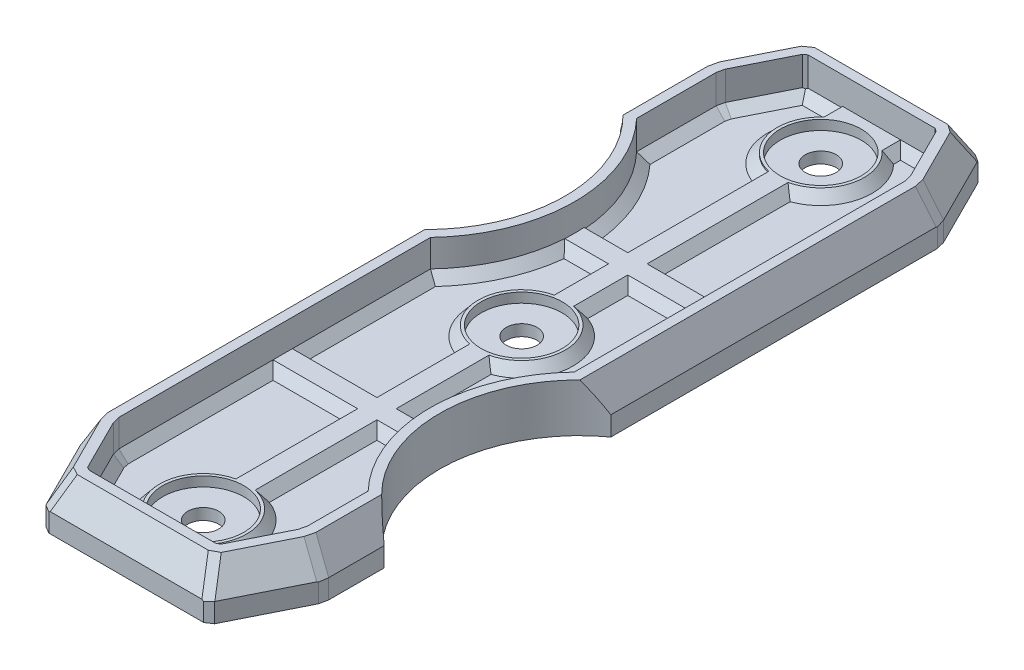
ISO-10303-21;
HEADER;
FILE_DESCRIPTION(('STEP AP214'),'2;1');
FILE_NAME('part.step','',(''),(''),'','','');
FILE_SCHEMA(('AUTOMOTIVE_DESIGN { 1 0 10303 214 1 1 1 1 }'));
ENDSEC;
DATA;
#1=APPLICATION_CONTEXT('core data for automotive mechanical design processes');
#2=APPLICATION_PROTOCOL_DEFINITION('international standard','automotive_design',2000,#1);
#3=PRODUCT_CONTEXT('',#1,'mechanical');
#4=PRODUCT('Part','Part','',(#3));
#5=PRODUCT_RELATED_PRODUCT_CATEGORY('part','',(#4));
#6=PRODUCT_DEFINITION_FORMATION('','',#4);
#7=PRODUCT_DEFINITION_CONTEXT('part definition',#1,'design');
#8=PRODUCT_DEFINITION('design','',#6,#7);
#9=PRODUCT_DEFINITION_SHAPE('','',#8);
#10=(LENGTH_UNIT() NAMED_UNIT(*) SI_UNIT(.MILLI.,.METRE.));
#11=(NAMED_UNIT(*) PLANE_ANGLE_UNIT() SI_UNIT($,.RADIAN.));
#12=(NAMED_UNIT(*) SI_UNIT($,.STERADIAN.) SOLID_ANGLE_UNIT());
#13=UNCERTAINTY_MEASURE_WITH_UNIT(LENGTH_MEASURE(1.E-05),#10,'distance_accuracy_value','');
#14=(GEOMETRIC_REPRESENTATION_CONTEXT(3) GLOBAL_UNCERTAINTY_ASSIGNED_CONTEXT((#13)) GLOBAL_UNIT_ASSIGNED_CONTEXT((#10,
#11,#12)) REPRESENTATION_CONTEXT('',''));
#15=CARTESIAN_POINT('',(0.,0.,0.));
#16=DIRECTION('',(0.,0.,1.));
#17=DIRECTION('',(1.,0.,0.));
#18=AXIS2_PLACEMENT_3D('',#15,#16,#17);
#19=CARTESIAN_POINT('',(5.96071878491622,1.17,-2.73205080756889));
#20=DIRECTION('',(0.,0.,1.));
#21=DIRECTION('',(1.,0.,0.));
#22=AXIS2_PLACEMENT_3D('',#19,#20,#21);
#23=PLANE('',#22);
#24=DIRECTION('',(0.,1.,0.));
#25=VECTOR('',#24,1.);
#26=CARTESIAN_POINT('',(19.0392812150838,1.17,-2.73205080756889));
#27=LINE('',#26,#25);
#28=CARTESIAN_POINT('',(19.0392812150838,2.16999999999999,-2.73205080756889));
#29=VERTEX_POINT('',#28);
#30=CARTESIAN_POINT('',(19.0392812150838,5.,-2.73205080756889));
#31=VERTEX_POINT('',#30);
#32=EDGE_CURVE('E960',#29,#31,#27,.T.);
#33=ORIENTED_EDGE('',*,*,#32,.F.);
#34=DIRECTION('',(-1.,0.,0.));
#35=VECTOR('',#34,1.);
#36=CARTESIAN_POINT('',(5.96071878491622,2.16999999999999,-2.73205080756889));
#37=LINE('',#36,#35);
#38=CARTESIAN_POINT('',(15.5,2.17,-2.73205080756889));
#39=VERTEX_POINT('',#38);
#40=EDGE_CURVE('E1420',#29,#39,#37,.T.);
#41=ORIENTED_EDGE('',*,*,#40,.T.);
#42=DIRECTION('',(1.,0.,0.));
#43=VECTOR('',#42,1.);
#44=CARTESIAN_POINT('',(0.,2.17,-2.73205080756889));
#45=LINE('',#44,#43);
#46=CARTESIAN_POINT('',(9.50000000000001,2.17,-2.73205080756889));
#47=VERTEX_POINT('',#46);
#48=EDGE_CURVE('E775',#47,#39,#45,.T.);
#49=ORIENTED_EDGE('',*,*,#48,.F.);
#50=DIRECTION('',(-1.,0.,0.));
#51=VECTOR('',#50,1.);
#52=CARTESIAN_POINT('',(5.96071878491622,2.17,-2.73205080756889));
#53=LINE('',#52,#51);
#54=CARTESIAN_POINT('',(5.96071878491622,2.17,-2.73205080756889));
#55=VERTEX_POINT('',#54);
#56=EDGE_CURVE('E1417',#47,#55,#53,.T.);
#57=ORIENTED_EDGE('',*,*,#56,.T.);
#58=DIRECTION('',(0.,1.,0.));
#59=VECTOR('',#58,1.);
#60=CARTESIAN_POINT('',(5.96071878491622,1.17,-2.73205080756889));
#61=LINE('',#60,#59);
#62=CARTESIAN_POINT('',(5.96071878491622,5.,-2.73205080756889));
#63=VERTEX_POINT('',#62);
#64=EDGE_CURVE('E963',#55,#63,#61,.T.);
#65=ORIENTED_EDGE('',*,*,#64,.T.);
#66=DIRECTION('',(1.,0.,0.));
#67=VECTOR('',#66,1.);
#68=CARTESIAN_POINT('',(5.96071878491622,5.,-2.73205080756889));
#69=LINE('',#68,#67);
#70=EDGE_CURVE('E870',#63,#31,#69,.T.);
#71=ORIENTED_EDGE('',*,*,#70,.T.);
#72=EDGE_LOOP('',(#33,#41,#49,#57,#65,#71));
#73=FACE_BOUND('',#72,.T.);
#74=ADVANCED_FACE('F43',(#73),#23,.F.);
#75=CARTESIAN_POINT('',(2.73205080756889,1.17,-41.3186595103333));
#76=DIRECTION('',(-1.,0.,0.));
#77=DIRECTION('',(0.,0.,1.));
#78=AXIS2_PLACEMENT_3D('',#75,#76,#77);
#79=PLANE('',#78);
#80=DIRECTION('',(0.,1.,0.));
#81=VECTOR('',#80,1.);
#82=CARTESIAN_POINT('',(2.73205080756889,1.17,-9.0341700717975));
#83=LINE('',#82,#81);
#84=CARTESIAN_POINT('',(2.73205080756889,2.17,-9.0341700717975));
#85=VERTEX_POINT('',#84);
#86=CARTESIAN_POINT('',(2.73205080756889,5.,-9.0341700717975));
#87=VERTEX_POINT('',#86);
#88=EDGE_CURVE('E972',#85,#87,#83,.T.);
#89=ORIENTED_EDGE('',*,*,#88,.F.);
#90=DIRECTION('',(0.,0.,-1.));
#91=VECTOR('',#90,1.);
#92=CARTESIAN_POINT('',(2.73205080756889,2.17,-41.3186595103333));
#93=LINE('',#92,#91);
#94=CARTESIAN_POINT('',(2.73205080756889,2.17,-25.));
#95=VERTEX_POINT('',#94);
#96=EDGE_CURVE('E1463',#85,#95,#93,.T.);
#97=ORIENTED_EDGE('',*,*,#96,.T.);
#98=DIRECTION('',(0.,0.,1.));
#99=VECTOR('',#98,1.);
#100=CARTESIAN_POINT('',(2.73205080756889,2.17,0.));
#101=LINE('',#100,#99);
#102=CARTESIAN_POINT('',(2.73205080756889,2.17,-27.));
#103=VERTEX_POINT('',#102);
#104=EDGE_CURVE('E756',#103,#95,#101,.T.);
#105=ORIENTED_EDGE('',*,*,#104,.F.);
#106=DIRECTION('',(0.,0.,-1.));
#107=VECTOR('',#106,1.);
#108=CARTESIAN_POINT('',(2.73205080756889,2.17,-41.3186595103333));
#109=LINE('',#108,#107);
#110=CARTESIAN_POINT('',(2.73205080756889,2.17,-41.3186595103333));
#111=VERTEX_POINT('',#110);
#112=EDGE_CURVE('E1460',#103,#111,#109,.T.);
#113=ORIENTED_EDGE('',*,*,#112,.T.);
#114=DIRECTION('',(0.,1.,0.));
#115=VECTOR('',#114,1.);
#116=CARTESIAN_POINT('',(2.73205080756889,1.17,-41.3186595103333));
#117=LINE('',#116,#115);
#118=CARTESIAN_POINT('',(2.73205080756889,5.,-41.3186595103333));
#119=VERTEX_POINT('',#118);
#120=EDGE_CURVE('E975',#111,#119,#117,.T.);
#121=ORIENTED_EDGE('',*,*,#120,.T.);
#122=DIRECTION('',(0.,0.,1.));
#123=VECTOR('',#122,1.);
#124=CARTESIAN_POINT('',(2.73205080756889,5.,-41.3186595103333));
#125=LINE('',#124,#123);
#126=EDGE_CURVE('E854',#119,#87,#125,.T.);
#127=ORIENTED_EDGE('',*,*,#126,.T.);
#128=EDGE_LOOP('',(#89,#97,#105,#113,#121,#127));
#129=FACE_BOUND('',#128,.T.);
#130=ADVANCED_FACE('F2121',(#129),#79,.F.);
#131=CARTESIAN_POINT('',(-8.5,1.17,-52.));
#132=DIRECTION('',(0.,1.,0.));
#133=DIRECTION('',(0.,0.,1.));
#134=AXIS2_PLACEMENT_3D('',#131,#132,#133);
#135=CYLINDRICAL_SURFACE('',#134,15.5);
#136=DIRECTION('',(0.,-1.,0.));
#137=VECTOR('',#136,1.);
#138=CARTESIAN_POINT('',(6.96770829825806,2.17,-53.));
#139=LINE('',#138,#137);
#140=CARTESIAN_POINT('',(6.96770829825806,2.17,-53.));
#141=VERTEX_POINT('',#140);
#142=CARTESIAN_POINT('',(6.96770829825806,2.00909963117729,-53.));
#143=VERTEX_POINT('',#142);
#144=EDGE_CURVE('E822',#141,#143,#139,.T.);
#145=ORIENTED_EDGE('',*,*,#144,.T.);
#146=CARTESIAN_POINT('',(-8.5,2.00909963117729,-52.));
#147=DIRECTION('',(0.,1.,0.));
#148=DIRECTION('',(0.,0.,1.));
#149=AXIS2_PLACEMENT_3D('',#146,#147,#148);
#150=CIRCLE('',#149,15.5);
#151=CARTESIAN_POINT('',(2.73205080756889,2.00909963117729,-62.6813404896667));
#152=VERTEX_POINT('',#151);
#153=EDGE_CURVE('E1553',#143,#152,#150,.T.);
#154=ORIENTED_EDGE('',*,*,#153,.T.);
#155=DIRECTION('',(0.,1.,0.));
#156=VECTOR('',#155,1.);
#157=CARTESIAN_POINT('',(2.73205080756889,1.17,-62.6813404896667));
#158=LINE('',#157,#156);
#159=CARTESIAN_POINT('',(2.73205080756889,5.,-62.6813404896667));
#160=VERTEX_POINT('',#159);
#161=EDGE_CURVE('E978',#152,#160,#158,.T.);
#162=ORIENTED_EDGE('',*,*,#161,.T.);
#163=CARTESIAN_POINT('',(-8.5,5.,-52.));
#164=DIRECTION('',(0.,-1.,0.));
#165=DIRECTION('',(0.,0.,1.));
#166=AXIS2_PLACEMENT_3D('',#163,#164,#165);
#167=CIRCLE('',#166,15.5);
#168=EDGE_CURVE('E850',#160,#119,#167,.T.);
#169=ORIENTED_EDGE('',*,*,#168,.T.);
#170=ORIENTED_EDGE('',*,*,#120,.F.);
#171=CARTESIAN_POINT('',(-8.5,2.17,-52.));
#172=DIRECTION('',(0.,1.,0.));
#173=DIRECTION('',(0.,0.,1.));
#174=AXIS2_PLACEMENT_3D('',#171,#172,#173);
#175=CIRCLE('',#174,15.5);
#176=CARTESIAN_POINT('',(6.96770829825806,2.17,-51.));
#177=VERTEX_POINT('',#176);
#178=EDGE_CURVE('E1550',#111,#177,#175,.T.);
#179=ORIENTED_EDGE('',*,*,#178,.T.);
#180=CARTESIAN_POINT('',(-8.5,2.17,-52.));
#181=DIRECTION('',(0.,1.,0.));
#182=DIRECTION('',(0.,0.,1.));
#183=AXIS2_PLACEMENT_3D('',#180,#181,#182);
#184=CIRCLE('',#183,15.5);
#185=EDGE_CURVE('E734',#141,#177,#184,.F.);
#186=ORIENTED_EDGE('',*,*,#185,.F.);
#187=EDGE_LOOP('',(#145,#154,#162,#169,#170,#179,#186));
#188=FACE_BOUND('',#187,.T.);
#189=ADVANCED_FACE('F2123',(#188),#135,.T.);
#190=CARTESIAN_POINT('',(-8.5,1.17,-52.));
#191=DIRECTION('',(0.,1.,0.));
#192=DIRECTION('',(0.,0.,1.));
#193=AXIS2_PLACEMENT_3D('',#190,#191,#192);
#194=PLANE('',#193);
#195=DIRECTION('',(1.,0.,0.));
#196=VECTOR('',#195,1.);
#197=CARTESIAN_POINT('',(-8.5,1.17,-54.));
#198=LINE('',#197,#196);
#199=CARTESIAN_POINT('',(7.87833935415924,1.17,-54.));
#200=VERTEX_POINT('',#199);
#201=CARTESIAN_POINT('',(10.5,1.17,-54.));
#202=VERTEX_POINT('',#201);
#203=EDGE_CURVE('E1540',#200,#202,#198,.T.);
#204=ORIENTED_EDGE('',*,*,#203,.T.);
#205=DIRECTION('',(0.,0.,-1.));
#206=VECTOR('',#205,1.);
#207=CARTESIAN_POINT('',(10.5,1.17,-52.));
#208=LINE('',#207,#206);
#209=CARTESIAN_POINT('',(10.5,1.17,-66.8765246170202));
#210=VERTEX_POINT('',#209);
#211=EDGE_CURVE('E1543',#202,#210,#208,.T.);
#212=ORIENTED_EDGE('',*,*,#211,.T.);
#213=CARTESIAN_POINT('',(12.5,1.17,-72.));
#214=DIRECTION('',(0.,1.,0.));
#215=DIRECTION('',(0.,0.,1.));
#216=AXIS2_PLACEMENT_3D('',#213,#214,#215);
#217=CIRCLE('',#216,5.5);
#218=CARTESIAN_POINT('',(8.5,1.17,-75.7749172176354));
#219=VERTEX_POINT('',#218);
#220=EDGE_CURVE('E1519',#210,#219,#217,.F.);
#221=ORIENTED_EDGE('',*,*,#220,.T.);
#222=DIRECTION('',(0.,0.,-1.));
#223=VECTOR('',#222,1.);
#224=CARTESIAN_POINT('',(8.50000000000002,1.17,-52.));
#225=LINE('',#224,#223);
#226=CARTESIAN_POINT('',(8.5,1.17,-76.2679491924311));
#227=VERTEX_POINT('',#226);
#228=EDGE_CURVE('E1522',#219,#227,#225,.T.);
#229=ORIENTED_EDGE('',*,*,#228,.T.);
#230=DIRECTION('',(-1.,0.,0.));
#231=VECTOR('',#230,1.);
#232=CARTESIAN_POINT('',(-8.5,1.17,-76.2679491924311));
#233=LINE('',#232,#231);
#234=CARTESIAN_POINT('',(6.30653424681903,1.17,-76.2679491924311));
#235=VERTEX_POINT('',#234);
#236=EDGE_CURVE('E1525',#227,#235,#233,.T.);
#237=ORIENTED_EDGE('',*,*,#236,.T.);
#238=DIRECTION('',(-0.447213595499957,0.,0.894427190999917));
#239=VECTOR('',#238,1.);
#240=CARTESIAN_POINT('',(-6.36195227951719,1.17,-50.9309761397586));
#241=LINE('',#240,#239);
#242=CARTESIAN_POINT('',(3.85502102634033,1.17,-71.3649227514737));
#243=VERTEX_POINT('',#242);
#244=EDGE_CURVE('E1528',#235,#243,#241,.T.);
#245=ORIENTED_EDGE('',*,*,#244,.T.);
#246=DIRECTION('',(-0.219407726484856,0.,0.97563325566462));
#247=VECTOR('',#246,1.);
#248=CARTESIAN_POINT('',(-0.885030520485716,1.17,-50.2874885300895));
#249=LINE('',#248,#247);
#250=CARTESIAN_POINT('',(3.73205080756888,1.17,-70.8181150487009));
#251=VERTEX_POINT('',#250);
#252=EDGE_CURVE('E1531',#243,#251,#249,.T.);
#253=ORIENTED_EDGE('',*,*,#252,.T.);
#254=DIRECTION('',(0.,0.,1.));
#255=VECTOR('',#254,1.);
#256=CARTESIAN_POINT('',(3.73205080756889,1.17,-52.));
#257=LINE('',#256,#255);
#258=CARTESIAN_POINT('',(3.73205080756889,1.17,-63.0737045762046));
#259=VERTEX_POINT('',#258);
#260=EDGE_CURVE('E1534',#251,#259,#257,.T.);
#261=ORIENTED_EDGE('',*,*,#260,.T.);
#262=CARTESIAN_POINT('',(-8.5,1.17,-52.));
#263=DIRECTION('',(0.,1.,0.));
#264=DIRECTION('',(0.,0.,1.));
#265=AXIS2_PLACEMENT_3D('',#262,#263,#264);
#266=CIRCLE('',#265,16.5);
#267=EDGE_CURVE('E1537',#259,#200,#266,.F.);
#268=ORIENTED_EDGE('',*,*,#267,.T.);
#269=EDGE_LOOP('',(#204,#212,#221,#229,#237,#245,#253,#261,#268));
#270=FACE_BOUND('',#269,.T.);
#271=ADVANCED_FACE('F2325',(#270),#194,.T.);
#272=CARTESIAN_POINT('',(12.5,1.17,-41.));
#273=DIRECTION('',(0.,1.,0.));
#274=DIRECTION('',(0.,0.,1.));
#275=AXIS2_PLACEMENT_3D('',#272,#273,#274);
#276=CIRCLE('',#275,5.33909963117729);
#277=CARTESIAN_POINT('',(10.6609003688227,1.17,-35.9876455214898));
#278=VERTEX_POINT('',#277);
#279=CARTESIAN_POINT('',(10.6609003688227,1.17,-46.0123544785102));
#280=VERTEX_POINT('',#279);
#281=EDGE_CURVE('E54',#278,#280,#276,.F.);
#282=ORIENTED_EDGE('',*,*,#281,.T.);
#283=DIRECTION('',(0.,0.,-1.));
#284=VECTOR('',#283,1.);
#285=CARTESIAN_POINT('',(10.6609003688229,1.17,-51.9999999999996));
#286=LINE('',#285,#284);
#287=CARTESIAN_POINT('',(10.6609003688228,1.17,-50.1609003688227));
#288=VERTEX_POINT('',#287);
#289=EDGE_CURVE('E11',#280,#288,#286,.T.);
#290=ORIENTED_EDGE('',*,*,#289,.T.);
#291=DIRECTION('',(-1.,0.,0.));
#292=VECTOR('',#291,1.);
#293=CARTESIAN_POINT('',(6.96770829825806,1.17,-50.1609003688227));
#294=LINE('',#293,#292);
#295=CARTESIAN_POINT('',(7.73526683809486,1.17,-50.1609003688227));
#296=VERTEX_POINT('',#295);
#297=EDGE_CURVE('E1599',#288,#296,#294,.T.);
#298=ORIENTED_EDGE('',*,*,#297,.T.);
#299=CARTESIAN_POINT('',(-8.5,1.17,-52.));
#300=DIRECTION('',(0.,1.,0.));
#301=DIRECTION('',(0.,0.,1.));
#302=AXIS2_PLACEMENT_3D('',#299,#300,#301);
#303=CIRCLE('',#302,16.3390996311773);
#304=CARTESIAN_POINT('',(3.57115043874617,1.17,-40.9884831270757));
#305=VERTEX_POINT('',#304);
#306=EDGE_CURVE('E1602',#296,#305,#303,.F.);
#307=ORIENTED_EDGE('',*,*,#306,.T.);
#308=DIRECTION('',(0.,0.,1.));
#309=VECTOR('',#308,1.);
#310=CARTESIAN_POINT('',(3.57115043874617,1.17,-52.));
#311=LINE('',#310,#309);
#312=CARTESIAN_POINT('',(3.57115043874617,1.17,-27.8390996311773));
#313=VERTEX_POINT('',#312);
#314=EDGE_CURVE('E1605',#305,#313,#311,.T.);
#315=ORIENTED_EDGE('',*,*,#314,.T.);
#316=DIRECTION('',(1.,0.,0.));
#317=VECTOR('',#316,1.);
#318=CARTESIAN_POINT('',(-8.5,1.17,-27.8390996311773));
#319=LINE('',#318,#317);
#320=CARTESIAN_POINT('',(10.6609003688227,1.17,-27.8390996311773));
#321=VERTEX_POINT('',#320);
#322=EDGE_CURVE('E1608',#313,#321,#319,.T.);
#323=ORIENTED_EDGE('',*,*,#322,.T.);
#324=DIRECTION('',(0.,0.,-1.));
#325=VECTOR('',#324,1.);
#326=CARTESIAN_POINT('',(10.6609003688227,1.17,-52.));
#327=LINE('',#326,#325);
#328=EDGE_CURVE('E65',#321,#278,#327,.T.);
#329=ORIENTED_EDGE('',*,*,#328,.T.);
#330=EDGE_LOOP('',(#282,#290,#298,#307,#315,#323,#329));
#331=FACE_BOUND('',#330,.T.);
#332=ADVANCED_FACE('F2980',(#331),#194,.T.);
#333=CARTESIAN_POINT('',(12.5,1.17,-8.));
#334=DIRECTION('',(0.,1.,0.));
#335=DIRECTION('',(0.,0.,1.));
#336=AXIS2_PLACEMENT_3D('',#333,#334,#335);
#337=CIRCLE('',#336,5.33909963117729);
#338=CARTESIAN_POINT('',(8.66090036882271,1.17,-4.28956890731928));
#339=VERTEX_POINT('',#338);
#340=CARTESIAN_POINT('',(10.660900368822,1.17,-13.0123544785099));
#341=VERTEX_POINT('',#340);
#342=EDGE_CURVE('E1441',#339,#341,#337,.F.);
#343=ORIENTED_EDGE('',*,*,#342,.T.);
#344=DIRECTION('',(0.,0.,-1.));
#345=VECTOR('',#344,1.);
#346=CARTESIAN_POINT('',(10.6609003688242,1.17,-51.9999999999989));
#347=LINE('',#346,#345);
#348=CARTESIAN_POINT('',(10.6609003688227,1.17,-24.1609003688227));
#349=VERTEX_POINT('',#348);
#350=EDGE_CURVE('E1444',#341,#349,#347,.T.);
#351=ORIENTED_EDGE('',*,*,#350,.T.);
#352=DIRECTION('',(-1.,0.,0.));
#353=VECTOR('',#352,1.);
#354=CARTESIAN_POINT('',(2.73205080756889,1.17,-24.1609003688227));
#355=LINE('',#354,#353);
#356=CARTESIAN_POINT('',(3.57115043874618,1.17,-24.1609003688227));
#357=VERTEX_POINT('',#356);
#358=EDGE_CURVE('E1423',#349,#357,#355,.T.);
#359=ORIENTED_EDGE('',*,*,#358,.T.);
#360=DIRECTION('',(0.,0.,1.));
#361=VECTOR('',#360,1.);
#362=CARTESIAN_POINT('',(3.57115043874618,1.17,-52.));
#363=LINE('',#362,#361);
#364=CARTESIAN_POINT('',(3.57115043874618,1.17,-9.13638699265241));
#365=VERTEX_POINT('',#364);
#366=EDGE_CURVE('E1426',#357,#365,#363,.T.);
#367=ORIENTED_EDGE('',*,*,#366,.T.);
#368=DIRECTION('',(0.240072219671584,0.,0.970755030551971));
#369=VECTOR('',#368,1.);
#370=CARTESIAN_POINT('',(-7.11398771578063,1.17,-52.3427672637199));
#371=LINE('',#370,#369);
#372=CARTESIAN_POINT('',(3.71469777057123,1.17,-8.55593959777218));
#373=VERTEX_POINT('',#372);
#374=EDGE_CURVE('E1429',#365,#373,#371,.T.);
#375=ORIENTED_EDGE('',*,*,#374,.T.);
#376=DIRECTION('',(0.447213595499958,0.,0.894427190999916));
#377=VECTOR('',#376,1.);
#378=CARTESIAN_POINT('',(-16.1058659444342,1.17,-48.1970670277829));
#379=LINE('',#378,#377);
#380=CARTESIAN_POINT('',(6.20709235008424,1.17,-3.57115043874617));
#381=VERTEX_POINT('',#380);
#382=EDGE_CURVE('E1432',#373,#381,#379,.T.);
#383=ORIENTED_EDGE('',*,*,#382,.T.);
#384=DIRECTION('',(1.,0.,0.));
#385=VECTOR('',#384,1.);
#386=CARTESIAN_POINT('',(-8.5,1.17,-3.57115043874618));
#387=LINE('',#386,#385);
#388=CARTESIAN_POINT('',(8.66090036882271,1.17,-3.57115043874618));
#389=VERTEX_POINT('',#388);
#390=EDGE_CURVE('E1435',#381,#389,#387,.T.);
#391=ORIENTED_EDGE('',*,*,#390,.T.);
#392=DIRECTION('',(0.,0.,-1.));
#393=VECTOR('',#392,1.);
#394=CARTESIAN_POINT('',(8.66090036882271,1.17,-52.));
#395=LINE('',#394,#393);
#396=EDGE_CURVE('E1438',#389,#339,#395,.T.);
#397=ORIENTED_EDGE('',*,*,#396,.T.);
#398=EDGE_LOOP('',(#343,#351,#359,#367,#375,#383,#391,#397));
#399=FACE_BOUND('',#398,.T.);
#400=ADVANCED_FACE('F2723',(#399),#194,.T.);
#401=DIRECTION('',(0.,0.,1.));
#402=VECTOR('',#401,1.);
#403=CARTESIAN_POINT('',(14.3390996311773,1.17,-12.3874821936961));
#404=LINE('',#403,#402);
#405=CARTESIAN_POINT('',(14.3390996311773,1.17,-24.1609003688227));
#406=VERTEX_POINT('',#405);
#407=CARTESIAN_POINT('',(14.3390996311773,1.17,-13.0123544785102));
#408=VERTEX_POINT('',#407);
#409=EDGE_CURVE('E1389',#406,#408,#404,.T.);
#410=ORIENTED_EDGE('',*,*,#409,.T.);
#411=CARTESIAN_POINT('',(12.5,1.17,-8.));
#412=DIRECTION('',(0.,1.,0.));
#413=DIRECTION('',(0.,0.,1.));
#414=AXIS2_PLACEMENT_3D('',#411,#412,#413);
#415=CIRCLE('',#414,5.33909963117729);
#416=CARTESIAN_POINT('',(16.3390996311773,1.17,-4.28956890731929));
#417=VERTEX_POINT('',#416);
#418=EDGE_CURVE('E1392',#408,#417,#415,.F.);
#419=ORIENTED_EDGE('',*,*,#418,.T.);
#420=DIRECTION('',(0.,0.,1.));
#421=VECTOR('',#420,1.);
#422=CARTESIAN_POINT('',(16.3390996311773,1.17,-2.73205080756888));
#423=LINE('',#422,#421);
#424=CARTESIAN_POINT('',(16.3390996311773,1.17,-3.57115043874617));
#425=VERTEX_POINT('',#424);
#426=EDGE_CURVE('E1368',#417,#425,#423,.T.);
#427=ORIENTED_EDGE('',*,*,#426,.T.);
#428=DIRECTION('',(1.,0.,0.));
#429=VECTOR('',#428,1.);
#430=CARTESIAN_POINT('',(-8.5,1.17,-3.57115043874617));
#431=LINE('',#430,#429);
#432=CARTESIAN_POINT('',(18.7929076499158,1.17,-3.57115043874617));
#433=VERTEX_POINT('',#432);
#434=EDGE_CURVE('E1371',#425,#433,#431,.T.);
#435=ORIENTED_EDGE('',*,*,#434,.T.);
#436=DIRECTION('',(0.447213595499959,0.,-0.894427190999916));
#437=VECTOR('',#436,1.);
#438=CARTESIAN_POINT('',(32.7058659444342,1.17,-31.3970670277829));
#439=LINE('',#438,#437);
#440=CARTESIAN_POINT('',(21.2853022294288,1.17,-8.55593959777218));
#441=VERTEX_POINT('',#440);
#442=EDGE_CURVE('E1374',#433,#441,#439,.T.);
#443=ORIENTED_EDGE('',*,*,#442,.T.);
#444=DIRECTION('',(0.240072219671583,0.,-0.970755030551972));
#445=VECTOR('',#444,1.);
#446=CARTESIAN_POINT('',(29.6933315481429,1.17,-42.5546120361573));
#447=LINE('',#446,#445);
#448=CARTESIAN_POINT('',(21.4288495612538,1.17,-9.13638699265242));
#449=VERTEX_POINT('',#448);
#450=EDGE_CURVE('E1377',#441,#449,#447,.T.);
#451=ORIENTED_EDGE('',*,*,#450,.T.);
#452=DIRECTION('',(0.,0.,-1.));
#453=VECTOR('',#452,1.);
#454=CARTESIAN_POINT('',(21.4288495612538,1.17,-52.));
#455=LINE('',#454,#453);
#456=CARTESIAN_POINT('',(21.4288495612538,1.17,-14.9884831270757));
#457=VERTEX_POINT('',#456);
#458=EDGE_CURVE('E1380',#449,#457,#455,.T.);
#459=ORIENTED_EDGE('',*,*,#458,.T.);
#460=CARTESIAN_POINT('',(33.5,1.17,-26.));
#461=DIRECTION('',(0.,1.,0.));
#462=DIRECTION('',(0.,0.,1.));
#463=AXIS2_PLACEMENT_3D('',#460,#461,#462);
#464=CIRCLE('',#463,16.3390996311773);
#465=CARTESIAN_POINT('',(17.2647331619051,1.17,-24.1609003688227));
#466=VERTEX_POINT('',#465);
#467=EDGE_CURVE('E1383',#457,#466,#464,.F.);
#468=ORIENTED_EDGE('',*,*,#467,.T.);
#469=DIRECTION('',(-1.,0.,0.));
#470=VECTOR('',#469,1.);
#471=CARTESIAN_POINT('',(13.5,1.17,-24.1609003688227));
#472=LINE('',#471,#470);
#473=EDGE_CURVE('E1386',#466,#406,#472,.T.);
#474=ORIENTED_EDGE('',*,*,#473,.T.);
#475=EDGE_LOOP('',(#410,#419,#427,#435,#443,#451,#459,#468,#474));
#476=FACE_BOUND('',#475,.T.);
#477=ADVANCED_FACE('F2717',(#476),#194,.T.);
#478=CARTESIAN_POINT('',(12.5,1.17,-41.));
#479=DIRECTION('',(0.,1.,0.));
#480=DIRECTION('',(0.,0.,1.));
#481=AXIS2_PLACEMENT_3D('',#478,#479,#480);
#482=CIRCLE('',#481,5.33909963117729);
#483=CARTESIAN_POINT('',(14.3390996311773,1.17,-46.0123544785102));
#484=VERTEX_POINT('',#483);
#485=CARTESIAN_POINT('',(14.3390996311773,1.17,-35.9876455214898));
#486=VERTEX_POINT('',#485);
#487=EDGE_CURVE('E1592',#484,#486,#482,.F.);
#488=ORIENTED_EDGE('',*,*,#487,.T.);
#489=DIRECTION('',(0.,0.,1.));
#490=VECTOR('',#489,1.);
#491=CARTESIAN_POINT('',(14.3390996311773,1.17,-27.));
#492=LINE('',#491,#490);
#493=CARTESIAN_POINT('',(14.3390996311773,1.17,-27.8390996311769));
#494=VERTEX_POINT('',#493);
#495=EDGE_CURVE('E1595',#486,#494,#492,.T.);
#496=ORIENTED_EDGE('',*,*,#495,.T.);
#497=DIRECTION('',(1.,0.,-1.07440821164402E-13));
#498=VECTOR('',#497,1.);
#499=CARTESIAN_POINT('',(18.0322917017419,1.17,-27.8390996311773));
#500=LINE('',#499,#498);
#501=CARTESIAN_POINT('',(17.2647331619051,1.17,-27.8390996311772));
#502=VERTEX_POINT('',#501);
#503=EDGE_CURVE('E1577',#494,#502,#500,.T.);
#504=ORIENTED_EDGE('',*,*,#503,.T.);
#505=CARTESIAN_POINT('',(33.5,1.17,-26.));
#506=DIRECTION('',(0.,1.,0.));
#507=DIRECTION('',(0.,0.,1.));
#508=AXIS2_PLACEMENT_3D('',#505,#506,#507);
#509=CIRCLE('',#508,16.3390996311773);
#510=CARTESIAN_POINT('',(21.4288495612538,1.17,-37.0115168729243));
#511=VERTEX_POINT('',#510);
#512=EDGE_CURVE('E1580',#502,#511,#509,.F.);
#513=ORIENTED_EDGE('',*,*,#512,.T.);
#514=DIRECTION('',(0.,0.,-1.));
#515=VECTOR('',#514,1.);
#516=CARTESIAN_POINT('',(21.4288495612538,1.17,-52.));
#517=LINE('',#516,#515);
#518=CARTESIAN_POINT('',(21.4288495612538,1.17,-50.1609003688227));
#519=VERTEX_POINT('',#518);
#520=EDGE_CURVE('E1583',#511,#519,#517,.T.);
#521=ORIENTED_EDGE('',*,*,#520,.T.);
#522=DIRECTION('',(-1.,0.,0.));
#523=VECTOR('',#522,1.);
#524=CARTESIAN_POINT('',(13.5,1.17,-50.1609003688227));
#525=LINE('',#524,#523);
#526=CARTESIAN_POINT('',(14.3390996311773,1.17,-50.1609003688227));
#527=VERTEX_POINT('',#526);
#528=EDGE_CURVE('E1586',#519,#527,#525,.T.);
#529=ORIENTED_EDGE('',*,*,#528,.T.);
#530=DIRECTION('',(0.,0.,1.));
#531=VECTOR('',#530,1.);
#532=CARTESIAN_POINT('',(14.3390996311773,1.17,-52.0000000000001));
#533=LINE('',#532,#531);
#534=EDGE_CURVE('E1589',#527,#484,#533,.T.);
#535=ORIENTED_EDGE('',*,*,#534,.T.);
#536=EDGE_LOOP('',(#488,#496,#504,#513,#521,#529,#535));
#537=FACE_BOUND('',#536,.T.);
#538=ADVANCED_FACE('F2243',(#537),#194,.T.);
#539=CARTESIAN_POINT('',(0.,5.,0.));
#540=DIRECTION('',(1.,0.,0.));
#541=DIRECTION('',(0.,0.,-1.));
#542=AXIS2_PLACEMENT_3D('',#539,#540,#541);
#543=PLANE('',#542);
#544=DIRECTION('',(0.,0.,1.));
#545=VECTOR('',#544,1.);
#546=CARTESIAN_POINT('',(0.,0.,0.));
#547=LINE('',#546,#545);
#548=CARTESIAN_POINT('',(0.,0.,-71.5));
#549=VERTEX_POINT('',#548);
#550=CARTESIAN_POINT('',(0.,0.,-63.7473401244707));
#551=VERTEX_POINT('',#550);
#552=EDGE_CURVE('E1029',#549,#551,#547,.T.);
#553=ORIENTED_EDGE('',*,*,#552,.T.);
#554=DIRECTION('',(0.,1.,0.));
#555=VECTOR('',#554,1.);
#556=CARTESIAN_POINT('',(0.,0.,-63.7473401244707));
#557=LINE('',#556,#555);
#558=CARTESIAN_POINT('',(0.,1.99999999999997,-63.7473401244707));
#559=VERTEX_POINT('',#558);
#560=EDGE_CURVE('E1008',#551,#559,#557,.T.);
#561=ORIENTED_EDGE('',*,*,#560,.T.);
#562=DIRECTION('',(0.,0.,-1.));
#563=VECTOR('',#562,1.);
#564=CARTESIAN_POINT('',(0.,1.99999999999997,0.));
#565=LINE('',#564,#563);
#566=CARTESIAN_POINT('',(0.,1.99999999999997,-71.4491106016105));
#567=VERTEX_POINT('',#566);
#568=EDGE_CURVE('E1086',#559,#567,#565,.T.);
#569=ORIENTED_EDGE('',*,*,#568,.T.);
#570=DIRECTION('',(0.,0.346909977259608,0.937898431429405));
#571=VECTOR('',#570,1.);
#572=CARTESIAN_POINT('',(0.,3.67359695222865,-66.9244094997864));
#573=LINE('',#572,#571);
#574=CARTESIAN_POINT('',(0.,1.98117702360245,-71.5));
#575=VERTEX_POINT('',#574);
#576=EDGE_CURVE('E1247',#567,#575,#573,.F.);
#577=ORIENTED_EDGE('',*,*,#576,.T.);
#578=DIRECTION('',(0.,-1.,0.));
#579=VECTOR('',#578,1.);
#580=CARTESIAN_POINT('',(0.,5.,-71.5));
#581=LINE('',#580,#579);
#582=EDGE_CURVE('E1244',#575,#549,#581,.T.);
#583=ORIENTED_EDGE('',*,*,#582,.T.);
#584=EDGE_LOOP('',(#553,#561,#569,#577,#583));
#585=FACE_BOUND('',#584,.T.);
#586=ADVANCED_FACE('F2433',(#585),#543,.F.);
#587=CARTESIAN_POINT('',(25.,5.,0.));
#588=DIRECTION('',(-1.,0.,0.));
#589=DIRECTION('',(0.,0.,1.));
#590=AXIS2_PLACEMENT_3D('',#587,#588,#589);
#591=PLANE('',#590);
#592=DIRECTION('',(0.,0.,-1.));
#593=VECTOR('',#592,1.);
#594=CARTESIAN_POINT('',(25.,0.,0.));
#595=LINE('',#594,#593);
#596=CARTESIAN_POINT('',(25.,0.,-8.49999999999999));
#597=VERTEX_POINT('',#596);
#598=CARTESIAN_POINT('',(25.,0.,-14.2526598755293));
#599=VERTEX_POINT('',#598);
#600=EDGE_CURVE('E1038',#597,#599,#595,.T.);
#601=ORIENTED_EDGE('',*,*,#600,.T.);
#602=DIRECTION('',(0.,1.,0.));
#603=VECTOR('',#602,1.);
#604=CARTESIAN_POINT('',(25.,0.,-14.2526598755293));
#605=LINE('',#604,#603);
#606=CARTESIAN_POINT('',(25.,1.99999999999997,-14.2526598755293));
#607=VERTEX_POINT('',#606);
#608=EDGE_CURVE('E1000',#599,#607,#605,.T.);
#609=ORIENTED_EDGE('',*,*,#608,.T.);
#610=DIRECTION('',(0.,0.,1.));
#611=VECTOR('',#610,1.);
#612=CARTESIAN_POINT('',(25.,1.99999999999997,0.));
#613=LINE('',#612,#611);
#614=CARTESIAN_POINT('',(25.,1.99999999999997,-8.50347095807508));
#615=VERTEX_POINT('',#614);
#616=EDGE_CURVE('E1102',#607,#615,#613,.T.);
#617=ORIENTED_EDGE('',*,*,#616,.T.);
#618=DIRECTION('',(0.,-0.375156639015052,0.926961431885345));
#619=VECTOR('',#618,1.);
#620=CARTESIAN_POINT('',(25.,2.5475617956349,-9.85642226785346));
#621=LINE('',#620,#619);
#622=CARTESIAN_POINT('',(25.,1.99859524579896,-8.49999999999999));
#623=VERTEX_POINT('',#622);
#624=EDGE_CURVE('E1288',#615,#623,#621,.T.);
#625=ORIENTED_EDGE('',*,*,#624,.T.);
#626=DIRECTION('',(0.,-1.,0.));
#627=VECTOR('',#626,1.);
#628=CARTESIAN_POINT('',(25.,0.,-8.49999999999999));
#629=LINE('',#628,#627);
#630=EDGE_CURVE('E1285',#623,#597,#629,.T.);
#631=ORIENTED_EDGE('',*,*,#630,.T.);
#632=EDGE_LOOP('',(#601,#609,#617,#625,#631));
#633=FACE_BOUND('',#632,.T.);
#634=ADVANCED_FACE('F2424',(#633),#591,.F.);
#635=CARTESIAN_POINT('',(1.73205080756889,5.,0.));
#636=DIRECTION('',(0.86602540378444,-0.499999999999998,0.));
#637=DIRECTION('',(0.,0.,1.));
#638=AXIS2_PLACEMENT_3D('',#635,#636,#637);
#639=PLANE('',#638);
#640=CARTESIAN_POINT('',(-8.5,-12.7224318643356,-52.));
#641=DIRECTION('',(0.86602540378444,-0.499999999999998,0.));
#642=DIRECTION('',(0.499999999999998,0.86602540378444,0.));
#643=AXIS2_PLACEMENT_3D('',#640,#641,#642);
#644=ELLIPSE('',#643,29.0000000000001,14.5);
#645=CARTESIAN_POINT('',(1.73205080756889,5.,-62.2740029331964));
#646=VERTEX_POINT('',#645);
#647=EDGE_CURVE('E1355',#646,#559,#644,.F.);
#648=ORIENTED_EDGE('',*,*,#647,.F.);
#649=DIRECTION('',(0.,0.,1.));
#650=VECTOR('',#649,1.);
#651=CARTESIAN_POINT('',(1.73205080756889,5.,0.));
#652=LINE('',#651,#650);
#653=CARTESIAN_POINT('',(1.73205080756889,5.,-71.0402288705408));
#654=VERTEX_POINT('',#653);
#655=EDGE_CURVE('E1067',#654,#646,#652,.T.);
#656=ORIENTED_EDGE('',*,*,#655,.F.);
#657=DIRECTION('',(0.496552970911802,0.860054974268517,0.117220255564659));
#658=VECTOR('',#657,1.);
#659=CARTESIAN_POINT('',(5.86702306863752,12.1619820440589,-70.0640943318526));
#660=LINE('',#659,#658);
#661=EDGE_CURVE('E1234',#654,#567,#660,.F.);
#662=ORIENTED_EDGE('',*,*,#661,.T.);
#663=ORIENTED_EDGE('',*,*,#568,.F.);
#664=EDGE_LOOP('',(#648,#656,#662,#663));
#665=FACE_BOUND('',#664,.T.);
#666=ADVANCED_FACE('F2473',(#665),#639,.F.);
#667=CARTESIAN_POINT('',(23.2679491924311,5.,0.));
#668=DIRECTION('',(-0.86602540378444,-0.499999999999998,0.));
#669=DIRECTION('',(0.,0.,-1.));
#670=AXIS2_PLACEMENT_3D('',#667,#668,#669);
#671=PLANE('',#670);
#672=CARTESIAN_POINT('',(33.5,-12.7224318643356,-26.));
#673=DIRECTION('',(-0.86602540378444,-0.499999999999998,0.));
#674=DIRECTION('',(-0.499999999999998,0.86602540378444,0.));
#675=AXIS2_PLACEMENT_3D('',#672,#673,#674);
#676=ELLIPSE('',#675,29.0000000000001,14.5);
#677=CARTESIAN_POINT('',(23.2679491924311,5.,-15.7259970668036));
#678=VERTEX_POINT('',#677);
#679=EDGE_CURVE('E1351',#678,#607,#676,.F.);
#680=ORIENTED_EDGE('',*,*,#679,.F.);
#681=DIRECTION('',(0.,0.,-1.));
#682=VECTOR('',#681,1.);
#683=CARTESIAN_POINT('',(23.2679491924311,5.,0.));
#684=LINE('',#683,#682);
#685=CARTESIAN_POINT('',(23.2679491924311,5.,-8.91235268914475));
#686=VERTEX_POINT('',#685);
#687=EDGE_CURVE('E1051',#686,#678,#684,.T.);
#688=ORIENTED_EDGE('',*,*,#687,.F.);
#689=DIRECTION('',(-0.496552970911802,0.860054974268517,-0.117220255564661));
#690=VECTOR('',#689,1.);
#691=CARTESIAN_POINT('',(23.7867021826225,4.10149346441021,-8.7898917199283));
#692=LINE('',#691,#690);
#693=EDGE_CURVE('E1304',#686,#615,#692,.F.);
#694=ORIENTED_EDGE('',*,*,#693,.T.);
#695=ORIENTED_EDGE('',*,*,#616,.F.);
#696=EDGE_LOOP('',(#680,#688,#694,#695));
#697=FACE_BOUND('',#696,.T.);
#698=ADVANCED_FACE('F2431',(#697),#671,.F.);
#699=CARTESIAN_POINT('',(0.,1.99999999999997,-8.50347095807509));
#700=VERTEX_POINT('',#699);
#701=CARTESIAN_POINT('',(0.,1.99999999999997,-40.2526598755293));
#702=VERTEX_POINT('',#701);
#703=EDGE_CURVE('E1087',#700,#702,#565,.T.);
#704=ORIENTED_EDGE('',*,*,#703,.T.);
#705=DIRECTION('',(0.,1.,0.));
#706=VECTOR('',#705,1.);
#707=CARTESIAN_POINT('',(0.,0.,-40.2526598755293));
#708=LINE('',#707,#706);
#709=CARTESIAN_POINT('',(0.,0.,-40.2526598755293));
#710=VERTEX_POINT('',#709);
#711=EDGE_CURVE('E1004',#702,#710,#708,.F.);
#712=ORIENTED_EDGE('',*,*,#711,.T.);
#713=CARTESIAN_POINT('',(0.,0.,-8.41337777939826));
#714=VERTEX_POINT('',#713);
#715=EDGE_CURVE('E1028',#710,#714,#547,.T.);
#716=ORIENTED_EDGE('',*,*,#715,.T.);
#717=DIRECTION('',(0.,1.,0.));
#718=VECTOR('',#717,1.);
#719=CARTESIAN_POINT('',(0.,1.99999999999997,-8.41337777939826));
#720=LINE('',#719,#718);
#721=CARTESIAN_POINT('',(0.,1.96353779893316,-8.41337777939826));
#722=VERTEX_POINT('',#721);
#723=EDGE_CURVE('E1238',#714,#722,#720,.T.);
#724=ORIENTED_EDGE('',*,*,#723,.T.);
#725=DIRECTION('',(0.,0.37515663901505,-0.926961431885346));
#726=VECTOR('',#725,1.);
#727=CARTESIAN_POINT('',(0.,2.33549930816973,-9.3324444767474));
#728=LINE('',#727,#726);
#729=EDGE_CURVE('E1241',#722,#700,#728,.T.);
#730=ORIENTED_EDGE('',*,*,#729,.T.);
#731=EDGE_LOOP('',(#704,#712,#716,#724,#730));
#732=FACE_BOUND('',#731,.T.);
#733=ADVANCED_FACE('F2427',(#732),#543,.F.);
#734=CARTESIAN_POINT('',(0.,5.,0.));
#735=DIRECTION('',(0.,0.,-1.));
#736=DIRECTION('',(-1.,0.,0.));
#737=AXIS2_PLACEMENT_3D('',#734,#735,#736);
#738=PLANE('',#737);
#739=DIRECTION('',(-1.,0.,0.));
#740=VECTOR('',#739,1.);
#741=CARTESIAN_POINT('',(0.,1.99999999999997,0.));
#742=LINE('',#741,#740);
#743=CARTESIAN_POINT('',(20.3608807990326,1.99999999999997,0.));
#744=VERTEX_POINT('',#743);
#745=CARTESIAN_POINT('',(4.63911920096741,1.99999999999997,0.));
#746=VERTEX_POINT('',#745);
#747=EDGE_CURVE('E1078',#744,#746,#742,.T.);
#748=ORIENTED_EDGE('',*,*,#747,.T.);
#749=DIRECTION('',(-0.820217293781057,-0.572052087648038,0.));
#750=VECTOR('',#749,1.);
#751=CARTESIAN_POINT('',(5.77763323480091,2.79404486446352,0.));
#752=LINE('',#751,#750);
#753=CARTESIAN_POINT('',(4.5,1.9029727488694,0.));
#754=VERTEX_POINT('',#753);
#755=EDGE_CURVE('E1127',#746,#754,#752,.T.);
#756=ORIENTED_EDGE('',*,*,#755,.T.);
#757=DIRECTION('',(0.,-1.,0.));
#758=VECTOR('',#757,1.);
#759=CARTESIAN_POINT('',(4.5,0.,0.));
#760=LINE('',#759,#758);
#761=CARTESIAN_POINT('',(4.5,0.,0.));
#762=VERTEX_POINT('',#761);
#763=EDGE_CURVE('E1124',#754,#762,#760,.T.);
#764=ORIENTED_EDGE('',*,*,#763,.T.);
#765=DIRECTION('',(1.,0.,0.));
#766=VECTOR('',#765,1.);
#767=CARTESIAN_POINT('',(0.,0.,0.));
#768=LINE('',#767,#766);
#769=CARTESIAN_POINT('',(20.5462711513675,0.,0.));
#770=VERTEX_POINT('',#769);
#771=EDGE_CURVE('E1033',#762,#770,#768,.T.);
#772=ORIENTED_EDGE('',*,*,#771,.T.);
#773=DIRECTION('',(0.,1.,0.));
#774=VECTOR('',#773,1.);
#775=CARTESIAN_POINT('',(20.5462711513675,1.99999999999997,0.));
#776=LINE('',#775,#774);
#777=CARTESIAN_POINT('',(20.5462711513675,1.87070141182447,0.));
#778=VERTEX_POINT('',#777);
#779=EDGE_CURVE('E1118',#770,#778,#776,.T.);
#780=ORIENTED_EDGE('',*,*,#779,.T.);
#781=DIRECTION('',(-0.820217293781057,0.572052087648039,0.));
#782=VECTOR('',#781,1.);
#783=CARTESIAN_POINT('',(14.8907473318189,5.81508813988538,0.));
#784=LINE('',#783,#782);
#785=EDGE_CURVE('E1121',#778,#744,#784,.T.);
#786=ORIENTED_EDGE('',*,*,#785,.T.);
#787=EDGE_LOOP('',(#748,#756,#764,#772,#780,#786));
#788=FACE_BOUND('',#787,.T.);
#789=ADVANCED_FACE('F2422',(#788),#738,.F.);
#790=CARTESIAN_POINT('',(25.,1.99999999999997,-71.4491106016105));
#791=VERTEX_POINT('',#790);
#792=CARTESIAN_POINT('',(25.,1.99999999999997,-37.7473401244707));
#793=VERTEX_POINT('',#792);
#794=EDGE_CURVE('E1103',#791,#793,#613,.T.);
#795=ORIENTED_EDGE('',*,*,#794,.T.);
#796=DIRECTION('',(0.,1.,0.));
#797=VECTOR('',#796,1.);
#798=CARTESIAN_POINT('',(25.,0.,-37.7473401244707));
#799=LINE('',#798,#797);
#800=CARTESIAN_POINT('',(25.,0.,-37.7473401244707));
#801=VERTEX_POINT('',#800);
#802=EDGE_CURVE('E987',#793,#801,#799,.F.);
#803=ORIENTED_EDGE('',*,*,#802,.T.);
#804=CARTESIAN_POINT('',(25.,0.,-71.5866222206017));
#805=VERTEX_POINT('',#804);
#806=EDGE_CURVE('E1037',#801,#805,#595,.T.);
#807=ORIENTED_EDGE('',*,*,#806,.T.);
#808=DIRECTION('',(0.,1.,0.));
#809=VECTOR('',#808,1.);
#810=CARTESIAN_POINT('',(25.,5.,-71.5866222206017));
#811=LINE('',#810,#809);
#812=CARTESIAN_POINT('',(25.,1.94913718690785,-71.5866222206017));
#813=VERTEX_POINT('',#812);
#814=EDGE_CURVE('E1294',#805,#813,#811,.T.);
#815=ORIENTED_EDGE('',*,*,#814,.T.);
#816=DIRECTION('',(0.,-0.346909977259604,-0.937898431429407));
#817=VECTOR('',#816,1.);
#818=CARTESIAN_POINT('',(25.,3.67359695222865,-66.9244094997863));
#819=LINE('',#818,#817);
#820=EDGE_CURVE('E1291',#813,#791,#819,.F.);
#821=ORIENTED_EDGE('',*,*,#820,.T.);
#822=EDGE_LOOP('',(#795,#803,#807,#815,#821));
#823=FACE_BOUND('',#822,.T.);
#824=ADVANCED_FACE('F2413',(#823),#591,.F.);
#825=CARTESIAN_POINT('',(0.,5.,0.));
#826=DIRECTION('',(0.,-1.,0.));
#827=DIRECTION('',(0.,0.,-1.));
#828=AXIS2_PLACEMENT_3D('',#825,#826,#827);
#829=PLANE('',#828);
#830=DIRECTION('',(0.,0.,1.));
#831=VECTOR('',#830,1.);
#832=CARTESIAN_POINT('',(2.73205080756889,5.,-70.9291719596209));
#833=LINE('',#832,#831);
#834=CARTESIAN_POINT('',(2.73205080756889,5.,-70.9291719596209));
#835=VERTEX_POINT('',#834);
#836=EDGE_CURVE('E846',#835,#160,#833,.T.);
#837=ORIENTED_EDGE('',*,*,#836,.F.);
#838=DIRECTION('',(-0.219407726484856,0.,0.97563325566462));
#839=VECTOR('',#838,1.);
#840=CARTESIAN_POINT('',(2.9061154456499,5.,-71.7031795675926));
#841=LINE('',#840,#839);
#842=CARTESIAN_POINT('',(2.9061154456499,5.,-71.7031795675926));
#843=VERTEX_POINT('',#842);
#844=EDGE_CURVE('E842',#843,#835,#841,.T.);
#845=ORIENTED_EDGE('',*,*,#844,.F.);
#846=DIRECTION('',(-0.447213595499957,0.,0.894427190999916));
#847=VECTOR('',#846,1.);
#848=CARTESIAN_POINT('',(5.56676043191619,5.,-77.0244695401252));
#849=LINE('',#848,#847);
#850=CARTESIAN_POINT('',(5.56676043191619,5.,-77.0244695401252));
#851=VERTEX_POINT('',#850);
#852=EDGE_CURVE('E918',#851,#843,#849,.T.);
#853=ORIENTED_EDGE('',*,*,#852,.F.);
#854=DIRECTION('',(-0.816739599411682,0.,0.577006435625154));
#855=VECTOR('',#854,1.);
#856=CARTESIAN_POINT('',(5.91140038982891,5.,-77.2679491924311));
#857=LINE('',#856,#855);
#858=CARTESIAN_POINT('',(5.91140038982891,5.,-77.2679491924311));
#859=VERTEX_POINT('',#858);
#860=EDGE_CURVE('E914',#859,#851,#857,.T.);
#861=ORIENTED_EDGE('',*,*,#860,.F.);
#862=DIRECTION('',(-1.,0.,0.));
#863=VECTOR('',#862,1.);
#864=CARTESIAN_POINT('',(19.0885996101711,5.,-77.2679491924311));
#865=LINE('',#864,#863);
#866=CARTESIAN_POINT('',(19.0885996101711,5.,-77.2679491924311));
#867=VERTEX_POINT('',#866);
#868=EDGE_CURVE('E910',#867,#859,#865,.T.);
#869=ORIENTED_EDGE('',*,*,#868,.F.);
#870=DIRECTION('',(-0.816739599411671,0.,-0.57700643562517));
#871=VECTOR('',#870,1.);
#872=CARTESIAN_POINT('',(19.4332395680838,5.,-77.0244695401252));
#873=LINE('',#872,#871);
#874=CARTESIAN_POINT('',(19.4332395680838,5.,-77.0244695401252));
#875=VERTEX_POINT('',#874);
#876=EDGE_CURVE('E906',#875,#867,#873,.T.);
#877=ORIENTED_EDGE('',*,*,#876,.F.);
#878=DIRECTION('',(-0.447213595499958,0.,-0.894427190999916));
#879=VECTOR('',#878,1.);
#880=CARTESIAN_POINT('',(22.0938845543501,5.,-71.7031795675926));
#881=LINE('',#880,#879);
#882=CARTESIAN_POINT('',(22.0938845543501,5.,-71.7031795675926));
#883=VERTEX_POINT('',#882);
#884=EDGE_CURVE('E902',#883,#875,#881,.T.);
#885=ORIENTED_EDGE('',*,*,#884,.F.);
#886=DIRECTION('',(-0.219407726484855,0.,-0.975633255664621));
#887=VECTOR('',#886,1.);
#888=CARTESIAN_POINT('',(22.2679491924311,5.,-70.9291719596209));
#889=LINE('',#888,#887);
#890=CARTESIAN_POINT('',(22.2679491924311,5.,-70.9291719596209));
#891=VERTEX_POINT('',#890);
#892=EDGE_CURVE('E898',#891,#883,#889,.T.);
#893=ORIENTED_EDGE('',*,*,#892,.F.);
#894=DIRECTION('',(0.,0.,-1.));
#895=VECTOR('',#894,1.);
#896=CARTESIAN_POINT('',(22.2679491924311,5.,-36.6813404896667));
#897=LINE('',#896,#895);
#898=CARTESIAN_POINT('',(22.2679491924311,5.,-36.6813404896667));
#899=VERTEX_POINT('',#898);
#900=EDGE_CURVE('E894',#899,#891,#897,.T.);
#901=ORIENTED_EDGE('',*,*,#900,.F.);
#902=CARTESIAN_POINT('',(33.5,5.,-26.));
#903=DIRECTION('',(0.,-1.,0.));
#904=DIRECTION('',(0.,0.,1.));
#905=AXIS2_PLACEMENT_3D('',#902,#903,#904);
#906=CIRCLE('',#905,15.5);
#907=CARTESIAN_POINT('',(22.2679491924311,5.,-15.3186595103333));
#908=VERTEX_POINT('',#907);
#909=EDGE_CURVE('E890',#908,#899,#906,.T.);
#910=ORIENTED_EDGE('',*,*,#909,.F.);
#911=DIRECTION('',(0.,0.,-1.));
#912=VECTOR('',#911,1.);
#913=CARTESIAN_POINT('',(22.2679491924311,5.,-9.03417007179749));
#914=LINE('',#913,#912);
#915=CARTESIAN_POINT('',(22.2679491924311,5.,-9.03417007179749));
#916=VERTEX_POINT('',#915);
#917=EDGE_CURVE('E886',#916,#908,#914,.T.);
#918=ORIENTED_EDGE('',*,*,#917,.F.);
#919=DIRECTION('',(0.240072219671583,0.,-0.970755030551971));
#920=VECTOR('',#919,1.);
#921=CARTESIAN_POINT('',(22.077490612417,5.,-8.26403254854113));
#922=LINE('',#921,#920);
#923=CARTESIAN_POINT('',(22.077490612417,5.,-8.26403254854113));
#924=VERTEX_POINT('',#923);
#925=EDGE_CURVE('E882',#924,#916,#922,.T.);
#926=ORIENTED_EDGE('',*,*,#925,.F.);
#927=DIRECTION('',(0.447213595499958,0.,-0.894427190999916));
#928=VECTOR('',#927,1.);
#929=CARTESIAN_POINT('',(19.4111837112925,5.,-2.93141874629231));
#930=LINE('',#929,#928);
#931=CARTESIAN_POINT('',(19.4111837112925,5.,-2.93141874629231));
#932=VERTEX_POINT('',#931);
#933=EDGE_CURVE('E878',#932,#924,#930,.T.);
#934=ORIENTED_EDGE('',*,*,#933,.F.);
#935=DIRECTION('',(0.881347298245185,0.,-0.472468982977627));
#936=VECTOR('',#935,1.);
#937=CARTESIAN_POINT('',(19.0392812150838,5.,-2.73205080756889));
#938=LINE('',#937,#936);
#939=EDGE_CURVE('E874',#31,#932,#938,.T.);
#940=ORIENTED_EDGE('',*,*,#939,.F.);
#941=ORIENTED_EDGE('',*,*,#70,.F.);
#942=DIRECTION('',(0.881347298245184,0.,0.472468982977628));
#943=VECTOR('',#942,1.);
#944=CARTESIAN_POINT('',(5.58881628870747,5.,-2.9314187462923));
#945=LINE('',#944,#943);
#946=CARTESIAN_POINT('',(5.58881628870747,5.,-2.9314187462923));
#947=VERTEX_POINT('',#946);
#948=EDGE_CURVE('E866',#947,#63,#945,.T.);
#949=ORIENTED_EDGE('',*,*,#948,.F.);
#950=DIRECTION('',(0.447213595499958,0.,0.894427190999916));
#951=VECTOR('',#950,1.);
#952=CARTESIAN_POINT('',(2.92250938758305,5.,-8.26403254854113));
#953=LINE('',#952,#951);
#954=CARTESIAN_POINT('',(2.92250938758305,5.,-8.26403254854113));
#955=VERTEX_POINT('',#954);
#956=EDGE_CURVE('E862',#955,#947,#953,.T.);
#957=ORIENTED_EDGE('',*,*,#956,.F.);
#958=DIRECTION('',(0.240072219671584,0.,0.970755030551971));
#959=VECTOR('',#958,1.);
#960=CARTESIAN_POINT('',(2.73205080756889,5.,-9.0341700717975));
#961=LINE('',#960,#959);
#962=EDGE_CURVE('E858',#87,#955,#961,.T.);
#963=ORIENTED_EDGE('',*,*,#962,.F.);
#964=ORIENTED_EDGE('',*,*,#126,.F.);
#965=ORIENTED_EDGE('',*,*,#168,.F.);
#966=EDGE_LOOP('',(#837,#845,#853,#861,#869,#877,#885,#893,#901,#910,#918,#926,#934,#940,#941,
#949,#957,#963,#964,#965));
#967=FACE_BOUND('',#966,.T.);
#968=ORIENTED_EDGE('',*,*,#655,.T.);
#969=CARTESIAN_POINT('',(-8.5,5.,-52.));
#970=DIRECTION('',(0.,1.,0.));
#971=DIRECTION('',(0.,0.,1.));
#972=AXIS2_PLACEMENT_3D('',#969,#970,#971);
#973=CIRCLE('',#972,14.5);
#974=CARTESIAN_POINT('',(1.73205080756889,5.,-41.7259970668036));
#975=VERTEX_POINT('',#974);
#976=EDGE_CURVE('E988',#975,#646,#973,.T.);
#977=ORIENTED_EDGE('',*,*,#976,.F.);
#978=CARTESIAN_POINT('',(1.73205080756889,5.,-8.91235268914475));
#979=VERTEX_POINT('',#978);
#980=EDGE_CURVE('E1066',#975,#979,#652,.T.);
#981=ORIENTED_EDGE('',*,*,#980,.T.);
#982=DIRECTION('',(0.240072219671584,0.,0.970755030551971));
#983=VECTOR('',#982,1.);
#984=CARTESIAN_POINT('',(1.9793604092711,5.,-7.9123326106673));
#985=LINE('',#984,#983);
#986=CARTESIAN_POINT('',(1.9784160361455,5.,-7.91615127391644));
#987=VERTEX_POINT('',#986);
#988=EDGE_CURVE('E1259',#979,#987,#985,.T.);
#989=ORIENTED_EDGE('',*,*,#988,.T.);
#990=DIRECTION('',(0.447213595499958,0.,0.894427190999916));
#991=VECTOR('',#990,1.);
#992=CARTESIAN_POINT('',(5.54919333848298,5.,-0.774596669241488));
#993=LINE('',#992,#991);
#994=CARTESIAN_POINT('',(4.83642658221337,5.,-2.2001301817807));
#995=VERTEX_POINT('',#994);
#996=EDGE_CURVE('E1071',#987,#995,#993,.T.);
#997=ORIENTED_EDGE('',*,*,#996,.T.);
#998=DIRECTION('',(0.881347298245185,0.,0.472468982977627));
#999=VECTOR('',#998,1.);
#1000=CARTESIAN_POINT('',(5.65831889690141,5.,-1.75953357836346));
#1001=LINE('',#1000,#999);
#1002=CARTESIAN_POINT('',(5.70958547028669,5.,-1.73205080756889));
#1003=VERTEX_POINT('',#1002);
#1004=EDGE_CURVE('E1149',#995,#1003,#1001,.T.);
#1005=ORIENTED_EDGE('',*,*,#1004,.T.);
#1006=DIRECTION('',(1.,0.,0.));
#1007=VECTOR('',#1006,1.);
#1008=CARTESIAN_POINT('',(0.,5.,-1.73205080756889));
#1009=LINE('',#1008,#1007);
#1010=CARTESIAN_POINT('',(19.2904145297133,5.,-1.73205080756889));
#1011=VERTEX_POINT('',#1010);
#1012=EDGE_CURVE('E1074',#1003,#1011,#1009,.T.);
#1013=ORIENTED_EDGE('',*,*,#1012,.T.);
#1014=DIRECTION('',(0.881347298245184,0.,-0.472468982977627));
#1015=VECTOR('',#1014,1.);
#1016=CARTESIAN_POINT('',(19.1172052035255,5.,-1.63919747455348));
#1017=LINE('',#1016,#1015);
#1018=CARTESIAN_POINT('',(20.1635734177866,5.,-2.20013018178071));
#1019=VERTEX_POINT('',#1018);
#1020=EDGE_CURVE('E1146',#1011,#1019,#1017,.T.);
#1021=ORIENTED_EDGE('',*,*,#1020,.T.);
#1022=DIRECTION('',(0.447213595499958,0.,-0.894427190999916));
#1023=VECTOR('',#1022,1.);
#1024=CARTESIAN_POINT('',(23.450806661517,5.,-8.77459666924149));
#1025=LINE('',#1024,#1023);
#1026=CARTESIAN_POINT('',(23.0215839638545,5.,-7.91615127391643));
#1027=VERTEX_POINT('',#1026);
#1028=EDGE_CURVE('E1046',#1019,#1027,#1025,.T.);
#1029=ORIENTED_EDGE('',*,*,#1028,.T.);
#1030=DIRECTION('',(0.240072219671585,0.,-0.970755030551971));
#1031=VECTOR('',#1030,1.);
#1032=CARTESIAN_POINT('',(23.0189354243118,5.,-7.90544165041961));
#1033=LINE('',#1032,#1031);
#1034=EDGE_CURVE('E1262',#1027,#686,#1033,.T.);
#1035=ORIENTED_EDGE('',*,*,#1034,.T.);
#1036=ORIENTED_EDGE('',*,*,#687,.T.);
#1037=CARTESIAN_POINT('',(33.5,5.,-26.));
#1038=DIRECTION('',(0.,1.,0.));
#1039=DIRECTION('',(0.,0.,1.));
#1040=AXIS2_PLACEMENT_3D('',#1037,#1038,#1039);
#1041=CIRCLE('',#1040,14.5);
#1042=CARTESIAN_POINT('',(23.2679491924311,5.,-36.2740029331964));
#1043=VERTEX_POINT('',#1042);
#1044=EDGE_CURVE('E926',#1043,#678,#1041,.T.);
#1045=ORIENTED_EDGE('',*,*,#1044,.F.);
#1046=CARTESIAN_POINT('',(23.2679491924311,5.,-71.0402288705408));
#1047=VERTEX_POINT('',#1046);
#1048=EDGE_CURVE('E1050',#1043,#1047,#684,.T.);
#1049=ORIENTED_EDGE('',*,*,#1048,.T.);
#1050=DIRECTION('',(0.219407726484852,0.,0.975633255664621));
#1051=VECTOR('',#1050,1.);
#1052=CARTESIAN_POINT('',(23.2778454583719,5.,-70.9962234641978));
#1053=LINE('',#1052,#1051);
#1054=CARTESIAN_POINT('',(23.0427901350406,5.,-72.0414363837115));
#1055=VERTEX_POINT('',#1054);
#1056=EDGE_CURVE('E1265',#1047,#1055,#1053,.F.);
#1057=ORIENTED_EDGE('',*,*,#1056,.T.);
#1058=DIRECTION('',(-0.447213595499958,0.,-0.894427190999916));
#1059=VECTOR('',#1058,1.);
#1060=CARTESIAN_POINT('',(47.250806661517,5.,-23.6254033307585));
#1061=LINE('',#1060,#1059);
#1062=CARTESIAN_POINT('',(20.2153565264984,5.,-77.6963036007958));
#1063=VERTEX_POINT('',#1062);
#1064=EDGE_CURVE('E1055',#1055,#1063,#1061,.T.);
#1065=ORIENTED_EDGE('',*,*,#1064,.T.);
#1066=DIRECTION('',(0.816739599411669,0.,0.577006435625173));
#1067=VECTOR('',#1066,1.);
#1068=CARTESIAN_POINT('',(20.625099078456,5.,-77.4068305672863));
#1069=LINE('',#1068,#1067);
#1070=CARTESIAN_POINT('',(19.4062050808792,5.,-78.2679491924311));
#1071=VERTEX_POINT('',#1070);
#1072=EDGE_CURVE('E1143',#1063,#1071,#1069,.F.);
#1073=ORIENTED_EDGE('',*,*,#1072,.T.);
#1074=DIRECTION('',(-1.,0.,0.));
#1075=VECTOR('',#1074,1.);
#1076=CARTESIAN_POINT('',(0.,5.,-78.2679491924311));
#1077=LINE('',#1076,#1075);
#1078=CARTESIAN_POINT('',(5.59379491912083,5.,-78.2679491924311));
#1079=VERTEX_POINT('',#1078);
#1080=EDGE_CURVE('E1058',#1071,#1079,#1077,.T.);
#1081=ORIENTED_EDGE('',*,*,#1080,.T.);
#1082=DIRECTION('',(0.816739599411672,0.,-0.577006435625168));
#1083=VECTOR('',#1082,1.);
#1084=CARTESIAN_POINT('',(4.28187130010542,5.,-77.3411074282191));
#1085=LINE('',#1084,#1083);
#1086=CARTESIAN_POINT('',(4.78464347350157,5.,-77.6963036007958));
#1087=VERTEX_POINT('',#1086);
#1088=EDGE_CURVE('E1140',#1079,#1087,#1085,.F.);
#1089=ORIENTED_EDGE('',*,*,#1088,.T.);
#1090=DIRECTION('',(-0.447213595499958,0.,0.894427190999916));
#1091=VECTOR('',#1090,1.);
#1092=CARTESIAN_POINT('',(-27.2508066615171,5.,-13.6254033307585));
#1093=LINE('',#1092,#1091);
#1094=CARTESIAN_POINT('',(1.95720986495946,5.,-72.0414363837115));
#1095=VERTEX_POINT('',#1094);
#1096=EDGE_CURVE('E1062',#1087,#1095,#1093,.T.);
#1097=ORIENTED_EDGE('',*,*,#1096,.T.);
#1098=DIRECTION('',(0.219407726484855,0.,-0.975633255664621));
#1099=VECTOR('',#1098,1.);
#1100=CARTESIAN_POINT('',(1.72215454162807,5.,-70.9962234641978));
#1101=LINE('',#1100,#1099);
#1102=EDGE_CURVE('E1268',#1095,#654,#1101,.F.);
#1103=ORIENTED_EDGE('',*,*,#1102,.T.);
#1104=EDGE_LOOP('',(#968,#977,#981,#989,#997,#1005,#1013,#1021,#1029,#1035,#1036,#1045,#1049,
#1057,#1065,#1073,#1081,#1089,#1097,#1103));
#1105=FACE_BOUND('',#1104,.T.);
#1106=ADVANCED_FACE('F2130',(#967,#1105),#829,.F.);
#1107=CARTESIAN_POINT('',(0.,0.,0.));
#1108=DIRECTION('',(0.,-1.,0.));
#1109=DIRECTION('',(0.,0.,-1.));
#1110=AXIS2_PLACEMENT_3D('',#1107,#1108,#1109);
#1111=PLANE('',#1110);
#1112=CARTESIAN_POINT('',(12.5,0.,-72.));
#1113=DIRECTION('',(0.,-1.,0.));
#1114=DIRECTION('',(0.,0.,-1.));
#1115=AXIS2_PLACEMENT_3D('',#1112,#1113,#1114);
#1116=CIRCLE('',#1115,1.6);
#1117=CARTESIAN_POINT('',(12.5,0.,-73.6));
#1118=VERTEX_POINT('',#1117);
#1119=EDGE_CURVE('E690',#1118,#1118,#1116,.T.);
#1120=ORIENTED_EDGE('',*,*,#1119,.F.);
#1121=EDGE_LOOP('',(#1120));
#1122=FACE_BOUND('',#1121,.T.);
#1123=CARTESIAN_POINT('',(12.5,0.,-8.));
#1124=DIRECTION('',(0.,-1.,0.));
#1125=DIRECTION('',(0.,0.,-1.));
#1126=AXIS2_PLACEMENT_3D('',#1123,#1124,#1125);
#1127=CIRCLE('',#1126,1.6);
#1128=CARTESIAN_POINT('',(12.5,0.,-9.6));
#1129=VERTEX_POINT('',#1128);
#1130=EDGE_CURVE('E1360',#1129,#1129,#1127,.T.);
#1131=ORIENTED_EDGE('',*,*,#1130,.F.);
#1132=EDGE_LOOP('',(#1131));
#1133=FACE_BOUND('',#1132,.T.);
#1134=CARTESIAN_POINT('',(12.5,0.,-41.));
#1135=DIRECTION('',(0.,-1.,0.));
#1136=DIRECTION('',(0.,0.,-1.));
#1137=AXIS2_PLACEMENT_3D('',#1134,#1135,#1136);
#1138=CIRCLE('',#1137,1.6);
#1139=CARTESIAN_POINT('',(12.5,0.,-42.6));
#1140=VERTEX_POINT('',#1139);
#1141=EDGE_CURVE('E1356',#1140,#1140,#1138,.T.);
#1142=ORIENTED_EDGE('',*,*,#1141,.F.);
#1143=EDGE_LOOP('',(#1142));
#1144=FACE_BOUND('',#1143,.T.);
#1145=CARTESIAN_POINT('',(-8.5,0.,-52.));
#1146=DIRECTION('',(0.,1.,0.));
#1147=DIRECTION('',(0.,0.,1.));
#1148=AXIS2_PLACEMENT_3D('',#1145,#1146,#1147);
#1149=CIRCLE('',#1148,14.5);
#1150=EDGE_CURVE('E983',#710,#551,#1149,.T.);
#1151=ORIENTED_EDGE('',*,*,#1150,.T.);
#1152=ORIENTED_EDGE('',*,*,#552,.F.);
#1153=DIRECTION('',(-0.207911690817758,0.,0.978147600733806));
#1154=VECTOR('',#1153,1.);
#1155=CARTESIAN_POINT('',(-14.5408349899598,0.,-3.09074988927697));
#1156=LINE('',#1155,#1154);
#1157=CARTESIAN_POINT('',(0.184868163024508,0.,-72.369736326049));
#1158=VERTEX_POINT('',#1157);
#1159=EDGE_CURVE('E1282',#549,#1158,#1156,.F.);
#1160=ORIENTED_EDGE('',*,*,#1159,.T.);
#1161=DIRECTION('',(0.447213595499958,0.,-0.894427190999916));
#1162=VECTOR('',#1161,1.);
#1163=CARTESIAN_POINT('',(-28.8,0.,-14.4));
#1164=LINE('',#1163,#1162);
#1165=CARTESIAN_POINT('',(3.77639320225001,0.,-79.5527864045));
#1166=VERTEX_POINT('',#1165);
#1167=EDGE_CURVE('E1017',#1158,#1166,#1164,.T.);
#1168=ORIENTED_EDGE('',*,*,#1167,.T.);
#1169=DIRECTION('',(-0.834511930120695,0.,0.550989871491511));
#1170=VECTOR('',#1169,1.);
#1171=CARTESIAN_POINT('',(-35.432502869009,0.,-53.66495445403));
#1172=LINE('',#1171,#1170);
#1173=CARTESIAN_POINT('',(4.45372884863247,0.,-80.));
#1174=VERTEX_POINT('',#1173);
#1175=EDGE_CURVE('E1152',#1166,#1174,#1172,.F.);
#1176=ORIENTED_EDGE('',*,*,#1175,.T.);
#1177=DIRECTION('',(-1.,0.,0.));
#1178=VECTOR('',#1177,1.);
#1179=CARTESIAN_POINT('',(0.,0.,-80.));
#1180=LINE('',#1179,#1178);
#1181=CARTESIAN_POINT('',(20.5,0.,-80.));
#1182=VERTEX_POINT('',#1181);
#1183=EDGE_CURVE('E1042',#1182,#1174,#1180,.T.);
#1184=ORIENTED_EDGE('',*,*,#1183,.F.);
#1185=DIRECTION('',(-0.866025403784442,0.,-0.499999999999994));
#1186=VECTOR('',#1185,1.);
#1187=CARTESIAN_POINT('',(39.7660161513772,0.,-68.8767603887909));
#1188=LINE('',#1187,#1186);
#1189=CARTESIAN_POINT('',(21.202913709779,0.,-79.5941725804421));
#1190=VERTEX_POINT('',#1189);
#1191=EDGE_CURVE('E1155',#1182,#1190,#1188,.F.);
#1192=ORIENTED_EDGE('',*,*,#1191,.T.);
#1193=DIRECTION('',(0.447213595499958,0.,0.894427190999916));
#1194=VECTOR('',#1193,1.);
#1195=CARTESIAN_POINT('',(48.8,0.,-24.4));
#1196=LINE('',#1195,#1194);
#1197=CARTESIAN_POINT('',(24.77639320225,0.,-72.4472135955));
#1198=VERTEX_POINT('',#1197);
#1199=EDGE_CURVE('E1013',#1190,#1198,#1196,.T.);
#1200=ORIENTED_EDGE('',*,*,#1199,.T.);
#1201=DIRECTION('',(-0.251479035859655,0.,-0.96786274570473));
#1202=VECTOR('',#1201,1.);
#1203=CARTESIAN_POINT('',(40.8429400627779,0.,-10.6121898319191));
#1204=LINE('',#1203,#1202);
#1205=EDGE_CURVE('E1278',#1198,#805,#1204,.F.);
#1206=ORIENTED_EDGE('',*,*,#1205,.T.);
#1207=ORIENTED_EDGE('',*,*,#806,.F.);
#1208=CARTESIAN_POINT('',(33.5,0.,-26.));
#1209=DIRECTION('',(0.,1.,0.));
#1210=DIRECTION('',(0.,0.,1.));
#1211=AXIS2_PLACEMENT_3D('',#1208,#1209,#1210);
#1212=CIRCLE('',#1211,14.5);
#1213=EDGE_CURVE('E991',#801,#599,#1212,.T.);
#1214=ORIENTED_EDGE('',*,*,#1213,.T.);
#1215=ORIENTED_EDGE('',*,*,#600,.F.);
#1216=DIRECTION('',(-0.207911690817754,0.,0.978147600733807));
#1217=VECTOR('',#1216,1.);
#1218=CARTESIAN_POINT('',(22.1906874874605,0.,4.71677623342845));
#1219=LINE('',#1218,#1217);
#1220=CARTESIAN_POINT('',(24.8151318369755,0.,-7.63026367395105));
#1221=VERTEX_POINT('',#1220);
#1222=EDGE_CURVE('E1275',#597,#1221,#1219,.T.);
#1223=ORIENTED_EDGE('',*,*,#1222,.T.);
#1224=DIRECTION('',(0.447213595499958,0.,-0.894427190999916));
#1225=VECTOR('',#1224,1.);
#1226=CARTESIAN_POINT('',(16.8,0.,8.4));
#1227=LINE('',#1226,#1225);
#1228=CARTESIAN_POINT('',(21.22360679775,0.,-0.447213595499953));
#1229=VERTEX_POINT('',#1228);
#1230=EDGE_CURVE('E1019',#1229,#1221,#1227,.T.);
#1231=ORIENTED_EDGE('',*,*,#1230,.F.);
#1232=DIRECTION('',(-0.834511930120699,0.,0.550989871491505));
#1233=VECTOR('',#1232,1.);
#1234=CARTESIAN_POINT('',(6.23763914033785,0.,9.4473320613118));
#1235=LINE('',#1234,#1233);
#1236=EDGE_CURVE('E1158',#1229,#770,#1235,.T.);
#1237=ORIENTED_EDGE('',*,*,#1236,.T.);
#1238=ORIENTED_EDGE('',*,*,#771,.F.);
#1239=DIRECTION('',(-0.866025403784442,0.,-0.499999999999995));
#1240=VECTOR('',#1239,1.);
#1241=CARTESIAN_POINT('',(1.12499999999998,0.,-1.94855715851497));
#1242=LINE('',#1241,#1240);
#1243=CARTESIAN_POINT('',(3.79708629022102,0.,-0.405827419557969));
#1244=VERTEX_POINT('',#1243);
#1245=EDGE_CURVE('E1161',#762,#1244,#1242,.T.);
#1246=ORIENTED_EDGE('',*,*,#1245,.T.);
#1247=DIRECTION('',(0.447213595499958,0.,0.894427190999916));
#1248=VECTOR('',#1247,1.);
#1249=CARTESIAN_POINT('',(3.2,0.,-1.6));
#1250=LINE('',#1249,#1248);
#1251=CARTESIAN_POINT('',(0.22360679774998,0.,-7.55278640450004));
#1252=VERTEX_POINT('',#1251);
#1253=EDGE_CURVE('E1023',#1252,#1244,#1250,.T.);
#1254=ORIENTED_EDGE('',*,*,#1253,.F.);
#1255=DIRECTION('',(-0.251479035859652,0.,-0.967862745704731));
#1256=VECTOR('',#1255,1.);
#1257=CARTESIAN_POINT('',(2.04779251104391,0.,-0.532076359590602));
#1258=LINE('',#1257,#1256);
#1259=EDGE_CURVE('E1271',#1252,#714,#1258,.T.);
#1260=ORIENTED_EDGE('',*,*,#1259,.T.);
#1261=ORIENTED_EDGE('',*,*,#715,.F.);
#1262=EDGE_LOOP('',(#1151,#1152,#1160,#1168,#1176,#1184,#1192,#1200,#1206,#1207,#1214,#1215,
#1223,#1231,#1237,#1238,#1246,#1254,#1260,#1261));
#1263=FACE_BOUND('',#1262,.T.);
#1264=ADVANCED_FACE('F2412',(#1122,#1133,#1144,#1263),#1111,.T.);
#1265=CARTESIAN_POINT('',(0.,5.,-80.));
#1266=DIRECTION('',(0.,0.,1.));
#1267=DIRECTION('',(1.,0.,0.));
#1268=AXIS2_PLACEMENT_3D('',#1265,#1266,#1267);
#1269=PLANE('',#1268);
#1270=DIRECTION('',(1.,0.,0.));
#1271=VECTOR('',#1270,1.);
#1272=CARTESIAN_POINT('',(0.,1.99999999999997,-80.));
#1273=LINE('',#1272,#1271);
#1274=CARTESIAN_POINT('',(4.52332864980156,1.99999999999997,-80.));
#1275=VERTEX_POINT('',#1274);
#1276=CARTESIAN_POINT('',(20.4766713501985,1.99999999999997,-80.));
#1277=VERTEX_POINT('',#1276);
#1278=EDGE_CURVE('E1094',#1275,#1277,#1273,.T.);
#1279=ORIENTED_EDGE('',*,*,#1278,.T.);
#1280=DIRECTION('',(-0.761280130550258,0.648423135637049,0.));
#1281=VECTOR('',#1280,1.);
#1282=CARTESIAN_POINT('',(10.4185219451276,10.5670655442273,-80.));
#1283=LINE('',#1282,#1281);
#1284=CARTESIAN_POINT('',(20.5,1.98012973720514,-80.));
#1285=VERTEX_POINT('',#1284);
#1286=EDGE_CURVE('E1194',#1277,#1285,#1283,.F.);
#1287=ORIENTED_EDGE('',*,*,#1286,.T.);
#1288=DIRECTION('',(0.,-1.,0.));
#1289=VECTOR('',#1288,1.);
#1290=CARTESIAN_POINT('',(20.5,5.,-80.));
#1291=LINE('',#1290,#1289);
#1292=EDGE_CURVE('E1191',#1285,#1182,#1291,.T.);
#1293=ORIENTED_EDGE('',*,*,#1292,.T.);
#1294=ORIENTED_EDGE('',*,*,#1183,.T.);
#1295=DIRECTION('',(0.,1.,0.));
#1296=VECTOR('',#1295,1.);
#1297=CARTESIAN_POINT('',(4.45372884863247,5.,-80.));
#1298=LINE('',#1297,#1296);
#1299=CARTESIAN_POINT('',(4.45372884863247,1.94071811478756,-80.));
#1300=VERTEX_POINT('',#1299);
#1301=EDGE_CURVE('E1185',#1174,#1300,#1298,.T.);
#1302=ORIENTED_EDGE('',*,*,#1301,.T.);
#1303=DIRECTION('',(-0.76128013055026,-0.648423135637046,0.));
#1304=VECTOR('',#1303,1.);
#1305=CARTESIAN_POINT('',(16.4945083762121,12.1964961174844,-80.));
#1306=LINE('',#1305,#1304);
#1307=EDGE_CURVE('E1188',#1300,#1275,#1306,.F.);
#1308=ORIENTED_EDGE('',*,*,#1307,.T.);
#1309=EDGE_LOOP('',(#1279,#1287,#1293,#1294,#1302,#1308));
#1310=FACE_BOUND('',#1309,.T.);
#1311=ADVANCED_FACE('F2408',(#1310),#1269,.F.);
#1312=CARTESIAN_POINT('',(3.2,0.,-1.6));
#1313=DIRECTION('',(-0.894427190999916,0.,0.447213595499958));
#1314=DIRECTION('',(0.447213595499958,0.,0.894427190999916));
#1315=AXIS2_PLACEMENT_3D('',#1312,#1313,#1314);
#1316=PLANE('',#1315);
#1317=DIRECTION('',(-0.447213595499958,0.,-0.894427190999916));
#1318=VECTOR('',#1317,1.);
#1319=CARTESIAN_POINT('',(0.,1.99999999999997,-8.));
#1320=LINE('',#1319,#1318);
#1321=CARTESIAN_POINT('',(3.7659603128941,1.99999999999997,-0.468079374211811));
#1322=VERTEX_POINT('',#1321);
#1323=CARTESIAN_POINT('',(0.246365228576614,1.99999999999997,-7.50726954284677));
#1324=VERTEX_POINT('',#1323);
#1325=EDGE_CURVE('E1082',#1322,#1324,#1320,.T.);
#1326=ORIENTED_EDGE('',*,*,#1325,.T.);
#1327=DIRECTION('',(-0.419440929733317,-0.3469099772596,-0.838881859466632));
#1328=VECTOR('',#1327,1.);
#1329=CARTESIAN_POINT('',(2.5535238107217,3.90819797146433,-2.8929523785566));
#1330=LINE('',#1329,#1328);
#1331=CARTESIAN_POINT('',(0.223606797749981,1.98117702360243,-7.55278640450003));
#1332=VERTEX_POINT('',#1331);
#1333=EDGE_CURVE('E1332',#1324,#1332,#1330,.T.);
#1334=ORIENTED_EDGE('',*,*,#1333,.T.);
#1335=DIRECTION('',(0.,-1.,0.));
#1336=VECTOR('',#1335,1.);
#1337=CARTESIAN_POINT('',(0.223606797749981,0.,-7.55278640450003));
#1338=LINE('',#1337,#1336);
#1339=EDGE_CURVE('E1329',#1332,#1252,#1338,.T.);
#1340=ORIENTED_EDGE('',*,*,#1339,.T.);
#1341=ORIENTED_EDGE('',*,*,#1253,.T.);
#1342=DIRECTION('',(0.,1.,0.));
#1343=VECTOR('',#1342,1.);
#1344=CARTESIAN_POINT('',(3.79708629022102,1.99999999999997,-0.405827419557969));
#1345=LINE('',#1344,#1343);
#1346=CARTESIAN_POINT('',(3.79708629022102,1.94071811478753,-0.405827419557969));
#1347=VERTEX_POINT('',#1346);
#1348=EDGE_CURVE('E1130',#1244,#1347,#1345,.T.);
#1349=ORIENTED_EDGE('',*,*,#1348,.T.);
#1350=DIRECTION('',(-0.340454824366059,0.648423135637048,-0.680909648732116));
#1351=VECTOR('',#1350,1.);
#1352=CARTESIAN_POINT('',(3.87947703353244,1.78379842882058,-0.241045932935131));
#1353=LINE('',#1352,#1351);
#1354=EDGE_CURVE('E1133',#1347,#1322,#1353,.T.);
#1355=ORIENTED_EDGE('',*,*,#1354,.T.);
#1356=EDGE_LOOP('',(#1326,#1334,#1340,#1341,#1349,#1355));
#1357=FACE_BOUND('',#1356,.T.);
#1358=ADVANCED_FACE('F2396',(#1357),#1316,.T.);
#1359=CARTESIAN_POINT('',(48.8,0.,-24.4));
#1360=DIRECTION('',(-0.894427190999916,0.,0.447213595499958));
#1361=DIRECTION('',(0.447213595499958,0.,0.894427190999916));
#1362=AXIS2_PLACEMENT_3D('',#1359,#1360,#1361);
#1363=PLANE('',#1362);
#1364=DIRECTION('',(-0.414549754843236,0.375156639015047,-0.829099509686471));
#1365=VECTOR('',#1364,1.);
#1366=CARTESIAN_POINT('',(23.0450278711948,3.56543539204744,-75.9099442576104));
#1367=LINE('',#1366,#1365);
#1368=CARTESIAN_POINT('',(24.7748409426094,1.99999999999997,-72.4503181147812));
#1369=VERTEX_POINT('',#1368);
#1370=CARTESIAN_POINT('',(24.77639320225,1.99859524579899,-72.4472135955));
#1371=VERTEX_POINT('',#1370);
#1372=EDGE_CURVE('E1298',#1369,#1371,#1367,.F.);
#1373=ORIENTED_EDGE('',*,*,#1372,.T.);
#1374=DIRECTION('',(0.,-1.,0.));
#1375=VECTOR('',#1374,1.);
#1376=CARTESIAN_POINT('',(24.77639320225,0.,-72.4472135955));
#1377=LINE('',#1376,#1375);
#1378=EDGE_CURVE('E1301',#1371,#1198,#1377,.T.);
#1379=ORIENTED_EDGE('',*,*,#1378,.T.);
#1380=ORIENTED_EDGE('',*,*,#1199,.F.);
#1381=DIRECTION('',(0.,1.,0.));
#1382=VECTOR('',#1381,1.);
#1383=CARTESIAN_POINT('',(21.202913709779,0.,-79.594172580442));
#1384=LINE('',#1383,#1382);
#1385=CARTESIAN_POINT('',(21.202913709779,1.87070141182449,-79.594172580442));
#1386=VERTEX_POINT('',#1385);
#1387=EDGE_CURVE('E1197',#1190,#1386,#1384,.T.);
#1388=ORIENTED_EDGE('',*,*,#1387,.T.);
#1389=DIRECTION('',(-0.366812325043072,-0.572052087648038,-0.733624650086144));
#1390=VECTOR('',#1389,1.);
#1391=CARTESIAN_POINT('',(26.0530605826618,9.43461476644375,-69.8938788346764));
#1392=LINE('',#1391,#1390);
#1393=CARTESIAN_POINT('',(21.2858227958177,1.99999999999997,-79.4283544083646));
#1394=VERTEX_POINT('',#1393);
#1395=EDGE_CURVE('E1200',#1386,#1394,#1392,.F.);
#1396=ORIENTED_EDGE('',*,*,#1395,.T.);
#1397=DIRECTION('',(0.447213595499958,0.,0.894427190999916));
#1398=VECTOR('',#1397,1.);
#1399=CARTESIAN_POINT('',(48.8,1.99999999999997,-24.4));
#1400=LINE('',#1399,#1398);
#1401=EDGE_CURVE('E1098',#1394,#1369,#1400,.T.);
#1402=ORIENTED_EDGE('',*,*,#1401,.T.);
#1403=EDGE_LOOP('',(#1373,#1379,#1380,#1388,#1396,#1402));
#1404=FACE_BOUND('',#1403,.T.);
#1405=ADVANCED_FACE('F2392',(#1404),#1363,.F.);
#1406=CARTESIAN_POINT('',(-28.8,0.,-14.4));
#1407=DIRECTION('',(0.894427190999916,0.,0.447213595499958));
#1408=DIRECTION('',(0.447213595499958,0.,-0.894427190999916));
#1409=AXIS2_PLACEMENT_3D('',#1406,#1407,#1408);
#1410=PLANE('',#1409);
#1411=DIRECTION('',(0.,1.,0.));
#1412=VECTOR('',#1411,1.);
#1413=CARTESIAN_POINT('',(0.184868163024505,0.,-72.369736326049));
#1414=LINE('',#1413,#1412);
#1415=CARTESIAN_POINT('',(0.184868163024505,1.96353779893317,-72.369736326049));
#1416=VERTEX_POINT('',#1415);
#1417=EDGE_CURVE('E1250',#1158,#1416,#1414,.T.);
#1418=ORIENTED_EDGE('',*,*,#1417,.T.);
#1419=DIRECTION('',(-0.414549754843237,-0.375156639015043,0.829099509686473));
#1420=VECTOR('',#1419,1.);
#1421=CARTESIAN_POINT('',(1.95497212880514,3.56543539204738,-75.9099442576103));
#1422=LINE('',#1421,#1420);
#1423=CARTESIAN_POINT('',(0.225159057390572,1.99999999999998,-72.4503181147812));
#1424=VERTEX_POINT('',#1423);
#1425=EDGE_CURVE('E1253',#1416,#1424,#1422,.F.);
#1426=ORIENTED_EDGE('',*,*,#1425,.T.);
#1427=DIRECTION('',(0.447213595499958,0.,-0.894427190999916));
#1428=VECTOR('',#1427,1.);
#1429=CARTESIAN_POINT('',(-28.8,1.99999999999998,-14.4));
#1430=LINE('',#1429,#1428);
#1431=CARTESIAN_POINT('',(3.71417720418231,1.99999999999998,-79.4283544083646));
#1432=VERTEX_POINT('',#1431);
#1433=EDGE_CURVE('E1091',#1424,#1432,#1430,.T.);
#1434=ORIENTED_EDGE('',*,*,#1433,.T.);
#1435=DIRECTION('',(-0.366812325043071,0.572052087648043,0.733624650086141));
#1436=VECTOR('',#1435,1.);
#1437=CARTESIAN_POINT('',(-1.91938446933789,10.7856663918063,-68.1612310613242));
#1438=LINE('',#1437,#1436);
#1439=CARTESIAN_POINT('',(3.77639320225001,1.90297274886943,-79.5527864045));
#1440=VERTEX_POINT('',#1439);
#1441=EDGE_CURVE('E1211',#1432,#1440,#1438,.F.);
#1442=ORIENTED_EDGE('',*,*,#1441,.T.);
#1443=DIRECTION('',(0.,-1.,0.));
#1444=VECTOR('',#1443,1.);
#1445=CARTESIAN_POINT('',(3.77639320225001,0.,-79.5527864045));
#1446=LINE('',#1445,#1444);
#1447=EDGE_CURVE('E1207',#1440,#1166,#1446,.T.);
#1448=ORIENTED_EDGE('',*,*,#1447,.T.);
#1449=ORIENTED_EDGE('',*,*,#1167,.F.);
#1450=EDGE_LOOP('',(#1418,#1426,#1434,#1442,#1448,#1449));
#1451=FACE_BOUND('',#1450,.T.);
#1452=ADVANCED_FACE('F2395',(#1451),#1410,.F.);
#1453=CARTESIAN_POINT('',(16.8,0.,8.4));
#1454=DIRECTION('',(0.894427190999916,0.,0.447213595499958));
#1455=DIRECTION('',(0.447213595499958,0.,-0.894427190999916));
#1456=AXIS2_PLACEMENT_3D('',#1453,#1454,#1455);
#1457=PLANE('',#1456);
#1458=DIRECTION('',(0.,1.,0.));
#1459=VECTOR('',#1458,1.);
#1460=CARTESIAN_POINT('',(24.8151318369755,1.99999999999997,-7.63026367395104));
#1461=LINE('',#1460,#1459);
#1462=CARTESIAN_POINT('',(24.8151318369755,1.94913718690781,-7.63026367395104));
#1463=VERTEX_POINT('',#1462);
#1464=EDGE_CURVE('E1319',#1221,#1463,#1461,.T.);
#1465=ORIENTED_EDGE('',*,*,#1464,.T.);
#1466=DIRECTION('',(-0.419440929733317,0.346909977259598,0.838881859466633));
#1467=VECTOR('',#1466,1.);
#1468=CARTESIAN_POINT('',(18.0482088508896,7.54590405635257,5.90358229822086));
#1469=LINE('',#1468,#1467);
#1470=CARTESIAN_POINT('',(24.7536347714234,1.99999999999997,-7.50726954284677));
#1471=VERTEX_POINT('',#1470);
#1472=EDGE_CURVE('E1322',#1463,#1471,#1469,.T.);
#1473=ORIENTED_EDGE('',*,*,#1472,.T.);
#1474=DIRECTION('',(-0.447213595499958,0.,0.894427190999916));
#1475=VECTOR('',#1474,1.);
#1476=CARTESIAN_POINT('',(21.,1.99999999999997,0.));
#1477=LINE('',#1476,#1475);
#1478=CARTESIAN_POINT('',(21.2340396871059,1.99999999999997,-0.468079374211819));
#1479=VERTEX_POINT('',#1478);
#1480=EDGE_CURVE('E1107',#1471,#1479,#1477,.T.);
#1481=ORIENTED_EDGE('',*,*,#1480,.T.);
#1482=DIRECTION('',(-0.340454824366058,-0.648423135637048,0.680909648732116));
#1483=VECTOR('',#1482,1.);
#1484=CARTESIAN_POINT('',(18.2227857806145,-3.73517119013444,5.55442843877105));
#1485=LINE('',#1484,#1483);
#1486=CARTESIAN_POINT('',(21.22360679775,1.98012973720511,-0.44721359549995));
#1487=VERTEX_POINT('',#1486);
#1488=EDGE_CURVE('E1172',#1479,#1487,#1485,.T.);
#1489=ORIENTED_EDGE('',*,*,#1488,.T.);
#1490=DIRECTION('',(0.,-1.,0.));
#1491=VECTOR('',#1490,1.);
#1492=CARTESIAN_POINT('',(21.22360679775,0.,-0.44721359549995));
#1493=LINE('',#1492,#1491);
#1494=EDGE_CURVE('E1169',#1487,#1229,#1493,.T.);
#1495=ORIENTED_EDGE('',*,*,#1494,.T.);
#1496=ORIENTED_EDGE('',*,*,#1230,.T.);
#1497=EDGE_LOOP('',(#1465,#1473,#1481,#1489,#1495,#1496));
#1498=FACE_BOUND('',#1497,.T.);
#1499=ADVANCED_FACE('F2398',(#1498),#1457,.T.);
#1500=CARTESIAN_POINT('',(0.,5.,-78.2679491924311));
#1501=DIRECTION('',(0.,-0.499999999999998,0.86602540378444));
#1502=DIRECTION('',(-1.,0.,0.));
#1503=AXIS2_PLACEMENT_3D('',#1500,#1501,#1502);
#1504=PLANE('',#1503);
#1505=ORIENTED_EDGE('',*,*,#1080,.F.);
#1506=DIRECTION('',(-0.295241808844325,0.827420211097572,0.477711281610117));
#1507=VECTOR('',#1506,1.);
#1508=CARTESIAN_POINT('',(17.7146103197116,9.74072320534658,-75.5308913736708));
#1509=LINE('',#1508,#1507);
#1510=EDGE_CURVE('E1182',#1071,#1277,#1509,.F.);
#1511=ORIENTED_EDGE('',*,*,#1510,.T.);
#1512=ORIENTED_EDGE('',*,*,#1278,.F.);
#1513=DIRECTION('',(-0.295241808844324,-0.827420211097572,-0.477711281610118));
#1514=VECTOR('',#1513,1.);
#1515=CARTESIAN_POINT('',(5.10619653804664,3.63349721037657,-79.0568999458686));
#1516=LINE('',#1515,#1514);
#1517=EDGE_CURVE('E1179',#1275,#1079,#1516,.F.);
#1518=ORIENTED_EDGE('',*,*,#1517,.T.);
#1519=EDGE_LOOP('',(#1505,#1511,#1512,#1518));
#1520=FACE_BOUND('',#1519,.T.);
#1521=ADVANCED_FACE('F2401',(#1520),#1504,.F.);
#1522=CARTESIAN_POINT('',(-28.8,1.99999999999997,-14.4));
#1523=DIRECTION('',(0.774596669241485,-0.499999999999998,0.387298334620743));
#1524=DIRECTION('',(0.447213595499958,0.,-0.894427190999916));
#1525=AXIS2_PLACEMENT_3D('',#1522,#1523,#1524);
#1526=PLANE('',#1525);
#1527=ORIENTED_EDGE('',*,*,#1433,.F.);
#1528=DIRECTION('',(-0.496552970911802,-0.860054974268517,-0.117220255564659));
#1529=VECTOR('',#1528,1.);
#1530=CARTESIAN_POINT('',(-3.5525443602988,-4.54317425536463,-73.3421129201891));
#1531=LINE('',#1530,#1529);
#1532=EDGE_CURVE('E1256',#1424,#1095,#1531,.F.);
#1533=ORIENTED_EDGE('',*,*,#1532,.T.);
#1534=ORIENTED_EDGE('',*,*,#1096,.F.);
#1535=DIRECTION('',(0.295241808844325,0.827420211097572,0.477711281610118));
#1536=VECTOR('',#1535,1.);
#1537=CARTESIAN_POINT('',(10.0516117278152,19.7607684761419,-69.1741699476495));
#1538=LINE('',#1537,#1536);
#1539=EDGE_CURVE('E1203',#1087,#1432,#1538,.F.);
#1540=ORIENTED_EDGE('',*,*,#1539,.T.);
#1541=EDGE_LOOP('',(#1527,#1533,#1534,#1540));
#1542=FACE_BOUND('',#1541,.T.);
#1543=ADVANCED_FACE('F2479',(#1542),#1526,.F.);
#1544=CARTESIAN_POINT('',(48.8,1.99999999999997,-24.4));
#1545=DIRECTION('',(-0.774596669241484,-0.499999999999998,0.387298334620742));
#1546=DIRECTION('',(0.447213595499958,0.,0.894427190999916));
#1547=AXIS2_PLACEMENT_3D('',#1544,#1545,#1546);
#1548=PLANE('',#1547);
#1549=ORIENTED_EDGE('',*,*,#1064,.F.);
#1550=DIRECTION('',(-0.496552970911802,0.860054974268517,0.117220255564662));
#1551=VECTOR('',#1550,1.);
#1552=CARTESIAN_POINT('',(27.9017807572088,-3.41601863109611,-73.1884884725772));
#1553=LINE('',#1552,#1551);
#1554=EDGE_CURVE('E1312',#1055,#1369,#1553,.F.);
#1555=ORIENTED_EDGE('',*,*,#1554,.T.);
#1556=ORIENTED_EDGE('',*,*,#1401,.F.);
#1557=DIRECTION('',(0.295241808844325,-0.827420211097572,-0.477711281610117));
#1558=VECTOR('',#1557,1.);
#1559=CARTESIAN_POINT('',(15.9229530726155,17.0295339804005,-70.7510489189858));
#1560=LINE('',#1559,#1558);
#1561=EDGE_CURVE('E1175',#1394,#1063,#1560,.F.);
#1562=ORIENTED_EDGE('',*,*,#1561,.T.);
#1563=EDGE_LOOP('',(#1549,#1555,#1556,#1562));
#1564=FACE_BOUND('',#1563,.T.);
#1565=ADVANCED_FACE('F2471',(#1564),#1548,.F.);
#1566=EDGE_CURVE('E1352',#702,#975,#644,.F.);
#1567=ORIENTED_EDGE('',*,*,#1566,.F.);
#1568=ORIENTED_EDGE('',*,*,#703,.F.);
#1569=DIRECTION('',(-0.496552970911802,-0.860054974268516,0.117220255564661));
#1570=VECTOR('',#1569,1.);
#1571=CARTESIAN_POINT('',(1.21329781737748,4.10149346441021,-8.7898917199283));
#1572=LINE('',#1571,#1570);
#1573=EDGE_CURVE('E1214',#700,#979,#1572,.F.);
#1574=ORIENTED_EDGE('',*,*,#1573,.T.);
#1575=ORIENTED_EDGE('',*,*,#980,.F.);
#1576=EDGE_LOOP('',(#1567,#1568,#1574,#1575));
#1577=FACE_BOUND('',#1576,.T.);
#1578=ADVANCED_FACE('F2464',(#1577),#639,.F.);
#1579=EDGE_CURVE('E1335',#793,#1043,#676,.F.);
#1580=ORIENTED_EDGE('',*,*,#1579,.F.);
#1581=ORIENTED_EDGE('',*,*,#794,.F.);
#1582=DIRECTION('',(0.496552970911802,-0.860054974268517,-0.117220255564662));
#1583=VECTOR('',#1582,1.);
#1584=CARTESIAN_POINT('',(19.1329769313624,12.161982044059,-70.0640943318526));
#1585=LINE('',#1584,#1583);
#1586=EDGE_CURVE('E1308',#791,#1047,#1585,.F.);
#1587=ORIENTED_EDGE('',*,*,#1586,.T.);
#1588=ORIENTED_EDGE('',*,*,#1048,.F.);
#1589=EDGE_LOOP('',(#1580,#1581,#1587,#1588));
#1590=FACE_BOUND('',#1589,.T.);
#1591=ADVANCED_FACE('F2457',(#1590),#671,.F.);
#1592=CARTESIAN_POINT('',(4.74919333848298,5.,-2.37459666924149));
#1593=DIRECTION('',(-0.774596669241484,0.499999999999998,0.387298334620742));
#1594=DIRECTION('',(-0.447213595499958,0.,-0.894427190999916));
#1595=AXIS2_PLACEMENT_3D('',#1592,#1593,#1594);
#1596=PLANE('',#1595);
#1597=ORIENTED_EDGE('',*,*,#996,.F.);
#1598=DIRECTION('',(-0.496552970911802,-0.860054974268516,0.117220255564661));
#1599=VECTOR('',#1598,1.);
#1600=CARTESIAN_POINT('',(2.3390402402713,5.62461944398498,-8.00128310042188));
#1601=LINE('',#1600,#1599);
#1602=EDGE_CURVE('E1325',#987,#1324,#1601,.T.);
#1603=ORIENTED_EDGE('',*,*,#1602,.T.);
#1604=ORIENTED_EDGE('',*,*,#1325,.F.);
#1605=DIRECTION('',(0.295241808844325,0.827420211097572,-0.477711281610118));
#1606=VECTOR('',#1605,1.);
#1607=CARTESIAN_POINT('',(4.85342947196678,5.04765088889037,-2.22764143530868));
#1608=LINE('',#1607,#1606);
#1609=EDGE_CURVE('E1136',#1322,#995,#1608,.T.);
#1610=ORIENTED_EDGE('',*,*,#1609,.T.);
#1611=EDGE_LOOP('',(#1597,#1603,#1604,#1610));
#1612=FACE_BOUND('',#1611,.T.);
#1613=ADVANCED_FACE('F2450',(#1612),#1596,.T.);
#1614=CARTESIAN_POINT('',(15.250806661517,5.,7.62540333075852));
#1615=DIRECTION('',(0.774596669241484,0.499999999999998,0.387298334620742));
#1616=DIRECTION('',(-0.447213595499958,0.,0.894427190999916));
#1617=AXIS2_PLACEMENT_3D('',#1614,#1615,#1616);
#1618=PLANE('',#1617);
#1619=ORIENTED_EDGE('',*,*,#1480,.F.);
#1620=DIRECTION('',(-0.496552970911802,0.860054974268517,-0.117220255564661));
#1621=VECTOR('',#1620,1.);
#1622=CARTESIAN_POINT('',(22.0101961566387,6.75177506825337,-8.15490754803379));
#1623=LINE('',#1622,#1621);
#1624=EDGE_CURVE('E1315',#1471,#1027,#1623,.T.);
#1625=ORIENTED_EDGE('',*,*,#1624,.T.);
#1626=ORIENTED_EDGE('',*,*,#1028,.F.);
#1627=DIRECTION('',(0.295241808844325,-0.827420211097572,0.477711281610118));
#1628=VECTOR('',#1627,1.);
#1629=CARTESIAN_POINT('',(21.121135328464,2.31641639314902,-0.650762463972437));
#1630=LINE('',#1629,#1628);
#1631=EDGE_CURVE('E1165',#1019,#1479,#1630,.T.);
#1632=ORIENTED_EDGE('',*,*,#1631,.T.);
#1633=EDGE_LOOP('',(#1619,#1625,#1626,#1632));
#1634=FACE_BOUND('',#1633,.T.);
#1635=ADVANCED_FACE('F2443',(#1634),#1618,.T.);
#1636=CARTESIAN_POINT('',(0.,5.,-1.73205080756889));
#1637=DIRECTION('',(0.,-0.499999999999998,-0.86602540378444));
#1638=DIRECTION('',(1.,0.,0.));
#1639=AXIS2_PLACEMENT_3D('',#1636,#1637,#1638);
#1640=PLANE('',#1639);
#1641=ORIENTED_EDGE('',*,*,#1012,.F.);
#1642=DIRECTION('',(0.295241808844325,0.827420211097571,-0.477711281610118));
#1643=VECTOR('',#1642,1.);
#1644=CARTESIAN_POINT('',(5.21189389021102,3.60521084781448,-0.926768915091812));
#1645=LINE('',#1644,#1643);
#1646=EDGE_CURVE('E1114',#1003,#746,#1645,.F.);
#1647=ORIENTED_EDGE('',*,*,#1646,.T.);
#1648=ORIENTED_EDGE('',*,*,#747,.F.);
#1649=DIRECTION('',(0.295241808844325,-0.827420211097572,0.477711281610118));
#1650=VECTOR('',#1649,1.);
#1651=CARTESIAN_POINT('',(17.6089129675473,9.71243684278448,-4.45277748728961));
#1652=LINE('',#1651,#1650);
#1653=EDGE_CURVE('E1110',#744,#1011,#1652,.F.);
#1654=ORIENTED_EDGE('',*,*,#1653,.T.);
#1655=EDGE_LOOP('',(#1641,#1647,#1648,#1654));
#1656=FACE_BOUND('',#1655,.T.);
#1657=ADVANCED_FACE('F2435',(#1656),#1640,.F.);
#1658=CARTESIAN_POINT('',(3.79708629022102,0.,-0.405827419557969));
#1659=DIRECTION('',(-0.499999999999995,0.,0.866025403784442));
#1660=DIRECTION('',(0.,-1.,0.));
#1661=AXIS2_PLACEMENT_3D('',#1658,#1659,#1660);
#1662=PLANE('',#1661);
#1663=ORIENTED_EDGE('',*,*,#1245,.F.);
#1664=ORIENTED_EDGE('',*,*,#763,.F.);
#1665=DIRECTION('',(-0.865090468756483,0.0464540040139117,-0.499460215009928));
#1666=VECTOR('',#1665,1.);
#1667=CARTESIAN_POINT('',(3.87507776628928,1.93653009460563,-0.360799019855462));
#1668=LINE('',#1667,#1666);
#1669=EDGE_CURVE('E1018',#1347,#754,#1668,.F.);
#1670=ORIENTED_EDGE('',*,*,#1669,.F.);
#1671=ORIENTED_EDGE('',*,*,#1348,.F.);
#1672=EDGE_LOOP('',(#1663,#1664,#1670,#1671));
#1673=FACE_BOUND('',#1672,.T.);
#1674=ADVANCED_FACE('F2442',(#1673),#1662,.T.);
#1675=CARTESIAN_POINT('',(5.21189389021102,3.60521084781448,-0.926768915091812));
#1676=DIRECTION('',(-0.391163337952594,0.560856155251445,0.729679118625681));
#1677=DIRECTION('',(0.295241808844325,0.827420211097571,-0.477711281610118));
#1678=AXIS2_PLACEMENT_3D('',#1675,#1676,#1677);
#1679=PLANE('',#1678);
#1680=ORIENTED_EDGE('',*,*,#1004,.F.);
#1681=ORIENTED_EDGE('',*,*,#1609,.F.);
#1682=ORIENTED_EDGE('',*,*,#1354,.F.);
#1683=ORIENTED_EDGE('',*,*,#1669,.T.);
#1684=ORIENTED_EDGE('',*,*,#755,.F.);
#1685=ORIENTED_EDGE('',*,*,#1646,.F.);
#1686=EDGE_LOOP('',(#1680,#1681,#1682,#1683,#1684,#1685));
#1687=FACE_BOUND('',#1686,.T.);
#1688=ADVANCED_FACE('F2493',(#1687),#1679,.T.);
#1689=CARTESIAN_POINT('',(20.5462711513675,5.,0.));
#1690=DIRECTION('',(0.550989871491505,0.,0.834511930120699));
#1691=DIRECTION('',(0.,-1.,0.));
#1692=AXIS2_PLACEMENT_3D('',#1689,#1690,#1691);
#1693=PLANE('',#1692);
#1694=ORIENTED_EDGE('',*,*,#1236,.F.);
#1695=ORIENTED_EDGE('',*,*,#1494,.F.);
#1696=DIRECTION('',(-0.827029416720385,-0.133612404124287,0.546049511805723));
#1697=VECTOR('',#1696,1.);
#1698=CARTESIAN_POINT('',(20.8920629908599,1.9265665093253,-0.228310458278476));
#1699=LINE('',#1698,#1697);
#1700=EDGE_CURVE('E1218',#778,#1487,#1699,.F.);
#1701=ORIENTED_EDGE('',*,*,#1700,.F.);
#1702=ORIENTED_EDGE('',*,*,#779,.F.);
#1703=EDGE_LOOP('',(#1694,#1695,#1701,#1702));
#1704=FACE_BOUND('',#1703,.T.);
#1705=ADVANCED_FACE('F2499',(#1704),#1693,.T.);
#1706=CARTESIAN_POINT('',(17.6089129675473,9.71243684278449,-4.45277748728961));
#1707=DIRECTION('',(0.391163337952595,0.560856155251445,0.729679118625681));
#1708=DIRECTION('',(0.295241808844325,-0.827420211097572,0.477711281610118));
#1709=AXIS2_PLACEMENT_3D('',#1706,#1707,#1708);
#1710=PLANE('',#1709);
#1711=ORIENTED_EDGE('',*,*,#1488,.F.);
#1712=ORIENTED_EDGE('',*,*,#1631,.F.);
#1713=ORIENTED_EDGE('',*,*,#1020,.F.);
#1714=ORIENTED_EDGE('',*,*,#1653,.F.);
#1715=ORIENTED_EDGE('',*,*,#785,.F.);
#1716=ORIENTED_EDGE('',*,*,#1700,.T.);
#1717=EDGE_LOOP('',(#1711,#1712,#1713,#1714,#1715,#1716));
#1718=FACE_BOUND('',#1717,.T.);
#1719=ADVANCED_FACE('F2507',(#1718),#1710,.T.);
#1720=CARTESIAN_POINT('',(21.202913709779,0.,-79.594172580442));
#1721=DIRECTION('',(-0.499999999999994,0.,0.866025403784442));
#1722=DIRECTION('',(0.,1.,0.));
#1723=AXIS2_PLACEMENT_3D('',#1720,#1721,#1722);
#1724=PLANE('',#1723);
#1725=ORIENTED_EDGE('',*,*,#1191,.F.);
#1726=ORIENTED_EDGE('',*,*,#1292,.F.);
#1727=DIRECTION('',(0.858260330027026,-0.133612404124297,0.495516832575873));
#1728=VECTOR('',#1727,1.);
#1729=CARTESIAN_POINT('',(21.4174349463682,1.83730513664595,-79.4703186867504));
#1730=LINE('',#1729,#1728);
#1731=EDGE_CURVE('E1222',#1386,#1285,#1730,.F.);
#1732=ORIENTED_EDGE('',*,*,#1731,.F.);
#1733=ORIENTED_EDGE('',*,*,#1387,.F.);
#1734=EDGE_LOOP('',(#1725,#1726,#1732,#1733));
#1735=FACE_BOUND('',#1734,.T.);
#1736=ADVANCED_FACE('F2513',(#1735),#1724,.F.);
#1737=CARTESIAN_POINT('',(15.9229530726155,17.0295339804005,-70.7510489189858));
#1738=DIRECTION('',(-0.477711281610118,-0.560856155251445,0.676189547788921));
#1739=DIRECTION('',(-0.295241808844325,0.827420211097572,0.477711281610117));
#1740=AXIS2_PLACEMENT_3D('',#1737,#1738,#1739);
#1741=PLANE('',#1740);
#1742=ORIENTED_EDGE('',*,*,#1286,.F.);
#1743=ORIENTED_EDGE('',*,*,#1510,.F.);
#1744=ORIENTED_EDGE('',*,*,#1072,.F.);
#1745=ORIENTED_EDGE('',*,*,#1561,.F.);
#1746=ORIENTED_EDGE('',*,*,#1395,.F.);
#1747=ORIENTED_EDGE('',*,*,#1731,.T.);
#1748=EDGE_LOOP('',(#1742,#1743,#1744,#1745,#1746,#1747));
#1749=FACE_BOUND('',#1748,.T.);
#1750=ADVANCED_FACE('F2521',(#1749),#1741,.F.);
#1751=CARTESIAN_POINT('',(4.45372884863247,5.,-80.));
#1752=DIRECTION('',(0.550989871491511,0.,0.834511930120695));
#1753=DIRECTION('',(0.,1.,0.));
#1754=AXIS2_PLACEMENT_3D('',#1751,#1752,#1753);
#1755=PLANE('',#1754);
#1756=ORIENTED_EDGE('',*,*,#1175,.F.);
#1757=ORIENTED_EDGE('',*,*,#1447,.F.);
#1758=DIRECTION('',(0.833611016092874,0.0464540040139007,-0.550395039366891));
#1759=VECTOR('',#1758,1.);
#1760=CARTESIAN_POINT('',(4.57219822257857,1.94731996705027,-80.0782198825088));
#1761=LINE('',#1760,#1759);
#1762=EDGE_CURVE('E1226',#1300,#1440,#1761,.F.);
#1763=ORIENTED_EDGE('',*,*,#1762,.F.);
#1764=ORIENTED_EDGE('',*,*,#1301,.F.);
#1765=EDGE_LOOP('',(#1756,#1757,#1763,#1764));
#1766=FACE_BOUND('',#1765,.T.);
#1767=ADVANCED_FACE('F2527',(#1766),#1755,.F.);
#1768=CARTESIAN_POINT('',(10.0516117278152,19.7607684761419,-69.1741699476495));
#1769=DIRECTION('',(0.477711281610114,-0.560856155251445,0.676189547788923));
#1770=DIRECTION('',(-0.295241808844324,-0.827420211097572,-0.477711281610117));
#1771=AXIS2_PLACEMENT_3D('',#1768,#1769,#1770);
#1772=PLANE('',#1771);
#1773=ORIENTED_EDGE('',*,*,#1088,.F.);
#1774=ORIENTED_EDGE('',*,*,#1517,.F.);
#1775=ORIENTED_EDGE('',*,*,#1307,.F.);
#1776=ORIENTED_EDGE('',*,*,#1762,.T.);
#1777=ORIENTED_EDGE('',*,*,#1441,.F.);
#1778=ORIENTED_EDGE('',*,*,#1539,.F.);
#1779=EDGE_LOOP('',(#1773,#1774,#1775,#1776,#1777,#1778));
#1780=FACE_BOUND('',#1779,.T.);
#1781=ADVANCED_FACE('F2535',(#1780),#1772,.F.);
#1782=CARTESIAN_POINT('',(0.184868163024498,0.,-72.369736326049));
#1783=DIRECTION('',(0.978147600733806,0.,0.207911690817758));
#1784=DIRECTION('',(0.,1.,0.));
#1785=AXIS2_PLACEMENT_3D('',#1782,#1783,#1784);
#1786=PLANE('',#1785);
#1787=ORIENTED_EDGE('',*,*,#1159,.F.);
#1788=ORIENTED_EDGE('',*,*,#582,.F.);
#1789=DIRECTION('',(0.207870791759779,-0.0198340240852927,-0.977955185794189));
#1790=VECTOR('',#1789,1.);
#1791=CARTESIAN_POINT('',(0.192963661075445,1.96276536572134,-72.4078226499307));
#1792=LINE('',#1791,#1790);
#1793=EDGE_CURVE('E1230',#1416,#575,#1792,.F.);
#1794=ORIENTED_EDGE('',*,*,#1793,.F.);
#1795=ORIENTED_EDGE('',*,*,#1417,.F.);
#1796=EDGE_LOOP('',(#1787,#1788,#1794,#1795));
#1797=FACE_BOUND('',#1796,.T.);
#1798=ADVANCED_FACE('F2541',(#1797),#1786,.F.);
#1799=CARTESIAN_POINT('',(5.86702306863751,12.1619820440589,-70.0640943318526));
#1800=DIRECTION('',(0.839110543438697,-0.510180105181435,0.18870547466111));
#1801=DIRECTION('',(-0.496552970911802,-0.860054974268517,-0.117220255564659));
#1802=AXIS2_PLACEMENT_3D('',#1799,#1800,#1801);
#1803=PLANE('',#1802);
#1804=ORIENTED_EDGE('',*,*,#1102,.F.);
#1805=ORIENTED_EDGE('',*,*,#1532,.F.);
#1806=ORIENTED_EDGE('',*,*,#1425,.F.);
#1807=ORIENTED_EDGE('',*,*,#1793,.T.);
#1808=ORIENTED_EDGE('',*,*,#576,.F.);
#1809=ORIENTED_EDGE('',*,*,#661,.F.);
#1810=EDGE_LOOP('',(#1804,#1805,#1806,#1807,#1808,#1809));
#1811=FACE_BOUND('',#1810,.T.);
#1812=ADVANCED_FACE('F2549',(#1811),#1803,.F.);
#1813=CARTESIAN_POINT('',(19.1329769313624,12.161982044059,-70.0640943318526));
#1814=DIRECTION('',(-0.839110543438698,-0.510180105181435,0.188705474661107));
#1815=DIRECTION('',(-0.496552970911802,0.860054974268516,0.117220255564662));
#1816=AXIS2_PLACEMENT_3D('',#1813,#1814,#1815);
#1817=PLANE('',#1816);
#1818=ORIENTED_EDGE('',*,*,#1586,.F.);
#1819=ORIENTED_EDGE('',*,*,#820,.F.);
#1820=DIRECTION('',(-0.251090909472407,0.0555370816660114,-0.966368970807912));
#1821=VECTOR('',#1820,1.);
#1822=CARTESIAN_POINT('',(24.8571232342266,1.98073912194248,-72.1365094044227));
#1823=LINE('',#1822,#1821);
#1824=EDGE_CURVE('E1339',#1371,#813,#1823,.F.);
#1825=ORIENTED_EDGE('',*,*,#1824,.F.);
#1826=ORIENTED_EDGE('',*,*,#1372,.F.);
#1827=ORIENTED_EDGE('',*,*,#1554,.F.);
#1828=ORIENTED_EDGE('',*,*,#1056,.F.);
#1829=EDGE_LOOP('',(#1818,#1819,#1825,#1826,#1827,#1828));
#1830=FACE_BOUND('',#1829,.T.);
#1831=ADVANCED_FACE('F2555',(#1830),#1817,.F.);
#1832=CARTESIAN_POINT('',(25.,5.,-71.5866222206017));
#1833=DIRECTION('',(-0.96786274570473,0.,0.251479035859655));
#1834=DIRECTION('',(0.,1.,0.));
#1835=AXIS2_PLACEMENT_3D('',#1832,#1833,#1834);
#1836=PLANE('',#1835);
#1837=ORIENTED_EDGE('',*,*,#1205,.F.);
#1838=ORIENTED_EDGE('',*,*,#1378,.F.);
#1839=ORIENTED_EDGE('',*,*,#1824,.T.);
#1840=ORIENTED_EDGE('',*,*,#814,.F.);
#1841=EDGE_LOOP('',(#1837,#1838,#1839,#1840));
#1842=FACE_BOUND('',#1841,.T.);
#1843=ADVANCED_FACE('F2563',(#1842),#1836,.F.);
#1844=CARTESIAN_POINT('',(24.8151318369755,0.,-7.63026367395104));
#1845=DIRECTION('',(0.978147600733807,0.,0.207911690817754));
#1846=DIRECTION('',(0.,-1.,0.));
#1847=AXIS2_PLACEMENT_3D('',#1844,#1845,#1846);
#1848=PLANE('',#1847);
#1849=ORIENTED_EDGE('',*,*,#1222,.F.);
#1850=ORIENTED_EDGE('',*,*,#630,.F.);
#1851=DIRECTION('',(-0.20759080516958,-0.0555370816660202,0.976637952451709));
#1852=VECTOR('',#1851,1.);
#1853=CARTESIAN_POINT('',(24.7926602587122,1.94312533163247,-7.52454321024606));
#1854=LINE('',#1853,#1852);
#1855=EDGE_CURVE('E1342',#1463,#623,#1854,.F.);
#1856=ORIENTED_EDGE('',*,*,#1855,.F.);
#1857=ORIENTED_EDGE('',*,*,#1464,.F.);
#1858=EDGE_LOOP('',(#1849,#1850,#1856,#1857));
#1859=FACE_BOUND('',#1858,.T.);
#1860=ADVANCED_FACE('F2569',(#1859),#1848,.T.);
#1861=CARTESIAN_POINT('',(22.0101961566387,6.75177506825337,-8.15490754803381));
#1862=DIRECTION('',(0.834914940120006,0.510180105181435,0.206478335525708));
#1863=DIRECTION('',(0.496552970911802,-0.860054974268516,0.117220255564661));
#1864=AXIS2_PLACEMENT_3D('',#1861,#1862,#1863);
#1865=PLANE('',#1864);
#1866=ORIENTED_EDGE('',*,*,#624,.F.);
#1867=ORIENTED_EDGE('',*,*,#693,.F.);
#1868=ORIENTED_EDGE('',*,*,#1034,.F.);
#1869=ORIENTED_EDGE('',*,*,#1624,.F.);
#1870=ORIENTED_EDGE('',*,*,#1472,.F.);
#1871=ORIENTED_EDGE('',*,*,#1855,.T.);
#1872=EDGE_LOOP('',(#1866,#1867,#1868,#1869,#1870,#1871));
#1873=FACE_BOUND('',#1872,.T.);
#1874=ADVANCED_FACE('F2577',(#1873),#1865,.T.);
#1875=CARTESIAN_POINT('',(0.,5.,-8.41337777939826));
#1876=DIRECTION('',(-0.96786274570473,0.,0.251479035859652));
#1877=DIRECTION('',(0.,-1.,0.));
#1878=AXIS2_PLACEMENT_3D('',#1875,#1876,#1877);
#1879=PLANE('',#1878);
#1880=ORIENTED_EDGE('',*,*,#1259,.F.);
#1881=ORIENTED_EDGE('',*,*,#1339,.F.);
#1882=DIRECTION('',(-0.251429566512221,-0.0198340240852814,-0.967672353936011));
#1883=VECTOR('',#1882,1.);
#1884=CARTESIAN_POINT('',(0.0151424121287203,1.96473230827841,-8.35509945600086));
#1885=LINE('',#1884,#1883);
#1886=EDGE_CURVE('E1012',#722,#1332,#1885,.F.);
#1887=ORIENTED_EDGE('',*,*,#1886,.F.);
#1888=ORIENTED_EDGE('',*,*,#723,.F.);
#1889=EDGE_LOOP('',(#1880,#1881,#1887,#1888));
#1890=FACE_BOUND('',#1889,.T.);
#1891=ADVANCED_FACE('F2583',(#1890),#1879,.T.);
#1892=CARTESIAN_POINT('',(2.3390402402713,5.62461944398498,-8.00128310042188));
#1893=DIRECTION('',(-0.834914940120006,0.510180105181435,0.206478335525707));
#1894=DIRECTION('',(0.496552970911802,0.860054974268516,-0.117220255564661));
#1895=AXIS2_PLACEMENT_3D('',#1892,#1893,#1894);
#1896=PLANE('',#1895);
#1897=ORIENTED_EDGE('',*,*,#988,.F.);
#1898=ORIENTED_EDGE('',*,*,#1573,.F.);
#1899=ORIENTED_EDGE('',*,*,#729,.F.);
#1900=ORIENTED_EDGE('',*,*,#1886,.T.);
#1901=ORIENTED_EDGE('',*,*,#1333,.F.);
#1902=ORIENTED_EDGE('',*,*,#1602,.F.);
#1903=EDGE_LOOP('',(#1897,#1898,#1899,#1900,#1901,#1902));
#1904=FACE_BOUND('',#1903,.T.);
#1905=ADVANCED_FACE('F2390',(#1904),#1896,.T.);
#1906=CARTESIAN_POINT('',(33.5,0.,-26.));
#1907=DIRECTION('',(0.,1.,0.));
#1908=DIRECTION('',(0.,0.,1.));
#1909=AXIS2_PLACEMENT_3D('',#1906,#1907,#1908);
#1910=CYLINDRICAL_SURFACE('',#1909,14.5);
#1911=ORIENTED_EDGE('',*,*,#1213,.F.);
#1912=ORIENTED_EDGE('',*,*,#802,.F.);
#1913=ORIENTED_EDGE('',*,*,#1579,.T.);
#1914=ORIENTED_EDGE('',*,*,#1044,.T.);
#1915=ORIENTED_EDGE('',*,*,#679,.T.);
#1916=ORIENTED_EDGE('',*,*,#608,.F.);
#1917=EDGE_LOOP('',(#1911,#1912,#1913,#1914,#1915,#1916));
#1918=FACE_BOUND('',#1917,.T.);
#1919=ADVANCED_FACE('F2386',(#1918),#1910,.F.);
#1920=CARTESIAN_POINT('',(-8.5,0.,-52.));
#1921=DIRECTION('',(0.,1.,0.));
#1922=DIRECTION('',(0.,0.,1.));
#1923=AXIS2_PLACEMENT_3D('',#1920,#1921,#1922);
#1924=CYLINDRICAL_SURFACE('',#1923,14.5);
#1925=ORIENTED_EDGE('',*,*,#1150,.F.);
#1926=ORIENTED_EDGE('',*,*,#711,.F.);
#1927=ORIENTED_EDGE('',*,*,#1566,.T.);
#1928=ORIENTED_EDGE('',*,*,#976,.T.);
#1929=ORIENTED_EDGE('',*,*,#647,.T.);
#1930=ORIENTED_EDGE('',*,*,#560,.F.);
#1931=EDGE_LOOP('',(#1925,#1926,#1927,#1928,#1929,#1930));
#1932=FACE_BOUND('',#1931,.T.);
#1933=ADVANCED_FACE('F2383',(#1932),#1924,.F.);
#1934=CARTESIAN_POINT('',(2.9061154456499,1.17,-71.7031795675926));
#1935=DIRECTION('',(-0.97563325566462,0.,-0.219407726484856));
#1936=DIRECTION('',(-0.219407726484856,0.,0.97563325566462));
#1937=AXIS2_PLACEMENT_3D('',#1934,#1935,#1936);
#1938=PLANE('',#1937);
#1939=DIRECTION('',(0.,1.,0.));
#1940=VECTOR('',#1939,1.);
#1941=CARTESIAN_POINT('',(2.73205080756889,1.17,-70.9291719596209));
#1942=LINE('',#1941,#1940);
#1943=CARTESIAN_POINT('',(2.73205080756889,2.00909963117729,-70.9291719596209));
#1944=VERTEX_POINT('',#1943);
#1945=EDGE_CURVE('E922',#1944,#835,#1942,.T.);
#1946=ORIENTED_EDGE('',*,*,#1945,.F.);
#1947=DIRECTION('',(0.219407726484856,0.,-0.97563325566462));
#1948=VECTOR('',#1947,1.);
#1949=CARTESIAN_POINT('',(2.9061154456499,2.00909963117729,-71.7031795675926));
#1950=LINE('',#1949,#1948);
#1951=CARTESIAN_POINT('',(2.9061154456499,2.00909963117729,-71.7031795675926));
#1952=VERTEX_POINT('',#1951);
#1953=EDGE_CURVE('E1559',#1944,#1952,#1950,.T.);
#1954=ORIENTED_EDGE('',*,*,#1953,.T.);
#1955=DIRECTION('',(0.,1.,0.));
#1956=VECTOR('',#1955,1.);
#1957=CARTESIAN_POINT('',(2.9061154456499,1.17,-71.7031795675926));
#1958=LINE('',#1957,#1956);
#1959=EDGE_CURVE('E923',#1952,#843,#1958,.T.);
#1960=ORIENTED_EDGE('',*,*,#1959,.T.);
#1961=ORIENTED_EDGE('',*,*,#844,.T.);
#1962=EDGE_LOOP('',(#1946,#1954,#1960,#1961));
#1963=FACE_BOUND('',#1962,.T.);
#1964=ADVANCED_FACE('F2343',(#1963),#1938,.F.);
#1965=CARTESIAN_POINT('',(5.56676043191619,1.17,-77.0244695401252));
#1966=DIRECTION('',(-0.894427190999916,0.,-0.447213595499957));
#1967=DIRECTION('',(-0.447213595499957,0.,0.894427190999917));
#1968=AXIS2_PLACEMENT_3D('',#1965,#1966,#1967);
#1969=PLANE('',#1968);
#1970=ORIENTED_EDGE('',*,*,#1959,.F.);
#1971=DIRECTION('',(0.447213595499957,0.,-0.894427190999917));
#1972=VECTOR('',#1971,1.);
#1973=CARTESIAN_POINT('',(5.56676043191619,2.00909963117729,-77.0244695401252));
#1974=LINE('',#1973,#1972);
#1975=CARTESIAN_POINT('',(5.56676043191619,2.00909963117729,-77.0244695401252));
#1976=VERTEX_POINT('',#1975);
#1977=EDGE_CURVE('E1562',#1952,#1976,#1974,.T.);
#1978=ORIENTED_EDGE('',*,*,#1977,.T.);
#1979=DIRECTION('',(0.,1.,0.));
#1980=VECTOR('',#1979,1.);
#1981=CARTESIAN_POINT('',(5.56676043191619,1.17,-77.0244695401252));
#1982=LINE('',#1981,#1980);
#1983=EDGE_CURVE('E927',#1976,#851,#1982,.T.);
#1984=ORIENTED_EDGE('',*,*,#1983,.T.);
#1985=ORIENTED_EDGE('',*,*,#852,.T.);
#1986=EDGE_LOOP('',(#1970,#1978,#1984,#1985));
#1987=FACE_BOUND('',#1986,.T.);
#1988=ADVANCED_FACE('F2347',(#1987),#1969,.F.);
#1989=CARTESIAN_POINT('',(5.91140038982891,1.17,-77.2679491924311));
#1990=DIRECTION('',(-0.577006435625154,0.,-0.816739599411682));
#1991=DIRECTION('',(-0.816739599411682,0.,0.577006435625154));
#1992=AXIS2_PLACEMENT_3D('',#1989,#1990,#1991);
#1993=PLANE('',#1992);
#1994=ORIENTED_EDGE('',*,*,#1983,.F.);
#1995=DIRECTION('',(0.759249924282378,-0.368542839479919,-0.536391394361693));
#1996=VECTOR('',#1995,1.);
#1997=CARTESIAN_POINT('',(-11.7015859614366,10.3912215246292,-64.8248076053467));
#1998=LINE('',#1997,#1996);
#1999=CARTESIAN_POINT('',(5.75624507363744,1.91712305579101,-77.15833577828));
#2000=VERTEX_POINT('',#1999);
#2001=EDGE_CURVE('E1568',#1976,#2000,#1998,.T.);
#2002=ORIENTED_EDGE('',*,*,#2001,.T.);
#2003=DIRECTION('',(0.735110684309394,0.435776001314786,-0.519337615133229));
#2004=VECTOR('',#2003,1.);
#2005=CARTESIAN_POINT('',(-2.52691420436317,-2.99316066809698,-71.3064875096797));
#2006=LINE('',#2005,#2004);
#2007=CARTESIAN_POINT('',(5.91140038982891,2.00909963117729,-77.2679491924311));
#2008=VERTEX_POINT('',#2007);
#2009=EDGE_CURVE('E1565',#2000,#2008,#2006,.T.);
#2010=ORIENTED_EDGE('',*,*,#2009,.T.);
#2011=DIRECTION('',(0.,1.,0.));
#2012=VECTOR('',#2011,1.);
#2013=CARTESIAN_POINT('',(5.91140038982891,1.17,-77.2679491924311));
#2014=LINE('',#2013,#2012);
#2015=EDGE_CURVE('E930',#2008,#859,#2014,.T.);
#2016=ORIENTED_EDGE('',*,*,#2015,.T.);
#2017=ORIENTED_EDGE('',*,*,#860,.T.);
#2018=EDGE_LOOP('',(#1994,#2002,#2010,#2016,#2017));
#2019=FACE_BOUND('',#2018,.T.);
#2020=ADVANCED_FACE('F2349',(#2019),#1993,.F.);
#2021=CARTESIAN_POINT('',(19.0885996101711,1.17,-77.2679491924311));
#2022=DIRECTION('',(0.,0.,-1.));
#2023=DIRECTION('',(-1.,0.,0.));
#2024=AXIS2_PLACEMENT_3D('',#2021,#2022,#2023);
#2025=PLANE('',#2024);
#2026=DIRECTION('',(-1.,0.,0.));
#2027=VECTOR('',#2026,1.);
#2028=CARTESIAN_POINT('',(0.,2.17,-77.2679491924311));
#2029=LINE('',#2028,#2027);
#2030=CARTESIAN_POINT('',(15.5,2.17,-77.2679491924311));
#2031=VERTEX_POINT('',#2030);
#2032=CARTESIAN_POINT('',(9.5,2.17,-77.2679491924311));
#2033=VERTEX_POINT('',#2032);
#2034=EDGE_CURVE('E711',#2031,#2033,#2029,.T.);
#2035=ORIENTED_EDGE('',*,*,#2034,.F.);
#2036=DIRECTION('',(1.,0.,0.));
#2037=VECTOR('',#2036,1.);
#2038=CARTESIAN_POINT('',(19.0885996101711,2.16999999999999,-77.2679491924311));
#2039=LINE('',#2038,#2037);
#2040=CARTESIAN_POINT('',(19.0885996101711,2.16999999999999,-77.2679491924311));
#2041=VERTEX_POINT('',#2040);
#2042=EDGE_CURVE('E1493',#2031,#2041,#2039,.T.);
#2043=ORIENTED_EDGE('',*,*,#2042,.T.);
#2044=DIRECTION('',(0.,1.,0.));
#2045=VECTOR('',#2044,1.);
#2046=CARTESIAN_POINT('',(19.0885996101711,1.17,-77.2679491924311));
#2047=LINE('',#2046,#2045);
#2048=EDGE_CURVE('E933',#2041,#867,#2047,.T.);
#2049=ORIENTED_EDGE('',*,*,#2048,.T.);
#2050=ORIENTED_EDGE('',*,*,#868,.T.);
#2051=ORIENTED_EDGE('',*,*,#2015,.F.);
#2052=DIRECTION('',(1.,0.,0.));
#2053=VECTOR('',#2052,1.);
#2054=CARTESIAN_POINT('',(19.0885996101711,2.00909963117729,-77.2679491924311));
#2055=LINE('',#2054,#2053);
#2056=CARTESIAN_POINT('',(9.5,2.00909963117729,-77.2679491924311));
#2057=VERTEX_POINT('',#2056);
#2058=EDGE_CURVE('E1490',#2008,#2057,#2055,.T.);
#2059=ORIENTED_EDGE('',*,*,#2058,.T.);
#2060=DIRECTION('',(0.,-1.,0.));
#2061=VECTOR('',#2060,1.);
#2062=CARTESIAN_POINT('',(9.5,2.17,-77.2679491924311));
#2063=LINE('',#2062,#2061);
#2064=EDGE_CURVE('E838',#2033,#2057,#2063,.T.);
#2065=ORIENTED_EDGE('',*,*,#2064,.F.);
#2066=EDGE_LOOP('',(#2035,#2043,#2049,#2050,#2051,#2059,#2065));
#2067=FACE_BOUND('',#2066,.T.);
#2068=ADVANCED_FACE('F2280',(#2067),#2025,.F.);
#2069=CARTESIAN_POINT('',(19.4332395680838,1.17,-77.0244695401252));
#2070=DIRECTION('',(0.57700643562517,0.,-0.816739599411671));
#2071=DIRECTION('',(-0.816739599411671,0.,-0.57700643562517));
#2072=AXIS2_PLACEMENT_3D('',#2069,#2070,#2071);
#2073=PLANE('',#2072);
#2074=ORIENTED_EDGE('',*,*,#2048,.F.);
#2075=DIRECTION('',(0.672980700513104,-0.566612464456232,0.475444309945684));
#2076=VECTOR('',#2075,1.);
#2077=CARTESIAN_POINT('',(7.2434410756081,12.142967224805,-85.6362623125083));
#2078=LINE('',#2077,#2076);
#2079=CARTESIAN_POINT('',(19.2437549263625,2.03936781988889,-77.15833577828));
#2080=VERTEX_POINT('',#2079);
#2081=EDGE_CURVE('E1500',#2041,#2080,#2078,.T.);
#2082=ORIENTED_EDGE('',*,*,#2081,.T.);
#2083=DIRECTION('',(0.711677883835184,0.490636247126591,0.502782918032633));
#2084=VECTOR('',#2083,1.);
#2085=CARTESIAN_POINT('',(24.2438417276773,5.48646640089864,-73.6258974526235));
#2086=LINE('',#2085,#2084);
#2087=CARTESIAN_POINT('',(19.4332395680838,2.16999999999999,-77.0244695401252));
#2088=VERTEX_POINT('',#2087);
#2089=EDGE_CURVE('E1497',#2080,#2088,#2086,.T.);
#2090=ORIENTED_EDGE('',*,*,#2089,.T.);
#2091=DIRECTION('',(0.,1.,0.));
#2092=VECTOR('',#2091,1.);
#2093=CARTESIAN_POINT('',(19.4332395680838,1.17,-77.0244695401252));
#2094=LINE('',#2093,#2092);
#2095=EDGE_CURVE('E936',#2088,#875,#2094,.T.);
#2096=ORIENTED_EDGE('',*,*,#2095,.T.);
#2097=ORIENTED_EDGE('',*,*,#876,.T.);
#2098=EDGE_LOOP('',(#2074,#2082,#2090,#2096,#2097));
#2099=FACE_BOUND('',#2098,.T.);
#2100=ADVANCED_FACE('F2282',(#2099),#2073,.F.);
#2101=CARTESIAN_POINT('',(22.0938845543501,1.17,-71.7031795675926));
#2102=DIRECTION('',(0.894427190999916,0.,-0.447213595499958));
#2103=DIRECTION('',(-0.447213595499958,0.,-0.894427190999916));
#2104=AXIS2_PLACEMENT_3D('',#2101,#2102,#2103);
#2105=PLANE('',#2104);
#2106=ORIENTED_EDGE('',*,*,#2095,.F.);
#2107=DIRECTION('',(0.447213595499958,0.,0.894427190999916));
#2108=VECTOR('',#2107,1.);
#2109=CARTESIAN_POINT('',(22.0938845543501,2.16999999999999,-71.7031795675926));
#2110=LINE('',#2109,#2108);
#2111=CARTESIAN_POINT('',(22.0938845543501,2.16999999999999,-71.7031795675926));
#2112=VERTEX_POINT('',#2111);
#2113=EDGE_CURVE('E1503',#2088,#2112,#2110,.T.);
#2114=ORIENTED_EDGE('',*,*,#2113,.T.);
#2115=DIRECTION('',(0.,1.,0.));
#2116=VECTOR('',#2115,1.);
#2117=CARTESIAN_POINT('',(22.0938845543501,1.17,-71.7031795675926));
#2118=LINE('',#2117,#2116);
#2119=EDGE_CURVE('E939',#2112,#883,#2118,.T.);
#2120=ORIENTED_EDGE('',*,*,#2119,.T.);
#2121=ORIENTED_EDGE('',*,*,#884,.T.);
#2122=EDGE_LOOP('',(#2106,#2114,#2120,#2121));
#2123=FACE_BOUND('',#2122,.T.);
#2124=ADVANCED_FACE('F2815',(#2123),#2105,.F.);
#2125=CARTESIAN_POINT('',(22.2679491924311,1.17,-70.9291719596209));
#2126=DIRECTION('',(0.975633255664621,0.,-0.219407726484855));
#2127=DIRECTION('',(-0.219407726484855,0.,-0.975633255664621));
#2128=AXIS2_PLACEMENT_3D('',#2125,#2126,#2127);
#2129=PLANE('',#2128);
#2130=ORIENTED_EDGE('',*,*,#2119,.F.);
#2131=DIRECTION('',(0.219407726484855,0.,0.975633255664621));
#2132=VECTOR('',#2131,1.);
#2133=CARTESIAN_POINT('',(22.2679491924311,2.16999999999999,-70.9291719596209));
#2134=LINE('',#2133,#2132);
#2135=CARTESIAN_POINT('',(22.2679491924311,2.16999999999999,-70.9291719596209));
#2136=VERTEX_POINT('',#2135);
#2137=EDGE_CURVE('E1506',#2112,#2136,#2134,.T.);
#2138=ORIENTED_EDGE('',*,*,#2137,.T.);
#2139=DIRECTION('',(0.,1.,0.));
#2140=VECTOR('',#2139,1.);
#2141=CARTESIAN_POINT('',(22.2679491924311,1.17,-70.9291719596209));
#2142=LINE('',#2141,#2140);
#2143=EDGE_CURVE('E942',#2136,#891,#2142,.T.);
#2144=ORIENTED_EDGE('',*,*,#2143,.T.);
#2145=ORIENTED_EDGE('',*,*,#892,.T.);
#2146=EDGE_LOOP('',(#2130,#2138,#2144,#2145));
#2147=FACE_BOUND('',#2146,.T.);
#2148=ADVANCED_FACE('F2808',(#2147),#2129,.F.);
#2149=CARTESIAN_POINT('',(22.2679491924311,1.17,-36.6813404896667));
#2150=DIRECTION('',(1.,0.,0.));
#2151=DIRECTION('',(0.,0.,-1.));
#2152=AXIS2_PLACEMENT_3D('',#2149,#2150,#2151);
#2153=PLANE('',#2152);
#2154=ORIENTED_EDGE('',*,*,#2143,.F.);
#2155=DIRECTION('',(0.,0.,1.));
#2156=VECTOR('',#2155,1.);
#2157=CARTESIAN_POINT('',(22.2679491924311,2.16999999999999,-36.6813404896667));
#2158=LINE('',#2157,#2156);
#2159=CARTESIAN_POINT('',(22.2679491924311,2.17,-53.));
#2160=VERTEX_POINT('',#2159);
#2161=EDGE_CURVE('E1512',#2136,#2160,#2158,.T.);
#2162=ORIENTED_EDGE('',*,*,#2161,.T.);
#2163=DIRECTION('',(0.,0.,-1.));
#2164=VECTOR('',#2163,1.);
#2165=CARTESIAN_POINT('',(22.2679491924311,2.17,0.));
#2166=LINE('',#2165,#2164);
#2167=CARTESIAN_POINT('',(22.2679491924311,2.17,-51.));
#2168=VERTEX_POINT('',#2167);
#2169=EDGE_CURVE('E817',#2168,#2160,#2166,.T.);
#2170=ORIENTED_EDGE('',*,*,#2169,.F.);
#2171=DIRECTION('',(0.,0.,1.));
#2172=VECTOR('',#2171,1.);
#2173=CARTESIAN_POINT('',(22.2679491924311,2.17,-36.6813404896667));
#2174=LINE('',#2173,#2172);
#2175=CARTESIAN_POINT('',(22.2679491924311,2.17,-36.6813404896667));
#2176=VERTEX_POINT('',#2175);
#2177=EDGE_CURVE('E1509',#2168,#2176,#2174,.T.);
#2178=ORIENTED_EDGE('',*,*,#2177,.T.);
#2179=DIRECTION('',(0.,1.,0.));
#2180=VECTOR('',#2179,1.);
#2181=CARTESIAN_POINT('',(22.2679491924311,1.17,-36.6813404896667));
#2182=LINE('',#2181,#2180);
#2183=EDGE_CURVE('E945',#2176,#899,#2182,.T.);
#2184=ORIENTED_EDGE('',*,*,#2183,.T.);
#2185=ORIENTED_EDGE('',*,*,#900,.T.);
#2186=EDGE_LOOP('',(#2154,#2162,#2170,#2178,#2184,#2185));
#2187=FACE_BOUND('',#2186,.T.);
#2188=ADVANCED_FACE('F2805',(#2187),#2153,.F.);
#2189=CARTESIAN_POINT('',(33.5,1.17,-26.));
#2190=DIRECTION('',(0.,1.,0.));
#2191=DIRECTION('',(0.,0.,1.));
#2192=AXIS2_PLACEMENT_3D('',#2189,#2190,#2191);
#2193=CYLINDRICAL_SURFACE('',#2192,15.5);
#2194=CARTESIAN_POINT('',(33.5,2.17,-26.));
#2195=DIRECTION('',(0.,1.,0.));
#2196=DIRECTION('',(0.,0.,1.));
#2197=AXIS2_PLACEMENT_3D('',#2194,#2195,#2196);
#2198=CIRCLE('',#2197,15.5);
#2199=CARTESIAN_POINT('',(18.0322917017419,2.17,-25.));
#2200=VERTEX_POINT('',#2199);
#2201=CARTESIAN_POINT('',(18.0322917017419,2.17,-27.));
#2202=VERTEX_POINT('',#2201);
#2203=EDGE_CURVE('E795',#2200,#2202,#2198,.F.);
#2204=ORIENTED_EDGE('',*,*,#2203,.F.);
#2205=CARTESIAN_POINT('',(33.5,2.16999999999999,-26.));
#2206=DIRECTION('',(0.,1.,0.));
#2207=DIRECTION('',(0.,0.,1.));
#2208=AXIS2_PLACEMENT_3D('',#2205,#2206,#2207);
#2209=CIRCLE('',#2208,15.5);
#2210=CARTESIAN_POINT('',(22.2679491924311,2.16999999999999,-15.3186595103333));
#2211=VERTEX_POINT('',#2210);
#2212=EDGE_CURVE('E1399',#2200,#2211,#2209,.T.);
#2213=ORIENTED_EDGE('',*,*,#2212,.T.);
#2214=DIRECTION('',(0.,1.,0.));
#2215=VECTOR('',#2214,1.);
#2216=CARTESIAN_POINT('',(22.2679491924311,1.17,-15.3186595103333));
#2217=LINE('',#2216,#2215);
#2218=EDGE_CURVE('E948',#2211,#908,#2217,.T.);
#2219=ORIENTED_EDGE('',*,*,#2218,.T.);
#2220=ORIENTED_EDGE('',*,*,#909,.T.);
#2221=ORIENTED_EDGE('',*,*,#2183,.F.);
#2222=CARTESIAN_POINT('',(33.5,2.17,-26.));
#2223=DIRECTION('',(0.,1.,0.));
#2224=DIRECTION('',(0.,0.,1.));
#2225=AXIS2_PLACEMENT_3D('',#2222,#2223,#2224);
#2226=CIRCLE('',#2225,15.5);
#2227=EDGE_CURVE('E1396',#2176,#2202,#2226,.T.);
#2228=ORIENTED_EDGE('',*,*,#2227,.T.);
#2229=EDGE_LOOP('',(#2204,#2213,#2219,#2220,#2221,#2228));
#2230=FACE_BOUND('',#2229,.T.);
#2231=ADVANCED_FACE('F2793',(#2230),#2193,.T.);
#2232=CARTESIAN_POINT('',(22.2679491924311,1.17,-9.03417007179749));
#2233=DIRECTION('',(1.,0.,0.));
#2234=DIRECTION('',(0.,0.,-1.));
#2235=AXIS2_PLACEMENT_3D('',#2232,#2233,#2234);
#2236=PLANE('',#2235);
#2237=ORIENTED_EDGE('',*,*,#2218,.F.);
#2238=DIRECTION('',(0.,0.,1.));
#2239=VECTOR('',#2238,1.);
#2240=CARTESIAN_POINT('',(22.2679491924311,2.16999999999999,-9.03417007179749));
#2241=LINE('',#2240,#2239);
#2242=CARTESIAN_POINT('',(22.2679491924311,2.16999999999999,-9.03417007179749));
#2243=VERTEX_POINT('',#2242);
#2244=EDGE_CURVE('E1402',#2211,#2243,#2241,.T.);
#2245=ORIENTED_EDGE('',*,*,#2244,.T.);
#2246=DIRECTION('',(0.,1.,0.));
#2247=VECTOR('',#2246,1.);
#2248=CARTESIAN_POINT('',(22.2679491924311,1.17,-9.03417007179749));
#2249=LINE('',#2248,#2247);
#2250=EDGE_CURVE('E951',#2243,#916,#2249,.T.);
#2251=ORIENTED_EDGE('',*,*,#2250,.T.);
#2252=ORIENTED_EDGE('',*,*,#917,.T.);
#2253=EDGE_LOOP('',(#2237,#2245,#2251,#2252));
#2254=FACE_BOUND('',#2253,.T.);
#2255=ADVANCED_FACE('F2796',(#2254),#2236,.F.);
#2256=CARTESIAN_POINT('',(22.077490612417,1.17,-8.26403254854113));
#2257=DIRECTION('',(0.970755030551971,0.,0.240072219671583));
#2258=DIRECTION('',(0.240072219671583,0.,-0.970755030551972));
#2259=AXIS2_PLACEMENT_3D('',#2256,#2257,#2258);
#2260=PLANE('',#2259);
#2261=ORIENTED_EDGE('',*,*,#2250,.F.);
#2262=DIRECTION('',(-0.240072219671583,0.,0.970755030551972));
#2263=VECTOR('',#2262,1.);
#2264=CARTESIAN_POINT('',(22.077490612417,2.16999999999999,-8.26403254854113));
#2265=LINE('',#2264,#2263);
#2266=CARTESIAN_POINT('',(22.077490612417,2.16999999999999,-8.26403254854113));
#2267=VERTEX_POINT('',#2266);
#2268=EDGE_CURVE('E1405',#2243,#2267,#2265,.T.);
#2269=ORIENTED_EDGE('',*,*,#2268,.T.);
#2270=DIRECTION('',(0.,1.,0.));
#2271=VECTOR('',#2270,1.);
#2272=CARTESIAN_POINT('',(22.077490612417,1.17,-8.26403254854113));
#2273=LINE('',#2272,#2271);
#2274=EDGE_CURVE('E954',#2267,#924,#2273,.T.);
#2275=ORIENTED_EDGE('',*,*,#2274,.T.);
#2276=ORIENTED_EDGE('',*,*,#925,.T.);
#2277=EDGE_LOOP('',(#2261,#2269,#2275,#2276));
#2278=FACE_BOUND('',#2277,.T.);
#2279=ADVANCED_FACE('F2833',(#2278),#2260,.F.);
#2280=CARTESIAN_POINT('',(19.4111837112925,1.17,-2.93141874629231));
#2281=DIRECTION('',(0.894427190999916,0.,0.447213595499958));
#2282=DIRECTION('',(0.447213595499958,0.,-0.894427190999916));
#2283=AXIS2_PLACEMENT_3D('',#2280,#2281,#2282);
#2284=PLANE('',#2283);
#2285=ORIENTED_EDGE('',*,*,#2274,.F.);
#2286=DIRECTION('',(-0.447213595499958,0.,0.894427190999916));
#2287=VECTOR('',#2286,1.);
#2288=CARTESIAN_POINT('',(19.4111837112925,2.16999999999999,-2.93141874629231));
#2289=LINE('',#2288,#2287);
#2290=CARTESIAN_POINT('',(19.4111837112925,2.16999999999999,-2.93141874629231));
#2291=VERTEX_POINT('',#2290);
#2292=EDGE_CURVE('E1408',#2267,#2291,#2289,.T.);
#2293=ORIENTED_EDGE('',*,*,#2292,.T.);
#2294=DIRECTION('',(0.,1.,0.));
#2295=VECTOR('',#2294,1.);
#2296=CARTESIAN_POINT('',(19.4111837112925,1.17,-2.93141874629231));
#2297=LINE('',#2296,#2295);
#2298=EDGE_CURVE('E957',#2291,#932,#2297,.T.);
#2299=ORIENTED_EDGE('',*,*,#2298,.T.);
#2300=ORIENTED_EDGE('',*,*,#933,.T.);
#2301=EDGE_LOOP('',(#2285,#2293,#2299,#2300));
#2302=FACE_BOUND('',#2301,.T.);
#2303=ADVANCED_FACE('F2835',(#2302),#2284,.F.);
#2304=CARTESIAN_POINT('',(19.0392812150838,1.17,-2.73205080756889));
#2305=DIRECTION('',(0.472468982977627,0.,0.881347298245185));
#2306=DIRECTION('',(0.881347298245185,0.,-0.472468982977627));
#2307=AXIS2_PLACEMENT_3D('',#2304,#2305,#2306);
#2308=PLANE('',#2307);
#2309=ORIENTED_EDGE('',*,*,#2298,.F.);
#2310=DIRECTION('',(-0.726216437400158,-0.566612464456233,0.389307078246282));
#2311=VECTOR('',#2310,1.);
#2312=CARTESIAN_POINT('',(34.0590292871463,13.5986202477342,-10.7837746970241));
#2313=LINE('',#2312,#2311);
#2314=CARTESIAN_POINT('',(19.2437549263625,2.03936781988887,-2.84166422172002));
#2315=VERTEX_POINT('',#2314);
#2316=EDGE_CURVE('E1414',#2291,#2315,#2313,.T.);
#2317=ORIENTED_EDGE('',*,*,#2316,.T.);
#2318=DIRECTION('',(-0.767974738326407,0.490636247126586,0.411692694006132));
#2319=VECTOR('',#2318,1.);
#2320=CARTESIAN_POINT('',(3.43911480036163,12.1364829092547,5.63082132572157));
#2321=LINE('',#2320,#2319);
#2322=EDGE_CURVE('E1411',#2315,#29,#2321,.T.);
#2323=ORIENTED_EDGE('',*,*,#2322,.T.);
#2324=ORIENTED_EDGE('',*,*,#32,.T.);
#2325=ORIENTED_EDGE('',*,*,#939,.T.);
#2326=EDGE_LOOP('',(#2309,#2317,#2323,#2324,#2325));
#2327=FACE_BOUND('',#2326,.T.);
#2328=ADVANCED_FACE('F2366',(#2327),#2308,.F.);
#2329=CARTESIAN_POINT('',(5.58881628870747,1.17,-2.9314187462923));
#2330=DIRECTION('',(-0.472468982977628,0.,0.881347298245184));
#2331=DIRECTION('',(0.881347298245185,0.,0.472468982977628));
#2332=AXIS2_PLACEMENT_3D('',#2329,#2330,#2331);
#2333=PLANE('',#2332);
#2334=ORIENTED_EDGE('',*,*,#64,.F.);
#2335=DIRECTION('',(-0.767974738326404,-0.490636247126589,-0.411692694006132));
#2336=VECTOR('',#2335,1.);
#2337=CARTESIAN_POINT('',(-3.21009314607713,-3.68895931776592,-7.64830141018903));
#2338=LINE('',#2337,#2336);
#2339=CARTESIAN_POINT('',(5.7562450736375,2.03936781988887,-2.84166422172));
#2340=VERTEX_POINT('',#2339);
#2341=EDGE_CURVE('E1451',#55,#2340,#2338,.T.);
#2342=ORIENTED_EDGE('',*,*,#2341,.T.);
#2343=DIRECTION('',(-0.726216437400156,0.566612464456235,-0.389307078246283));
#2344=VECTOR('',#2343,1.);
#2345=CARTESIAN_POINT('',(-18.2388240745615,20.7609287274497,-15.7048407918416));
#2346=LINE('',#2345,#2344);
#2347=CARTESIAN_POINT('',(5.58881628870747,2.17,-2.9314187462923));
#2348=VERTEX_POINT('',#2347);
#2349=EDGE_CURVE('E1448',#2340,#2348,#2346,.T.);
#2350=ORIENTED_EDGE('',*,*,#2349,.T.);
#2351=DIRECTION('',(0.,1.,0.));
#2352=VECTOR('',#2351,1.);
#2353=CARTESIAN_POINT('',(5.58881628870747,1.17,-2.9314187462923));
#2354=LINE('',#2353,#2352);
#2355=EDGE_CURVE('E966',#2348,#947,#2354,.T.);
#2356=ORIENTED_EDGE('',*,*,#2355,.T.);
#2357=ORIENTED_EDGE('',*,*,#948,.T.);
#2358=EDGE_LOOP('',(#2334,#2342,#2350,#2356,#2357));
#2359=FACE_BOUND('',#2358,.T.);
#2360=ADVANCED_FACE('F2170',(#2359),#2333,.F.);
#2361=CARTESIAN_POINT('',(2.92250938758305,1.17,-8.26403254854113));
#2362=DIRECTION('',(-0.894427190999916,0.,0.447213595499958));
#2363=DIRECTION('',(0.447213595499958,0.,0.894427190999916));
#2364=AXIS2_PLACEMENT_3D('',#2361,#2362,#2363);
#2365=PLANE('',#2364);
#2366=ORIENTED_EDGE('',*,*,#2355,.F.);
#2367=DIRECTION('',(-0.447213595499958,0.,-0.894427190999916));
#2368=VECTOR('',#2367,1.);
#2369=CARTESIAN_POINT('',(2.92250938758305,2.17,-8.26403254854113));
#2370=LINE('',#2369,#2368);
#2371=CARTESIAN_POINT('',(2.92250938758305,2.17,-8.26403254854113));
#2372=VERTEX_POINT('',#2371);
#2373=EDGE_CURVE('E1454',#2348,#2372,#2370,.T.);
#2374=ORIENTED_EDGE('',*,*,#2373,.T.);
#2375=DIRECTION('',(0.,1.,0.));
#2376=VECTOR('',#2375,1.);
#2377=CARTESIAN_POINT('',(2.92250938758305,1.17,-8.26403254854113));
#2378=LINE('',#2377,#2376);
#2379=EDGE_CURVE('E969',#2372,#955,#2378,.T.);
#2380=ORIENTED_EDGE('',*,*,#2379,.T.);
#2381=ORIENTED_EDGE('',*,*,#956,.T.);
#2382=EDGE_LOOP('',(#2366,#2374,#2380,#2381));
#2383=FACE_BOUND('',#2382,.T.);
#2384=ADVANCED_FACE('F2370',(#2383),#2365,.F.);
#2385=CARTESIAN_POINT('',(2.73205080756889,1.17,-9.0341700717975));
#2386=DIRECTION('',(-0.970755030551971,0.,0.240072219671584));
#2387=DIRECTION('',(0.240072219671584,0.,0.970755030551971));
#2388=AXIS2_PLACEMENT_3D('',#2385,#2386,#2387);
#2389=PLANE('',#2388);
#2390=ORIENTED_EDGE('',*,*,#2379,.F.);
#2391=DIRECTION('',(-0.240072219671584,0.,-0.970755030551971));
#2392=VECTOR('',#2391,1.);
#2393=CARTESIAN_POINT('',(2.73205080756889,2.17,-9.0341700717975));
#2394=LINE('',#2393,#2392);
#2395=EDGE_CURVE('E1457',#2372,#85,#2394,.T.);
#2396=ORIENTED_EDGE('',*,*,#2395,.T.);
#2397=ORIENTED_EDGE('',*,*,#88,.T.);
#2398=ORIENTED_EDGE('',*,*,#962,.T.);
#2399=EDGE_LOOP('',(#2390,#2396,#2397,#2398));
#2400=FACE_BOUND('',#2399,.T.);
#2401=ADVANCED_FACE('F2373',(#2400),#2389,.F.);
#2402=CARTESIAN_POINT('',(2.73205080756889,1.17,-70.9291719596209));
#2403=DIRECTION('',(-1.,0.,0.));
#2404=DIRECTION('',(0.,0.,1.));
#2405=AXIS2_PLACEMENT_3D('',#2402,#2403,#2404);
#2406=PLANE('',#2405);
#2407=ORIENTED_EDGE('',*,*,#161,.F.);
#2408=DIRECTION('',(0.,0.,-1.));
#2409=VECTOR('',#2408,1.);
#2410=CARTESIAN_POINT('',(2.73205080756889,2.00909963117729,-70.9291719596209));
#2411=LINE('',#2410,#2409);
#2412=EDGE_CURVE('E1556',#152,#1944,#2411,.T.);
#2413=ORIENTED_EDGE('',*,*,#2412,.T.);
#2414=ORIENTED_EDGE('',*,*,#1945,.T.);
#2415=ORIENTED_EDGE('',*,*,#836,.T.);
#2416=EDGE_LOOP('',(#2407,#2413,#2414,#2415));
#2417=FACE_BOUND('',#2416,.T.);
#2418=ADVANCED_FACE('F2341',(#2417),#2406,.F.);
#2419=DIRECTION('',(-0.447213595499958,0.,-0.894427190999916));
#2420=VECTOR('',#2419,1.);
#2421=CARTESIAN_POINT('',(23.1058659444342,1.17,-67.8029329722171));
#2422=LINE('',#2421,#2420);
#2423=CARTESIAN_POINT('',(21.2976582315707,1.17,-71.419348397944));
#2424=VERTEX_POINT('',#2423);
#2425=CARTESIAN_POINT('',(18.7929076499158,1.17,-76.4288495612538));
#2426=VERTEX_POINT('',#2425);
#2427=EDGE_CURVE('E1483',#2424,#2426,#2422,.T.);
#2428=ORIENTED_EDGE('',*,*,#2427,.T.);
#2429=DIRECTION('',(-1.,0.,0.));
#2430=VECTOR('',#2429,1.);
#2431=CARTESIAN_POINT('',(-8.5,1.17,-76.4288495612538));
#2432=LINE('',#2431,#2430);
#2433=CARTESIAN_POINT('',(16.3390996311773,1.17,-76.4288495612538));
#2434=VERTEX_POINT('',#2433);
#2435=EDGE_CURVE('E1486',#2426,#2434,#2432,.T.);
#2436=ORIENTED_EDGE('',*,*,#2435,.T.);
#2437=DIRECTION('',(0.,0.,1.));
#2438=VECTOR('',#2437,1.);
#2439=CARTESIAN_POINT('',(16.3390996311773,1.17,-75.3541019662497));
#2440=LINE('',#2439,#2438);
#2441=CARTESIAN_POINT('',(16.3390996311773,1.17,-75.7104310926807));
#2442=VERTEX_POINT('',#2441);
#2443=EDGE_CURVE('E1466',#2434,#2442,#2440,.T.);
#2444=ORIENTED_EDGE('',*,*,#2443,.T.);
#2445=CARTESIAN_POINT('',(12.5,1.17,-72.));
#2446=DIRECTION('',(0.,1.,0.));
#2447=DIRECTION('',(0.,0.,1.));
#2448=AXIS2_PLACEMENT_3D('',#2445,#2446,#2447);
#2449=CIRCLE('',#2448,5.33909963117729);
#2450=CARTESIAN_POINT('',(14.3390996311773,1.17,-66.9876455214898));
#2451=VERTEX_POINT('',#2450);
#2452=EDGE_CURVE('E1469',#2442,#2451,#2449,.F.);
#2453=ORIENTED_EDGE('',*,*,#2452,.T.);
#2454=DIRECTION('',(0.,0.,1.));
#2455=VECTOR('',#2454,1.);
#2456=CARTESIAN_POINT('',(14.3390996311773,1.17,-53.));
#2457=LINE('',#2456,#2455);
#2458=CARTESIAN_POINT('',(14.3390996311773,1.17,-53.8390996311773));
#2459=VERTEX_POINT('',#2458);
#2460=EDGE_CURVE('E696',#2451,#2459,#2457,.T.);
#2461=ORIENTED_EDGE('',*,*,#2460,.T.);
#2462=DIRECTION('',(1.,0.,0.));
#2463=VECTOR('',#2462,1.);
#2464=CARTESIAN_POINT('',(22.2679491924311,1.17,-53.8390996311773));
#2465=LINE('',#2464,#2463);
#2466=CARTESIAN_POINT('',(21.4288495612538,1.17,-53.8390996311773));
#2467=VERTEX_POINT('',#2466);
#2468=EDGE_CURVE('E1474',#2459,#2467,#2465,.T.);
#2469=ORIENTED_EDGE('',*,*,#2468,.T.);
#2470=DIRECTION('',(0.,0.,-1.));
#2471=VECTOR('',#2470,1.);
#2472=CARTESIAN_POINT('',(21.4288495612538,1.17,-52.));
#2473=LINE('',#2472,#2471);
#2474=CARTESIAN_POINT('',(21.4288495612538,1.17,-70.8359841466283));
#2475=VERTEX_POINT('',#2474);
#2476=EDGE_CURVE('E1477',#2467,#2475,#2473,.T.);
#2477=ORIENTED_EDGE('',*,*,#2476,.T.);
#2478=DIRECTION('',(-0.219407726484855,0.,-0.975633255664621));
#2479=VECTOR('',#2478,1.);
#2480=CARTESIAN_POINT('',(24.0201407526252,1.17,-59.3133732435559));
#2481=LINE('',#2480,#2479);
#2482=EDGE_CURVE('E1480',#2475,#2424,#2481,.T.);
#2483=ORIENTED_EDGE('',*,*,#2482,.T.);
#2484=EDGE_LOOP('',(#2428,#2436,#2444,#2453,#2461,#2469,#2477,#2483));
#2485=FACE_BOUND('',#2484,.T.);
#2486=ADVANCED_FACE('F2271',(#2485),#194,.T.);
#2487=CARTESIAN_POINT('',(9.50000000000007,2.17,0.));
#2488=DIRECTION('',(1.,0.,0.));
#2489=DIRECTION('',(0.,0.,-1.));
#2490=AXIS2_PLACEMENT_3D('',#2487,#2488,#2489);
#2491=PLANE('',#2490);
#2492=ORIENTED_EDGE('',*,*,#2064,.T.);
#2493=DIRECTION('',(0.,0.,1.));
#2494=VECTOR('',#2493,1.);
#2495=CARTESIAN_POINT('',(9.50000000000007,2.00909963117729,0.));
#2496=LINE('',#2495,#2494);
#2497=CARTESIAN_POINT('',(9.5,2.00909963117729,-75.3541019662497));
#2498=VERTEX_POINT('',#2497);
#2499=EDGE_CURVE('E1571',#2057,#2498,#2496,.T.);
#2500=ORIENTED_EDGE('',*,*,#2499,.T.);
#2501=DIRECTION('',(0.,-1.,0.));
#2502=VECTOR('',#2501,1.);
#2503=CARTESIAN_POINT('',(9.5,2.17,-75.3541019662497));
#2504=LINE('',#2503,#2502);
#2505=CARTESIAN_POINT('',(9.5,2.17,-75.3541019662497));
#2506=VERTEX_POINT('',#2505);
#2507=EDGE_CURVE('E834',#2506,#2498,#2504,.T.);
#2508=ORIENTED_EDGE('',*,*,#2507,.F.);
#2509=DIRECTION('',(0.,0.,1.));
#2510=VECTOR('',#2509,1.);
#2511=CARTESIAN_POINT('',(9.50000000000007,2.17,0.));
#2512=LINE('',#2511,#2510);
#2513=EDGE_CURVE('E718',#2033,#2506,#2512,.T.);
#2514=ORIENTED_EDGE('',*,*,#2513,.F.);
#2515=EDGE_LOOP('',(#2492,#2500,#2508,#2514));
#2516=FACE_BOUND('',#2515,.T.);
#2517=ADVANCED_FACE('F2303',(#2516),#2491,.F.);
#2518=CARTESIAN_POINT('',(12.5,2.17,-72.));
#2519=DIRECTION('',(0.,-1.,0.));
#2520=DIRECTION('',(0.,0.,-1.));
#2521=AXIS2_PLACEMENT_3D('',#2518,#2519,#2520);
#2522=CYLINDRICAL_SURFACE('',#2521,4.5);
#2523=ORIENTED_EDGE('',*,*,#2507,.T.);
#2524=CARTESIAN_POINT('',(12.5,2.00909963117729,-72.));
#2525=DIRECTION('',(0.,1.,0.));
#2526=DIRECTION('',(0.,0.,1.));
#2527=AXIS2_PLACEMENT_3D('',#2524,#2525,#2526);
#2528=CIRCLE('',#2527,4.5);
#2529=CARTESIAN_POINT('',(11.5,2.00909963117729,-67.612517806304));
#2530=VERTEX_POINT('',#2529);
#2531=EDGE_CURVE('E1574',#2498,#2530,#2528,.T.);
#2532=ORIENTED_EDGE('',*,*,#2531,.T.);
#2533=DIRECTION('',(0.,-1.,0.));
#2534=VECTOR('',#2533,1.);
#2535=CARTESIAN_POINT('',(11.5,2.17,-67.612517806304));
#2536=LINE('',#2535,#2534);
#2537=CARTESIAN_POINT('',(11.5,2.17,-67.612517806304));
#2538=VERTEX_POINT('',#2537);
#2539=EDGE_CURVE('E830',#2538,#2530,#2536,.T.);
#2540=ORIENTED_EDGE('',*,*,#2539,.F.);
#2541=CARTESIAN_POINT('',(12.5,2.17,-72.));
#2542=DIRECTION('',(0.,1.,0.));
#2543=DIRECTION('',(0.,0.,1.));
#2544=AXIS2_PLACEMENT_3D('',#2541,#2542,#2543);
#2545=CIRCLE('',#2544,4.5);
#2546=EDGE_CURVE('E722',#2506,#2538,#2545,.T.);
#2547=ORIENTED_EDGE('',*,*,#2546,.F.);
#2548=EDGE_LOOP('',(#2523,#2532,#2540,#2547));
#2549=FACE_BOUND('',#2548,.T.);
#2550=ADVANCED_FACE('F2306',(#2549),#2522,.T.);
#2551=CARTESIAN_POINT('',(11.4999999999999,2.17,0.));
#2552=DIRECTION('',(1.,0.,0.));
#2553=DIRECTION('',(0.,0.,-1.));
#2554=AXIS2_PLACEMENT_3D('',#2551,#2552,#2553);
#2555=PLANE('',#2554);
#2556=ORIENTED_EDGE('',*,*,#2539,.T.);
#2557=DIRECTION('',(0.,0.,1.));
#2558=VECTOR('',#2557,1.);
#2559=CARTESIAN_POINT('',(11.4999999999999,2.00909963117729,0.));
#2560=LINE('',#2559,#2558);
#2561=CARTESIAN_POINT('',(11.5,2.00909963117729,-53.));
#2562=VERTEX_POINT('',#2561);
#2563=EDGE_CURVE('E1515',#2530,#2562,#2560,.T.);
#2564=ORIENTED_EDGE('',*,*,#2563,.T.);
#2565=DIRECTION('',(0.,-1.,0.));
#2566=VECTOR('',#2565,1.);
#2567=CARTESIAN_POINT('',(11.5,2.17,-53.));
#2568=LINE('',#2567,#2566);
#2569=CARTESIAN_POINT('',(11.5,2.17,-53.));
#2570=VERTEX_POINT('',#2569);
#2571=EDGE_CURVE('E826',#2570,#2562,#2568,.T.);
#2572=ORIENTED_EDGE('',*,*,#2571,.F.);
#2573=DIRECTION('',(0.,0.,1.));
#2574=VECTOR('',#2573,1.);
#2575=CARTESIAN_POINT('',(11.4999999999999,2.17,0.));
#2576=LINE('',#2575,#2574);
#2577=EDGE_CURVE('E726',#2538,#2570,#2576,.T.);
#2578=ORIENTED_EDGE('',*,*,#2577,.F.);
#2579=EDGE_LOOP('',(#2556,#2564,#2572,#2578));
#2580=FACE_BOUND('',#2579,.T.);
#2581=ADVANCED_FACE('F2311',(#2580),#2555,.F.);
#2582=CARTESIAN_POINT('',(0.,2.17,-53.));
#2583=DIRECTION('',(0.,0.,1.));
#2584=DIRECTION('',(1.,0.,0.));
#2585=AXIS2_PLACEMENT_3D('',#2582,#2583,#2584);
#2586=PLANE('',#2585);
#2587=ORIENTED_EDGE('',*,*,#2571,.T.);
#2588=DIRECTION('',(-1.,0.,0.));
#2589=VECTOR('',#2588,1.);
#2590=CARTESIAN_POINT('',(0.,2.00909963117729,-53.));
#2591=LINE('',#2590,#2589);
#2592=EDGE_CURVE('E1547',#2562,#143,#2591,.T.);
#2593=ORIENTED_EDGE('',*,*,#2592,.T.);
#2594=ORIENTED_EDGE('',*,*,#144,.F.);
#2595=DIRECTION('',(-1.,0.,0.));
#2596=VECTOR('',#2595,1.);
#2597=CARTESIAN_POINT('',(0.,2.17,-53.));
#2598=LINE('',#2597,#2596);
#2599=EDGE_CURVE('E730',#2570,#141,#2598,.T.);
#2600=ORIENTED_EDGE('',*,*,#2599,.F.);
#2601=EDGE_LOOP('',(#2587,#2593,#2594,#2600));
#2602=FACE_BOUND('',#2601,.T.);
#2603=ADVANCED_FACE('F2314',(#2602),#2586,.F.);
#2604=CARTESIAN_POINT('',(0.,2.17,0.));
#2605=DIRECTION('',(0.,1.,0.));
#2606=DIRECTION('',(0.,0.,1.));
#2607=AXIS2_PLACEMENT_3D('',#2604,#2605,#2606);
#2608=PLANE('',#2607);
#2609=CARTESIAN_POINT('',(12.5,2.17,-8.));
#2610=DIRECTION('',(0.,1.,0.));
#2611=DIRECTION('',(0.,0.,1.));
#2612=AXIS2_PLACEMENT_3D('',#2609,#2610,#2611);
#2613=CIRCLE('',#2612,4.2);
#2614=CARTESIAN_POINT('',(12.5,2.17,-3.8));
#2615=VERTEX_POINT('',#2614);
#2616=EDGE_CURVE('E2747',#2615,#2615,#2613,.T.);
#2617=ORIENTED_EDGE('',*,*,#2616,.F.);
#2618=EDGE_LOOP('',(#2617));
#2619=FACE_BOUND('',#2618,.T.);
#2620=CARTESIAN_POINT('',(12.5,2.17,-41.));
#2621=DIRECTION('',(0.,1.,0.));
#2622=DIRECTION('',(0.,0.,1.));
#2623=AXIS2_PLACEMENT_3D('',#2620,#2621,#2622);
#2624=CIRCLE('',#2623,4.2);
#2625=CARTESIAN_POINT('',(12.5,2.17,-36.8));
#2626=VERTEX_POINT('',#2625);
#2627=EDGE_CURVE('E2748',#2626,#2626,#2624,.T.);
#2628=ORIENTED_EDGE('',*,*,#2627,.F.);
#2629=EDGE_LOOP('',(#2628));
#2630=FACE_BOUND('',#2629,.T.);
#2631=CARTESIAN_POINT('',(12.5,2.17,-72.));
#2632=DIRECTION('',(0.,1.,0.));
#2633=DIRECTION('',(0.,0.,1.));
#2634=AXIS2_PLACEMENT_3D('',#2631,#2632,#2633);
#2635=CIRCLE('',#2634,4.2);
#2636=CARTESIAN_POINT('',(12.5,2.17,-67.8));
#2637=VERTEX_POINT('',#2636);
#2638=EDGE_CURVE('E2762',#2637,#2637,#2635,.T.);
#2639=ORIENTED_EDGE('',*,*,#2638,.F.);
#2640=EDGE_LOOP('',(#2639));
#2641=FACE_BOUND('',#2640,.T.);
#2642=DIRECTION('',(0.,0.,1.));
#2643=VECTOR('',#2642,1.);
#2644=CARTESIAN_POINT('',(13.4999999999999,2.17,0.));
#2645=LINE('',#2644,#2643);
#2646=CARTESIAN_POINT('',(13.5,2.17,-67.612517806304));
#2647=VERTEX_POINT('',#2646);
#2648=CARTESIAN_POINT('',(13.5,2.17,-53.));
#2649=VERTEX_POINT('',#2648);
#2650=EDGE_CURVE('E676',#2647,#2649,#2645,.T.);
#2651=ORIENTED_EDGE('',*,*,#2650,.F.);
#2652=CARTESIAN_POINT('',(12.5,2.17,-72.));
#2653=DIRECTION('',(0.,1.,0.));
#2654=DIRECTION('',(0.,0.,1.));
#2655=AXIS2_PLACEMENT_3D('',#2652,#2653,#2654);
#2656=CIRCLE('',#2655,4.5);
#2657=CARTESIAN_POINT('',(15.5,2.17,-75.3541019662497));
#2658=VERTEX_POINT('',#2657);
#2659=EDGE_CURVE('E681',#2647,#2658,#2656,.T.);
#2660=ORIENTED_EDGE('',*,*,#2659,.T.);
#2661=DIRECTION('',(0.,0.,1.));
#2662=VECTOR('',#2661,1.);
#2663=CARTESIAN_POINT('',(15.4999999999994,2.17,1.264437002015E-13));
#2664=LINE('',#2663,#2662);
#2665=EDGE_CURVE('E708',#2031,#2658,#2664,.T.);
#2666=ORIENTED_EDGE('',*,*,#2665,.F.);
#2667=ORIENTED_EDGE('',*,*,#2034,.T.);
#2668=ORIENTED_EDGE('',*,*,#2513,.T.);
#2669=ORIENTED_EDGE('',*,*,#2546,.T.);
#2670=ORIENTED_EDGE('',*,*,#2577,.T.);
#2671=ORIENTED_EDGE('',*,*,#2599,.T.);
#2672=ORIENTED_EDGE('',*,*,#185,.T.);
#2673=DIRECTION('',(-1.,0.,0.));
#2674=VECTOR('',#2673,1.);
#2675=CARTESIAN_POINT('',(0.,2.17,-51.));
#2676=LINE('',#2675,#2674);
#2677=CARTESIAN_POINT('',(11.5000000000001,2.17,-51.));
#2678=VERTEX_POINT('',#2677);
#2679=EDGE_CURVE('E738',#2678,#177,#2676,.T.);
#2680=ORIENTED_EDGE('',*,*,#2679,.F.);
#2681=DIRECTION('',(0.,0.,1.));
#2682=VECTOR('',#2681,1.);
#2683=CARTESIAN_POINT('',(11.499999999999,2.17,2.48810328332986E-13));
#2684=LINE('',#2683,#2682);
#2685=CARTESIAN_POINT('',(11.5,2.17,-45.3874821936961));
#2686=VERTEX_POINT('',#2685);
#2687=EDGE_CURVE('E742',#2678,#2686,#2684,.T.);
#2688=ORIENTED_EDGE('',*,*,#2687,.T.);
#2689=CARTESIAN_POINT('',(12.5,2.17,-41.));
#2690=DIRECTION('',(0.,1.,0.));
#2691=DIRECTION('',(0.,0.,1.));
#2692=AXIS2_PLACEMENT_3D('',#2689,#2690,#2691);
#2693=CIRCLE('',#2692,4.5);
#2694=CARTESIAN_POINT('',(11.5,2.17,-36.6125178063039));
#2695=VERTEX_POINT('',#2694);
#2696=EDGE_CURVE('E746',#2686,#2695,#2693,.T.);
#2697=ORIENTED_EDGE('',*,*,#2696,.T.);
#2698=DIRECTION('',(0.,0.,1.));
#2699=VECTOR('',#2698,1.);
#2700=CARTESIAN_POINT('',(11.5,2.17,0.));
#2701=LINE('',#2700,#2699);
#2702=CARTESIAN_POINT('',(11.5,2.17,-27.));
#2703=VERTEX_POINT('',#2702);
#2704=EDGE_CURVE('E749',#2695,#2703,#2701,.T.);
#2705=ORIENTED_EDGE('',*,*,#2704,.T.);
#2706=DIRECTION('',(-1.,0.,0.));
#2707=VECTOR('',#2706,1.);
#2708=CARTESIAN_POINT('',(0.,2.17,-27.));
#2709=LINE('',#2708,#2707);
#2710=EDGE_CURVE('E752',#2703,#103,#2709,.T.);
#2711=ORIENTED_EDGE('',*,*,#2710,.T.);
#2712=ORIENTED_EDGE('',*,*,#104,.T.);
#2713=DIRECTION('',(-1.,0.,0.));
#2714=VECTOR('',#2713,1.);
#2715=CARTESIAN_POINT('',(0.,2.17,-25.));
#2716=LINE('',#2715,#2714);
#2717=CARTESIAN_POINT('',(11.5,2.17,-25.));
#2718=VERTEX_POINT('',#2717);
#2719=EDGE_CURVE('E760',#2718,#95,#2716,.T.);
#2720=ORIENTED_EDGE('',*,*,#2719,.F.);
#2721=DIRECTION('',(0.,0.,1.));
#2722=VECTOR('',#2721,1.);
#2723=CARTESIAN_POINT('',(11.4999999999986,2.17,6.31101481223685E-13));
#2724=LINE('',#2723,#2722);
#2725=CARTESIAN_POINT('',(11.4999999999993,2.17,-12.3874821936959));
#2726=VERTEX_POINT('',#2725);
#2727=EDGE_CURVE('E764',#2718,#2726,#2724,.T.);
#2728=ORIENTED_EDGE('',*,*,#2727,.T.);
#2729=CARTESIAN_POINT('',(12.5,2.17,-8.));
#2730=DIRECTION('',(0.,1.,0.));
#2731=DIRECTION('',(0.,0.,1.));
#2732=AXIS2_PLACEMENT_3D('',#2729,#2730,#2731);
#2733=CIRCLE('',#2732,4.5);
#2734=CARTESIAN_POINT('',(9.50000000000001,2.17,-4.64589803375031));
#2735=VERTEX_POINT('',#2734);
#2736=EDGE_CURVE('E768',#2726,#2735,#2733,.T.);
#2737=ORIENTED_EDGE('',*,*,#2736,.T.);
#2738=DIRECTION('',(0.,0.,1.));
#2739=VECTOR('',#2738,1.);
#2740=CARTESIAN_POINT('',(9.50000000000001,2.17,0.));
#2741=LINE('',#2740,#2739);
#2742=EDGE_CURVE('E771',#2735,#47,#2741,.T.);
#2743=ORIENTED_EDGE('',*,*,#2742,.T.);
#2744=ORIENTED_EDGE('',*,*,#48,.T.);
#2745=DIRECTION('',(0.,0.,1.));
#2746=VECTOR('',#2745,1.);
#2747=CARTESIAN_POINT('',(15.5,2.17,1.40493000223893E-13));
#2748=LINE('',#2747,#2746);
#2749=CARTESIAN_POINT('',(15.5,2.17,-4.64589803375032));
#2750=VERTEX_POINT('',#2749);
#2751=EDGE_CURVE('E779',#2750,#39,#2748,.T.);
#2752=ORIENTED_EDGE('',*,*,#2751,.F.);
#2753=CARTESIAN_POINT('',(12.5,2.17,-8.));
#2754=DIRECTION('',(0.,1.,0.));
#2755=DIRECTION('',(0.,0.,1.));
#2756=AXIS2_PLACEMENT_3D('',#2753,#2754,#2755);
#2757=CIRCLE('',#2756,4.5);
#2758=CARTESIAN_POINT('',(13.5,2.17,-12.3874821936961));
#2759=VERTEX_POINT('',#2758);
#2760=EDGE_CURVE('E783',#2750,#2759,#2757,.T.);
#2761=ORIENTED_EDGE('',*,*,#2760,.T.);
#2762=DIRECTION('',(0.,0.,1.));
#2763=VECTOR('',#2762,1.);
#2764=CARTESIAN_POINT('',(13.5,2.17,0.));
#2765=LINE('',#2764,#2763);
#2766=CARTESIAN_POINT('',(13.5,2.17,-25.));
#2767=VERTEX_POINT('',#2766);
#2768=EDGE_CURVE('E787',#2767,#2759,#2765,.T.);
#2769=ORIENTED_EDGE('',*,*,#2768,.F.);
#2770=DIRECTION('',(-1.,0.,0.));
#2771=VECTOR('',#2770,1.);
#2772=CARTESIAN_POINT('',(0.,2.17,-25.));
#2773=LINE('',#2772,#2771);
#2774=EDGE_CURVE('E791',#2200,#2767,#2773,.T.);
#2775=ORIENTED_EDGE('',*,*,#2774,.F.);
#2776=ORIENTED_EDGE('',*,*,#2203,.T.);
#2777=DIRECTION('',(1.,0.,-1.07440821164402E-13));
#2778=VECTOR('',#2777,1.);
#2779=CARTESIAN_POINT('',(-2.90090217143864E-12,2.17,-26.9999999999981));
#2780=LINE('',#2779,#2778);
#2781=CARTESIAN_POINT('',(13.5,2.17,-27.));
#2782=VERTEX_POINT('',#2781);
#2783=EDGE_CURVE('E799',#2782,#2202,#2780,.T.);
#2784=ORIENTED_EDGE('',*,*,#2783,.F.);
#2785=DIRECTION('',(0.,0.,1.));
#2786=VECTOR('',#2785,1.);
#2787=CARTESIAN_POINT('',(13.5,2.17,0.));
#2788=LINE('',#2787,#2786);
#2789=CARTESIAN_POINT('',(13.5,2.17,-36.6125178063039));
#2790=VERTEX_POINT('',#2789);
#2791=EDGE_CURVE('E803',#2790,#2782,#2788,.T.);
#2792=ORIENTED_EDGE('',*,*,#2791,.F.);
#2793=CARTESIAN_POINT('',(12.5,2.17,-41.));
#2794=DIRECTION('',(0.,1.,0.));
#2795=DIRECTION('',(0.,0.,1.));
#2796=AXIS2_PLACEMENT_3D('',#2793,#2794,#2795);
#2797=CIRCLE('',#2796,4.5);
#2798=CARTESIAN_POINT('',(13.5,2.17,-45.3874821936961));
#2799=VERTEX_POINT('',#2798);
#2800=EDGE_CURVE('E807',#2790,#2799,#2797,.T.);
#2801=ORIENTED_EDGE('',*,*,#2800,.T.);
#2802=DIRECTION('',(0.,0.,-1.));
#2803=VECTOR('',#2802,1.);
#2804=CARTESIAN_POINT('',(13.5000000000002,2.17,0.));
#2805=LINE('',#2804,#2803);
#2806=CARTESIAN_POINT('',(13.5,2.17,-51.));
#2807=VERTEX_POINT('',#2806);
#2808=EDGE_CURVE('E810',#2799,#2807,#2805,.T.);
#2809=ORIENTED_EDGE('',*,*,#2808,.T.);
#2810=DIRECTION('',(-1.,0.,0.));
#2811=VECTOR('',#2810,1.);
#2812=CARTESIAN_POINT('',(0.,2.17,-51.));
#2813=LINE('',#2812,#2811);
#2814=EDGE_CURVE('E813',#2168,#2807,#2813,.T.);
#2815=ORIENTED_EDGE('',*,*,#2814,.F.);
#2816=ORIENTED_EDGE('',*,*,#2169,.T.);
#2817=DIRECTION('',(1.,0.,0.));
#2818=VECTOR('',#2817,1.);
#2819=CARTESIAN_POINT('',(0.,2.17,-53.));
#2820=LINE('',#2819,#2818);
#2821=EDGE_CURVE('E685',#2649,#2160,#2820,.T.);
#2822=ORIENTED_EDGE('',*,*,#2821,.F.);
#2823=EDGE_LOOP('',(#2651,#2660,#2666,#2667,#2668,#2669,#2670,#2671,#2672,#2680,#2688,#2697,
#2705,#2711,#2712,#2720,#2728,#2737,#2743,#2744,#2752,#2761,#2769,#2775,#2776,#2784,#2792,#2801,
#2809,#2815,#2816,#2822));
#2824=FACE_BOUND('',#2823,.T.);
#2825=ADVANCED_FACE('F678',(#2619,#2630,#2641,#2824),#2608,.T.);
#2826=CARTESIAN_POINT('',(12.5,1.17,-72.));
#2827=DIRECTION('',(0.,1.,0.));
#2828=DIRECTION('',(0.,0.,1.));
#2829=AXIS2_PLACEMENT_3D('',#2826,#2827,#2828);
#2830=CIRCLE('',#2829,1.6);
#2831=CARTESIAN_POINT('',(12.5,1.17,-70.4));
#2832=VERTEX_POINT('',#2831);
#2833=EDGE_CURVE('E2770',#2832,#2832,#2830,.T.);
#2834=ORIENTED_EDGE('',*,*,#2833,.F.);
#2835=EDGE_LOOP('',(#2834));
#2836=FACE_BOUND('',#2835,.T.);
#2837=CARTESIAN_POINT('',(12.5,1.17,-72.));
#2838=DIRECTION('',(0.,1.,0.));
#2839=DIRECTION('',(0.,0.,1.));
#2840=AXIS2_PLACEMENT_3D('',#2837,#2838,#2839);
#2841=CIRCLE('',#2840,4.2);
#2842=CARTESIAN_POINT('',(12.5,1.17,-67.8));
#2843=VERTEX_POINT('',#2842);
#2844=EDGE_CURVE('E2755',#2843,#2843,#2841,.F.);
#2845=ORIENTED_EDGE('',*,*,#2844,.F.);
#2846=EDGE_LOOP('',(#2845));
#2847=FACE_BOUND('',#2846,.T.);
#2848=ADVANCED_FACE('F2737',(#2836,#2847),#194,.T.);
#2849=CARTESIAN_POINT('',(12.5,1.17,-8.));
#2850=DIRECTION('',(0.,1.,0.));
#2851=DIRECTION('',(0.,0.,1.));
#2852=AXIS2_PLACEMENT_3D('',#2849,#2850,#2851);
#2853=CIRCLE('',#2852,1.6);
#2854=CARTESIAN_POINT('',(12.5,1.17,-6.4));
#2855=VERTEX_POINT('',#2854);
#2856=EDGE_CURVE('E2766',#2855,#2855,#2853,.T.);
#2857=ORIENTED_EDGE('',*,*,#2856,.F.);
#2858=EDGE_LOOP('',(#2857));
#2859=FACE_BOUND('',#2858,.T.);
#2860=CARTESIAN_POINT('',(12.5,1.17,-8.));
#2861=DIRECTION('',(0.,1.,0.));
#2862=DIRECTION('',(0.,0.,1.));
#2863=AXIS2_PLACEMENT_3D('',#2860,#2861,#2862);
#2864=CIRCLE('',#2863,4.2);
#2865=CARTESIAN_POINT('',(12.5,1.17,-3.8));
#2866=VERTEX_POINT('',#2865);
#2867=EDGE_CURVE('E2041',#2866,#2866,#2864,.F.);
#2868=ORIENTED_EDGE('',*,*,#2867,.F.);
#2869=EDGE_LOOP('',(#2868));
#2870=FACE_BOUND('',#2869,.T.);
#2871=ADVANCED_FACE('F2728',(#2859,#2870),#194,.T.);
#2872=CARTESIAN_POINT('',(12.5,1.17,-41.));
#2873=DIRECTION('',(0.,1.,0.));
#2874=DIRECTION('',(0.,0.,1.));
#2875=AXIS2_PLACEMENT_3D('',#2872,#2873,#2874);
#2876=CIRCLE('',#2875,1.6);
#2877=CARTESIAN_POINT('',(12.5,1.17,-39.4));
#2878=VERTEX_POINT('',#2877);
#2879=EDGE_CURVE('E1361',#2878,#2878,#2876,.T.);
#2880=ORIENTED_EDGE('',*,*,#2879,.F.);
#2881=EDGE_LOOP('',(#2880));
#2882=FACE_BOUND('',#2881,.T.);
#2883=CARTESIAN_POINT('',(12.5,1.17,-41.));
#2884=DIRECTION('',(0.,1.,0.));
#2885=DIRECTION('',(0.,0.,1.));
#2886=AXIS2_PLACEMENT_3D('',#2883,#2884,#2885);
#2887=CIRCLE('',#2886,4.2);
#2888=CARTESIAN_POINT('',(12.5,1.17,-36.8));
#2889=VERTEX_POINT('',#2888);
#2890=EDGE_CURVE('E2744',#2889,#2889,#2887,.F.);
#2891=ORIENTED_EDGE('',*,*,#2890,.F.);
#2892=EDGE_LOOP('',(#2891));
#2893=FACE_BOUND('',#2892,.T.);
#2894=ADVANCED_FACE('F2719',(#2882,#2893),#194,.T.);
#2895=CARTESIAN_POINT('',(12.5,-9.83,-41.));
#2896=DIRECTION('',(0.,1.,0.));
#2897=DIRECTION('',(0.,0.,1.));
#2898=AXIS2_PLACEMENT_3D('',#2895,#2896,#2897);
#2899=CYLINDRICAL_SURFACE('',#2898,1.6);
#2900=ORIENTED_EDGE('',*,*,#1141,.T.);
#2901=EDGE_LOOP('',(#2900));
#2902=FACE_BOUND('',#2901,.T.);
#2903=ORIENTED_EDGE('',*,*,#2879,.T.);
#2904=EDGE_LOOP('',(#2903));
#2905=FACE_BOUND('',#2904,.T.);
#2906=ADVANCED_FACE('F2727',(#2902,#2905),#2899,.F.);
#2907=CARTESIAN_POINT('',(12.5,-9.83,-8.));
#2908=DIRECTION('',(0.,1.,0.));
#2909=DIRECTION('',(0.,0.,1.));
#2910=AXIS2_PLACEMENT_3D('',#2907,#2908,#2909);
#2911=CYLINDRICAL_SURFACE('',#2910,1.6);
#2912=ORIENTED_EDGE('',*,*,#1130,.T.);
#2913=EDGE_LOOP('',(#2912));
#2914=FACE_BOUND('',#2913,.T.);
#2915=ORIENTED_EDGE('',*,*,#2856,.T.);
#2916=EDGE_LOOP('',(#2915));
#2917=FACE_BOUND('',#2916,.T.);
#2918=ADVANCED_FACE('F2734',(#2914,#2917),#2911,.F.);
#2919=CARTESIAN_POINT('',(12.5,-9.83,-72.));
#2920=DIRECTION('',(0.,1.,0.));
#2921=DIRECTION('',(0.,0.,1.));
#2922=AXIS2_PLACEMENT_3D('',#2919,#2920,#2921);
#2923=CYLINDRICAL_SURFACE('',#2922,1.6);
#2924=ORIENTED_EDGE('',*,*,#1119,.T.);
#2925=EDGE_LOOP('',(#2924));
#2926=FACE_BOUND('',#2925,.T.);
#2927=ORIENTED_EDGE('',*,*,#2833,.T.);
#2928=EDGE_LOOP('',(#2927));
#2929=FACE_BOUND('',#2928,.T.);
#2930=ADVANCED_FACE('F1713',(#2926,#2929),#2923,.F.);
#2931=CARTESIAN_POINT('',(29.6933315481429,1.17,-42.5546120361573));
#2932=DIRECTION('',(0.743641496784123,-0.64278760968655,0.183905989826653));
#2933=DIRECTION('',(0.240072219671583,0.,-0.970755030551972));
#2934=AXIS2_PLACEMENT_3D('',#2931,#2932,#2933);
#2935=PLANE('',#2934);
#2936=DIRECTION('',(-0.605311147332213,-0.764100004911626,-0.223046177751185));
#2937=VECTOR('',#2936,1.);
#2938=CARTESIAN_POINT('',(19.7757772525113,-0.735512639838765,-9.11217216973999));
#2939=LINE('',#2938,#2937);
#2940=EDGE_CURVE('E1688',#2267,#441,#2939,.T.);
#2941=ORIENTED_EDGE('',*,*,#2940,.F.);
#2942=ORIENTED_EDGE('',*,*,#2268,.F.);
#2943=DIRECTION('',(-0.640826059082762,-0.763706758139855,-0.0780637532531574));
#2944=VECTOR('',#2943,1.);
#2945=CARTESIAN_POINT('',(19.2845850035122,-1.38543499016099,-9.39759568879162));
#2946=LINE('',#2945,#2944);
#2947=EDGE_CURVE('E1739',#449,#2243,#2946,.F.);
#2948=ORIENTED_EDGE('',*,*,#2947,.F.);
#2949=ORIENTED_EDGE('',*,*,#450,.F.);
#2950=EDGE_LOOP('',(#2941,#2942,#2948,#2949));
#2951=FACE_BOUND('',#2950,.T.);
#2952=ADVANCED_FACE('F1700',(#2951),#2935,.F.);
#2953=CARTESIAN_POINT('',(21.4288495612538,1.17,-52.));
#2954=DIRECTION('',(0.766044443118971,-0.642787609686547,0.));
#2955=DIRECTION('',(0.,0.,-1.));
#2956=AXIS2_PLACEMENT_3D('',#2953,#2954,#2955);
#2957=PLANE('',#2956);
#2958=ORIENTED_EDGE('',*,*,#2947,.T.);
#2959=ORIENTED_EDGE('',*,*,#2244,.F.);
#2960=CARTESIAN_POINT('',(22.2679491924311,2.16999999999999,-15.3186595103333));
#2961=CARTESIAN_POINT('',(22.1282272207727,2.00348583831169,-15.2628429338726));
#2962=CARTESIAN_POINT('',(21.9884412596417,1.83689541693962,-15.207419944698));
#2963=CARTESIAN_POINT('',(21.7087413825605,1.50356208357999,-15.0973611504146));
#2964=CARTESIAN_POINT('',(21.5688274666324,1.33681917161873,-15.0427253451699));
#2965=CARTESIAN_POINT('',(21.4288495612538,1.17,-14.9884831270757));
#2966=B_SPLINE_CURVE_WITH_KNOTS('',3,(#2960,#2961,#2962,#2963,#2964,#2965),.UNSPECIFIED.,.F.,
.F.,(4,2,4),(0.,0.673259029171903,1.34651794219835),.UNSPECIFIED.);
#2967=EDGE_CURVE('E1679',#457,#2211,#2966,.F.);
#2968=ORIENTED_EDGE('',*,*,#2967,.F.);
#2969=ORIENTED_EDGE('',*,*,#458,.F.);
#2970=EDGE_LOOP('',(#2958,#2959,#2968,#2969));
#2971=FACE_BOUND('',#2970,.T.);
#2972=ADVANCED_FACE('F1691',(#2971),#2957,.F.);
#2973=CARTESIAN_POINT('',(32.7058659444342,1.17,-31.3970670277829));
#2974=DIRECTION('',(0.685170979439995,-0.642787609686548,0.342585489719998));
#2975=DIRECTION('',(0.447213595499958,0.,-0.894427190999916));
#2976=AXIS2_PLACEMENT_3D('',#2973,#2974,#2975);
#2977=PLANE('',#2976);
#2978=ORIENTED_EDGE('',*,*,#2940,.T.);
#2979=ORIENTED_EDGE('',*,*,#442,.F.);
#2980=DIRECTION('',(-0.369198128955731,-0.711923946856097,-0.597375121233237));
#2981=VECTOR('',#2980,1.);
#2982=CARTESIAN_POINT('',(14.5523451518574,-7.00706741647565,-10.4325246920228));
#2983=LINE('',#2982,#2981);
#2984=EDGE_CURVE('E1674',#2315,#433,#2983,.T.);
#2985=ORIENTED_EDGE('',*,*,#2984,.F.);
#2986=ORIENTED_EDGE('',*,*,#2316,.F.);
#2987=ORIENTED_EDGE('',*,*,#2292,.F.);
#2988=EDGE_LOOP('',(#2978,#2979,#2985,#2986,#2987));
#2989=FACE_BOUND('',#2988,.T.);
#2990=ADVANCED_FACE('F1699',(#2989),#2977,.F.);
#2991=CARTESIAN_POINT('',(33.5,1.17,-26.));
#2992=DIRECTION('',(0.,-1.,0.));
#2993=DIRECTION('',(0.,0.,-1.));
#2994=AXIS2_PLACEMENT_3D('',#2991,#2992,#2993);
#2995=CONICAL_SURFACE('',#2994,16.3390996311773,0.698131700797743);
#2996=ORIENTED_EDGE('',*,*,#2967,.T.);
#2997=ORIENTED_EDGE('',*,*,#2212,.F.);
#2998=CARTESIAN_POINT('',(18.0322917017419,2.16999999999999,-25.));
#2999=CARTESIAN_POINT('',(17.9671583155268,2.08719641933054,-24.9305195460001));
#3000=CARTESIAN_POINT('',(17.9023265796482,2.00425369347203,-24.8609223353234));
#3001=CARTESIAN_POINT('',(17.7732541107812,1.8381019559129,-24.721504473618));
#3002=CARTESIAN_POINT('',(17.709013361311,1.75489295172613,-24.6516838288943));
#3003=CARTESIAN_POINT('',(17.5811070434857,1.58821618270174,-24.5118254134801));
#3004=CARTESIAN_POINT('',(17.5174414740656,1.50474841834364,-24.441787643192));
#3005=CARTESIAN_POINT('',(17.3906702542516,1.33756060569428,-24.3015004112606));
#3006=CARTESIAN_POINT('',(17.3275646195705,1.25384055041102,-24.2312509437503));
#3007=CARTESIAN_POINT('',(17.2647331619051,1.17,-24.1609003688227));
#3008=B_SPLINE_CURVE_WITH_KNOTS('',3,(#2998,#2999,#3000,#3001,#3002,#3003,#3004,#3005,#3006,
#3007),.UNSPECIFIED.,.F.,.F.,(4,2,2,2,4),(0.,0.378597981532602,0.757185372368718,
1.13577206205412,1.51436934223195),.UNSPECIFIED.);
#3009=EDGE_CURVE('E1665',#466,#2200,#3008,.F.);
#3010=ORIENTED_EDGE('',*,*,#3009,.F.);
#3011=ORIENTED_EDGE('',*,*,#467,.F.);
#3012=EDGE_LOOP('',(#2996,#2997,#3010,#3011));
#3013=FACE_BOUND('',#3012,.T.);
#3014=ADVANCED_FACE('F1661',(#3013),#2995,.T.);
#3015=CARTESIAN_POINT('',(-8.5,1.17,-3.57115043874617));
#3016=DIRECTION('',(0.,-0.642787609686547,0.766044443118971));
#3017=DIRECTION('',(1.,0.,0.));
#3018=AXIS2_PLACEMENT_3D('',#3015,#3016,#3017);
#3019=PLANE('',#3018);
#3020=ORIENTED_EDGE('',*,*,#2984,.T.);
#3021=ORIENTED_EDGE('',*,*,#434,.F.);
#3022=DIRECTION('',(-0.54071620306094,0.644400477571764,0.540716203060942));
#3023=VECTOR('',#3022,1.);
#3024=CARTESIAN_POINT('',(9.07679241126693,9.82488071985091,3.69115678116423));
#3025=LINE('',#3024,#3023);
#3026=EDGE_CURVE('E1675',#39,#425,#3025,.F.);
#3027=ORIENTED_EDGE('',*,*,#3026,.F.);
#3028=ORIENTED_EDGE('',*,*,#40,.F.);
#3029=ORIENTED_EDGE('',*,*,#2322,.F.);
#3030=EDGE_LOOP('',(#3020,#3021,#3027,#3028,#3029));
#3031=FACE_BOUND('',#3030,.T.);
#3032=ADVANCED_FACE('F1659',(#3031),#3019,.F.);
#3033=CARTESIAN_POINT('',(-8.5,1.17,-24.1609003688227));
#3034=DIRECTION('',(0.,0.642787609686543,0.766044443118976));
#3035=DIRECTION('',(1.,0.,0.));
#3036=AXIS2_PLACEMENT_3D('',#3033,#3034,#3035);
#3037=PLANE('',#3036);
#3038=ORIENTED_EDGE('',*,*,#3009,.T.);
#3039=ORIENTED_EDGE('',*,*,#2774,.T.);
#3040=DIRECTION('',(0.540716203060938,-0.644400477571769,0.540716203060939));
#3041=VECTOR('',#3040,1.);
#3042=CARTESIAN_POINT('',(6.199670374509,10.8701940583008,-32.300329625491));
#3043=LINE('',#3042,#3041);
#3044=EDGE_CURVE('E2185',#406,#2767,#3043,.F.);
#3045=ORIENTED_EDGE('',*,*,#3044,.F.);
#3046=ORIENTED_EDGE('',*,*,#473,.F.);
#3047=EDGE_LOOP('',(#3038,#3039,#3045,#3046));
#3048=FACE_BOUND('',#3047,.T.);
#3049=ADVANCED_FACE('F1651',(#3048),#3037,.T.);
#3050=CARTESIAN_POINT('',(16.3390996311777,1.17,-51.9999999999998));
#3051=DIRECTION('',(0.766044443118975,0.642787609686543,0.));
#3052=DIRECTION('',(0.,0.,-1.));
#3053=AXIS2_PLACEMENT_3D('',#3050,#3051,#3052);
#3054=PLANE('',#3053);
#3055=ORIENTED_EDGE('',*,*,#3026,.T.);
#3056=ORIENTED_EDGE('',*,*,#426,.F.);
#3057=CARTESIAN_POINT('',(16.3390996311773,1.17,-4.28956890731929));
#3058=CARTESIAN_POINT('',(16.2689434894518,1.25360883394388,-4.31793145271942));
#3059=CARTESIAN_POINT('',(16.1988378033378,1.33715753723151,-4.34659714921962));
#3060=CARTESIAN_POINT('',(16.0587404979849,1.5041190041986,-4.40457744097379));
#3061=CARTESIAN_POINT('',(15.9887488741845,1.58753177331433,-4.4338920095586));
#3062=CARTESIAN_POINT('',(15.8488865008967,1.75421325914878,-4.4932152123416));
#3063=CARTESIAN_POINT('',(15.7790157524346,1.83748197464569,-4.52322385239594));
#3064=CARTESIAN_POINT('',(15.6394055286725,2.00386296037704,-4.583988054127));
#3065=CARTESIAN_POINT('',(15.5696660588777,2.08697522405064,-4.6147436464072));
#3066=CARTESIAN_POINT('',(15.5,2.16999999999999,-4.64589803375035));
#3067=B_SPLINE_CURVE_WITH_KNOTS('',3,(#3057,#3058,#3059,#3060,#3061,#3062,#3063,#3064,#3065,
#3066),.UNSPECIFIED.,.F.,.F.,(4,2,2,2,4),(0.,0.338305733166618,0.676597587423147,
1.01489229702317,1.3532008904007),.UNSPECIFIED.);
#3068=EDGE_CURVE('E1624',#2750,#417,#3067,.F.);
#3069=ORIENTED_EDGE('',*,*,#3068,.F.);
#3070=ORIENTED_EDGE('',*,*,#2751,.T.);
#3071=EDGE_LOOP('',(#3055,#3056,#3069,#3070));
#3072=FACE_BOUND('',#3071,.T.);
#3073=ADVANCED_FACE('F1643',(#3072),#3054,.T.);
#3074=CARTESIAN_POINT('',(14.3390996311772,1.17,-52.));
#3075=DIRECTION('',(0.766044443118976,0.642787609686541,0.));
#3076=DIRECTION('',(0.,0.,-1.));
#3077=AXIS2_PLACEMENT_3D('',#3074,#3075,#3076);
#3078=PLANE('',#3077);
#3079=ORIENTED_EDGE('',*,*,#3044,.T.);
#3080=ORIENTED_EDGE('',*,*,#2768,.T.);
#3081=CARTESIAN_POINT('',(13.5,2.16999999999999,-12.3874821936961));
#3082=CARTESIAN_POINT('',(13.5689994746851,2.0877696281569,-12.4425210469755));
#3083=CARTESIAN_POINT('',(13.6382660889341,2.00522089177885,-12.4967447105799));
#3084=CARTESIAN_POINT('',(13.777269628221,1.83956292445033,-12.6036673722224));
#3085=CARTESIAN_POINT('',(13.8470064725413,1.75645378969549,-12.6563666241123));
#3086=CARTESIAN_POINT('',(13.9869071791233,1.5897266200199,-12.7603626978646));
#3087=CARTESIAN_POINT('',(14.0570710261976,1.5061086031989,-12.8116595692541));
#3088=CARTESIAN_POINT('',(14.1977986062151,1.33839600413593,-12.9129573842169));
#3089=CARTESIAN_POINT('',(14.2683624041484,1.25430134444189,-12.9629581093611));
#3090=CARTESIAN_POINT('',(14.3390996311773,1.17,-13.0123544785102));
#3091=B_SPLINE_CURVE_WITH_KNOTS('',3,(#3081,#3082,#3083,#3084,#3085,#3086,#3087,#3088,#3089,
#3090),.UNSPECIFIED.,.F.,.F.,(4,2,2,2,4),(0.,0.361888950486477,0.723717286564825,
1.08553282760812,1.44740895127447),.UNSPECIFIED.);
#3092=EDGE_CURVE('E1615',#408,#2759,#3091,.F.);
#3093=ORIENTED_EDGE('',*,*,#3092,.F.);
#3094=ORIENTED_EDGE('',*,*,#409,.F.);
#3095=EDGE_LOOP('',(#3079,#3080,#3093,#3094));
#3096=FACE_BOUND('',#3095,.T.);
#3097=ADVANCED_FACE('F1637',(#3096),#3078,.T.);
#3098=CARTESIAN_POINT('',(12.5,2.16999999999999,-8.));
#3099=DIRECTION('',(0.,-1.,0.));
#3100=DIRECTION('',(0.,0.,-1.));
#3101=AXIS2_PLACEMENT_3D('',#3098,#3099,#3100);
#3102=CONICAL_SURFACE('',#3101,4.5,0.698131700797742);
#3103=ORIENTED_EDGE('',*,*,#3068,.T.);
#3104=ORIENTED_EDGE('',*,*,#418,.F.);
#3105=ORIENTED_EDGE('',*,*,#3092,.T.);
#3106=ORIENTED_EDGE('',*,*,#2760,.F.);
#3107=EDGE_LOOP('',(#3103,#3104,#3105,#3106));
#3108=FACE_BOUND('',#3107,.T.);
#3109=ADVANCED_FACE('F1633',(#3108),#3102,.T.);
#3110=CARTESIAN_POINT('',(-16.1058659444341,1.17,-48.1970670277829));
#3111=DIRECTION('',(-0.685170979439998,-0.642787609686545,0.342585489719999));
#3112=DIRECTION('',(0.447213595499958,0.,0.894427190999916));
#3113=AXIS2_PLACEMENT_3D('',#3110,#3111,#3112);
#3114=PLANE('',#3113);
#3115=DIRECTION('',(0.369198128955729,-0.711923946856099,-0.597375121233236));
#3116=VECTOR('',#3115,1.);
#3117=CARTESIAN_POINT('',(4.20240891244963,5.03562670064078,-0.327504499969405));
#3118=LINE('',#3117,#3116);
#3119=EDGE_CURVE('E2143',#381,#2340,#3118,.F.);
#3120=ORIENTED_EDGE('',*,*,#3119,.F.);
#3121=ORIENTED_EDGE('',*,*,#382,.F.);
#3122=DIRECTION('',(0.605311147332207,-0.764100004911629,-0.223046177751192));
#3123=VECTOR('',#3122,1.);
#3124=CARTESIAN_POINT('',(1.80445309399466,3.5813515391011,-7.85204908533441));
#3125=LINE('',#3124,#3123);
#3126=EDGE_CURVE('E1625',#2372,#373,#3125,.T.);
#3127=ORIENTED_EDGE('',*,*,#3126,.F.);
#3128=ORIENTED_EDGE('',*,*,#2373,.F.);
#3129=ORIENTED_EDGE('',*,*,#2349,.F.);
#3130=EDGE_LOOP('',(#3120,#3121,#3127,#3128,#3129));
#3131=FACE_BOUND('',#3130,.T.);
#3132=ADVANCED_FACE('F1788',(#3131),#3114,.F.);
#3133=CARTESIAN_POINT('',(-7.11398771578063,1.17,-52.3427672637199));
#3134=DIRECTION('',(-0.743641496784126,-0.642787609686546,0.183905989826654));
#3135=DIRECTION('',(0.240072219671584,0.,0.970755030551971));
#3136=AXIS2_PLACEMENT_3D('',#3133,#3134,#3135);
#3137=PLANE('',#3136);
#3138=ORIENTED_EDGE('',*,*,#3126,.T.);
#3139=ORIENTED_EDGE('',*,*,#374,.F.);
#3140=DIRECTION('',(0.64082605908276,-0.763706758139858,-0.0780637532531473));
#3141=VECTOR('',#3140,1.);
#3142=CARTESIAN_POINT('',(1.34462415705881,3.82347069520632,-8.86515738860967));
#3143=LINE('',#3142,#3141);
#3144=EDGE_CURVE('E2139',#85,#365,#3143,.T.);
#3145=ORIENTED_EDGE('',*,*,#3144,.F.);
#3146=ORIENTED_EDGE('',*,*,#2395,.F.);
#3147=EDGE_LOOP('',(#3138,#3139,#3145,#3146));
#3148=FACE_BOUND('',#3147,.T.);
#3149=ADVANCED_FACE('F1781',(#3148),#3137,.F.);
#3150=CARTESIAN_POINT('',(-8.5,1.17,-3.57115043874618));
#3151=DIRECTION('',(0.,-0.642787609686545,0.766044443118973));
#3152=DIRECTION('',(1.,0.,0.));
#3153=AXIS2_PLACEMENT_3D('',#3150,#3151,#3152);
#3154=PLANE('',#3153);
#3155=ORIENTED_EDGE('',*,*,#2341,.F.);
#3156=ORIENTED_EDGE('',*,*,#56,.F.);
#3157=DIRECTION('',(-0.540716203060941,-0.644400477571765,-0.54071620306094));
#3158=VECTOR('',#3157,1.);
#3159=CARTESIAN_POINT('',(10.298780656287,3.12194971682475,-1.93327015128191));
#3160=LINE('',#3159,#3158);
#3161=EDGE_CURVE('E2144',#389,#47,#3160,.F.);
#3162=ORIENTED_EDGE('',*,*,#3161,.F.);
#3163=ORIENTED_EDGE('',*,*,#390,.F.);
#3164=ORIENTED_EDGE('',*,*,#3119,.T.);
#3165=EDGE_LOOP('',(#3155,#3156,#3162,#3163,#3164));
#3166=FACE_BOUND('',#3165,.T.);
#3167=ADVANCED_FACE('F1774',(#3166),#3154,.F.);
#3168=CARTESIAN_POINT('',(3.57115043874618,1.17,-52.));
#3169=DIRECTION('',(-0.766044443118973,-0.642787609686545,0.));
#3170=DIRECTION('',(0.,0.,1.));
#3171=AXIS2_PLACEMENT_3D('',#3168,#3169,#3170);
#3172=PLANE('',#3171);
#3173=ORIENTED_EDGE('',*,*,#3144,.T.);
#3174=ORIENTED_EDGE('',*,*,#366,.F.);
#3175=DIRECTION('',(-0.54071620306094,0.644400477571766,-0.540716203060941));
#3176=VECTOR('',#3175,1.);
#3177=CARTESIAN_POINT('',(-4.56827881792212,10.8701940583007,-32.300329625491));
#3178=LINE('',#3177,#3176);
#3179=EDGE_CURVE('E1750',#95,#357,#3178,.F.);
#3180=ORIENTED_EDGE('',*,*,#3179,.F.);
#3181=ORIENTED_EDGE('',*,*,#96,.F.);
#3182=EDGE_LOOP('',(#3173,#3174,#3180,#3181));
#3183=FACE_BOUND('',#3182,.T.);
#3184=ADVANCED_FACE('F1761',(#3183),#3172,.F.);
#3185=CARTESIAN_POINT('',(9.50000000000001,2.17,0.));
#3186=DIRECTION('',(0.766044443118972,-0.642787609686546,0.));
#3187=DIRECTION('',(0.,0.,1.));
#3188=AXIS2_PLACEMENT_3D('',#3185,#3186,#3187);
#3189=PLANE('',#3188);
#3190=ORIENTED_EDGE('',*,*,#3161,.T.);
#3191=ORIENTED_EDGE('',*,*,#2742,.F.);
#3192=CARTESIAN_POINT('',(9.50000000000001,2.17,-4.64589803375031));
#3193=CARTESIAN_POINT('',(9.43033394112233,2.08697522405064,-4.61474364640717));
#3194=CARTESIAN_POINT('',(9.3605944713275,2.00386296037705,-4.58398805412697));
#3195=CARTESIAN_POINT('',(9.22098424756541,1.83748197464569,-4.52322385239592));
#3196=CARTESIAN_POINT('',(9.15111349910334,1.75421325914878,-4.49321521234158));
#3197=CARTESIAN_POINT('',(9.01125112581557,1.58753177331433,-4.43389200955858));
#3198=CARTESIAN_POINT('',(8.94125950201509,1.5041190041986,-4.40457744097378));
#3199=CARTESIAN_POINT('',(8.80116219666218,1.33715753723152,-4.34659714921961));
#3200=CARTESIAN_POINT('',(8.73105651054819,1.25360883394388,-4.3179314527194));
#3201=CARTESIAN_POINT('',(8.66090036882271,1.17,-4.28956890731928));
#3202=B_SPLINE_CURVE_WITH_KNOTS('',3,(#3192,#3193,#3194,#3195,#3196,#3197,#3198,#3199,#3200,
#3201),.UNSPECIFIED.,.F.,.F.,(4,2,2,2,4),(0.,0.338308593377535,0.676603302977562,
1.01489515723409,1.35320089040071),.UNSPECIFIED.);
#3203=EDGE_CURVE('E1742',#339,#2735,#3202,.F.);
#3204=ORIENTED_EDGE('',*,*,#3203,.F.);
#3205=ORIENTED_EDGE('',*,*,#396,.F.);
#3206=EDGE_LOOP('',(#3190,#3191,#3204,#3205));
#3207=FACE_BOUND('',#3206,.T.);
#3208=ADVANCED_FACE('F1753',(#3207),#3189,.F.);
#3209=CARTESIAN_POINT('',(-8.50000000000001,1.17,-24.1609003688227));
#3210=DIRECTION('',(0.,0.642787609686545,0.766044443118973));
#3211=DIRECTION('',(1.,0.,0.));
#3212=AXIS2_PLACEMENT_3D('',#3209,#3210,#3211);
#3213=PLANE('',#3212);
#3214=ORIENTED_EDGE('',*,*,#3179,.T.);
#3215=ORIENTED_EDGE('',*,*,#358,.F.);
#3216=DIRECTION('',(-0.540716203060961,-0.644400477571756,0.540716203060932));
#3217=VECTOR('',#3216,1.);
#3218=CARTESIAN_POINT('',(4.19064969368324,-6.54094448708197,-17.6906496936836));
#3219=LINE('',#3218,#3217);
#3220=EDGE_CURVE('E1737',#2718,#349,#3219,.T.);
#3221=ORIENTED_EDGE('',*,*,#3220,.F.);
#3222=ORIENTED_EDGE('',*,*,#2719,.T.);
#3223=EDGE_LOOP('',(#3214,#3215,#3221,#3222));
#3224=FACE_BOUND('',#3223,.T.);
#3225=ADVANCED_FACE('F1760',(#3224),#3213,.T.);
#3226=CARTESIAN_POINT('',(12.5,2.17,-8.));
#3227=DIRECTION('',(0.,-1.,0.));
#3228=DIRECTION('',(0.,0.,-1.));
#3229=AXIS2_PLACEMENT_3D('',#3226,#3227,#3228);
#3230=CONICAL_SURFACE('',#3229,4.5,0.69813170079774);
#3231=ORIENTED_EDGE('',*,*,#3203,.T.);
#3232=ORIENTED_EDGE('',*,*,#2736,.F.);
#3233=CARTESIAN_POINT('',(11.4999999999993,2.17,-12.3874821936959));
#3234=CARTESIAN_POINT('',(11.4310005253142,2.08776962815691,-12.4425210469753));
#3235=CARTESIAN_POINT('',(11.3617339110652,2.00522089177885,-12.4967447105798));
#3236=CARTESIAN_POINT('',(11.2227303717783,1.83956292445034,-12.6036673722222));
#3237=CARTESIAN_POINT('',(11.152993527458,1.75645378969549,-12.6563666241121));
#3238=CARTESIAN_POINT('',(11.013092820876,1.5897266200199,-12.7603626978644));
#3239=CARTESIAN_POINT('',(10.9429289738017,1.5061086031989,-12.8116595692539));
#3240=CARTESIAN_POINT('',(10.8022013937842,1.33839600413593,-12.9129573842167));
#3241=CARTESIAN_POINT('',(10.731637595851,1.25430134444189,-12.9629581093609));
#3242=CARTESIAN_POINT('',(10.660900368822,1.17,-13.0123544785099));
#3243=B_SPLINE_CURVE_WITH_KNOTS('',3,(#3233,#3234,#3235,#3236,#3237,#3238,#3239,#3240,#3241,
#3242),.UNSPECIFIED.,.F.,.F.,(4,2,2,2,4),(0.,0.361888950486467,0.723717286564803,
1.08553282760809,1.44740895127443),.UNSPECIFIED.);
#3244=EDGE_CURVE('E1730',#341,#2726,#3243,.F.);
#3245=ORIENTED_EDGE('',*,*,#3244,.F.);
#3246=ORIENTED_EDGE('',*,*,#342,.F.);
#3247=EDGE_LOOP('',(#3231,#3232,#3245,#3246));
#3248=FACE_BOUND('',#3247,.T.);
#3249=ADVANCED_FACE('F1725',(#3248),#3230,.T.);
#3250=CARTESIAN_POINT('',(11.4999999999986,2.17,6.31101481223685E-13));
#3251=DIRECTION('',(0.766044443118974,-0.642787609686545,0.));
#3252=DIRECTION('',(0.,0.,1.));
#3253=AXIS2_PLACEMENT_3D('',#3250,#3251,#3252);
#3254=PLANE('',#3253);
#3255=ORIENTED_EDGE('',*,*,#3220,.T.);
#3256=ORIENTED_EDGE('',*,*,#350,.F.);
#3257=ORIENTED_EDGE('',*,*,#3244,.T.);
#3258=ORIENTED_EDGE('',*,*,#2727,.F.);
#3259=EDGE_LOOP('',(#3255,#3256,#3257,#3258));
#3260=FACE_BOUND('',#3259,.T.);
#3261=ADVANCED_FACE('F1716',(#3260),#3254,.F.);
#3262=CARTESIAN_POINT('',(-8.5,1.17,-53.8390996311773));
#3263=DIRECTION('',(0.,0.642787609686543,-0.766044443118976));
#3264=DIRECTION('',(-1.,0.,0.));
#3265=AXIS2_PLACEMENT_3D('',#3262,#3263,#3264);
#3266=PLANE('',#3265);
#3267=DIRECTION('',(0.540716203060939,-0.644400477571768,-0.540716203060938));
#3268=VECTOR('',#3267,1.);
#3269=CARTESIAN_POINT('',(7.66154043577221,9.12800516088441,-47.1615404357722));
#3270=LINE('',#3269,#3268);
#3271=EDGE_CURVE('E2206',#2649,#2459,#3270,.T.);
#3272=ORIENTED_EDGE('',*,*,#3271,.F.);
#3273=ORIENTED_EDGE('',*,*,#2821,.T.);
#3274=DIRECTION('',(0.540716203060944,0.644400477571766,0.540716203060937));
#3275=VECTOR('',#3274,1.);
#3276=CARTESIAN_POINT('',(21.9665544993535,1.8108117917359,-53.3013946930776));
#3277=LINE('',#3276,#3275);
#3278=EDGE_CURVE('E1738',#2467,#2160,#3277,.T.);
#3279=ORIENTED_EDGE('',*,*,#3278,.F.);
#3280=ORIENTED_EDGE('',*,*,#2468,.F.);
#3281=EDGE_LOOP('',(#3272,#3273,#3279,#3280));
#3282=FACE_BOUND('',#3281,.T.);
#3283=ADVANCED_FACE('F1724',(#3282),#3266,.T.);
#3284=CARTESIAN_POINT('',(21.4288495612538,1.17,-52.));
#3285=DIRECTION('',(0.766044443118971,-0.642787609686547,0.));
#3286=DIRECTION('',(0.,0.,-1.));
#3287=AXIS2_PLACEMENT_3D('',#3284,#3285,#3286);
#3288=PLANE('',#3287);
#3289=ORIENTED_EDGE('',*,*,#3278,.T.);
#3290=ORIENTED_EDGE('',*,*,#2161,.F.);
#3291=DIRECTION('',(-0.641156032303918,-0.764100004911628,0.0712048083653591));
#3292=VECTOR('',#3291,1.);
#3293=CARTESIAN_POINT('',(21.9680340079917,1.81257500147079,-70.895864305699));
#3294=LINE('',#3293,#3292);
#3295=EDGE_CURVE('E700',#2475,#2136,#3294,.F.);
#3296=ORIENTED_EDGE('',*,*,#3295,.F.);
#3297=ORIENTED_EDGE('',*,*,#2476,.F.);
#3298=EDGE_LOOP('',(#3289,#3290,#3296,#3297));
#3299=FACE_BOUND('',#3298,.T.);
#3300=ADVANCED_FACE('F1839',(#3299),#3288,.F.);
#3301=CARTESIAN_POINT('',(14.3390996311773,1.17,-52.));
#3302=DIRECTION('',(0.766044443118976,0.642787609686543,0.));
#3303=DIRECTION('',(0.,0.,-1.));
#3304=AXIS2_PLACEMENT_3D('',#3301,#3302,#3303);
#3305=PLANE('',#3304);
#3306=ORIENTED_EDGE('',*,*,#3271,.T.);
#3307=ORIENTED_EDGE('',*,*,#2460,.F.);
#3308=CARTESIAN_POINT('',(13.5,2.16999999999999,-67.612517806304));
#3309=CARTESIAN_POINT('',(13.5689994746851,2.0877696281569,-67.5574789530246));
#3310=CARTESIAN_POINT('',(13.6382660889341,2.00522089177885,-67.5032552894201));
#3311=CARTESIAN_POINT('',(13.777269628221,1.83956292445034,-67.3963326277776));
#3312=CARTESIAN_POINT('',(13.8470064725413,1.75645378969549,-67.3436333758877));
#3313=CARTESIAN_POINT('',(13.9869071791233,1.5897266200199,-67.2396373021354));
#3314=CARTESIAN_POINT('',(14.0570710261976,1.5061086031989,-67.1883404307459));
#3315=CARTESIAN_POINT('',(14.1977986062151,1.33839600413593,-67.0870426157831));
#3316=CARTESIAN_POINT('',(14.2683624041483,1.25430134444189,-67.0370418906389));
#3317=CARTESIAN_POINT('',(14.3390996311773,1.17,-66.9876455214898));
#3318=B_SPLINE_CURVE_WITH_KNOTS('',3,(#3308,#3309,#3310,#3311,#3312,#3313,#3314,#3315,#3316,
#3317),.UNSPECIFIED.,.F.,.F.,(4,2,2,2,4),(0.,0.361888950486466,0.723717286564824,
1.08553282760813,1.44740895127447),.UNSPECIFIED.);
#3319=EDGE_CURVE('E694',#2647,#2451,#3318,.T.);
#3320=ORIENTED_EDGE('',*,*,#3319,.F.);
#3321=ORIENTED_EDGE('',*,*,#2650,.T.);
#3322=EDGE_LOOP('',(#3306,#3307,#3320,#3321));
#3323=FACE_BOUND('',#3322,.T.);
#3324=ADVANCED_FACE('F695',(#3323),#3305,.T.);
#3325=CARTESIAN_POINT('',(24.0201407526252,1.17,-59.3133732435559));
#3326=DIRECTION('',(0.747378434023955,-0.642787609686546,-0.16807606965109));
#3327=DIRECTION('',(-0.219407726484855,0.,-0.975633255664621));
#3328=AXIS2_PLACEMENT_3D('',#3325,#3326,#3327);
#3329=PLANE('',#3328);
#3330=ORIENTED_EDGE('',*,*,#3295,.T.);
#3331=ORIENTED_EDGE('',*,*,#2137,.F.);
#3332=DIRECTION('',(-0.608083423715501,-0.763706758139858,0.216763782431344));
#3333=VECTOR('',#3332,1.);
#3334=CARTESIAN_POINT('',(21.4895895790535,1.41105124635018,-71.4877662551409));
#3335=LINE('',#3334,#3333);
#3336=EDGE_CURVE('E701',#2424,#2112,#3335,.F.);
#3337=ORIENTED_EDGE('',*,*,#3336,.F.);
#3338=ORIENTED_EDGE('',*,*,#2482,.F.);
#3339=EDGE_LOOP('',(#3330,#3331,#3337,#3338));
#3340=FACE_BOUND('',#3339,.T.);
#3341=ADVANCED_FACE('F1813',(#3340),#3329,.F.);
#3342=CARTESIAN_POINT('',(12.5,2.16999999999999,-72.));
#3343=DIRECTION('',(0.,-1.,0.));
#3344=DIRECTION('',(0.,0.,-1.));
#3345=AXIS2_PLACEMENT_3D('',#3342,#3343,#3344);
#3346=CONICAL_SURFACE('',#3345,4.5,0.698131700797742);
#3347=ORIENTED_EDGE('',*,*,#3319,.T.);
#3348=ORIENTED_EDGE('',*,*,#2452,.F.);
#3349=CARTESIAN_POINT('',(15.5,2.16999999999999,-75.3541019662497));
#3350=CARTESIAN_POINT('',(15.5696660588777,2.08697522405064,-75.3852563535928));
#3351=CARTESIAN_POINT('',(15.6394055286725,2.00386296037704,-75.416011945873));
#3352=CARTESIAN_POINT('',(15.7790157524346,1.83748197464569,-75.4767761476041));
#3353=CARTESIAN_POINT('',(15.8488865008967,1.75421325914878,-75.5067847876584));
#3354=CARTESIAN_POINT('',(15.9887488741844,1.58753177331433,-75.5661079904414));
#3355=CARTESIAN_POINT('',(16.0587404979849,1.5041190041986,-75.5954225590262));
#3356=CARTESIAN_POINT('',(16.1988378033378,1.33715753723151,-75.6534028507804));
#3357=CARTESIAN_POINT('',(16.2689434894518,1.25360883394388,-75.6820685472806));
#3358=CARTESIAN_POINT('',(16.3390996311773,1.17,-75.7104310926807));
#3359=B_SPLINE_CURVE_WITH_KNOTS('',3,(#3349,#3350,#3351,#3352,#3353,#3354,#3355,#3356,#3357,
#3358),.UNSPECIFIED.,.F.,.F.,(4,2,2,2,4),(0.,0.338308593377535,0.676603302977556,
1.01489515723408,1.3532008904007),.UNSPECIFIED.);
#3360=EDGE_CURVE('E705',#2658,#2442,#3359,.T.);
#3361=ORIENTED_EDGE('',*,*,#3360,.F.);
#3362=ORIENTED_EDGE('',*,*,#2659,.F.);
#3363=EDGE_LOOP('',(#3347,#3348,#3361,#3362));
#3364=FACE_BOUND('',#3363,.T.);
#3365=ADVANCED_FACE('F703',(#3364),#3346,.T.);
#3366=CARTESIAN_POINT('',(23.1058659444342,1.17,-67.8029329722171));
#3367=DIRECTION('',(0.685170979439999,-0.642787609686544,-0.34258548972));
#3368=DIRECTION('',(-0.447213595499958,0.,-0.894427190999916));
#3369=AXIS2_PLACEMENT_3D('',#3366,#3367,#3368);
#3370=PLANE('',#3369);
#3371=ORIENTED_EDGE('',*,*,#2113,.F.);
#3372=ORIENTED_EDGE('',*,*,#2089,.F.);
#3373=DIRECTION('',(-0.369198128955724,-0.711923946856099,0.597375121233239));
#3374=VECTOR('',#3373,1.);
#3375=CARTESIAN_POINT('',(15.0726862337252,-6.00369484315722,-70.4094048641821));
#3376=LINE('',#3375,#3374);
#3377=EDGE_CURVE('E2213',#2426,#2080,#3376,.F.);
#3378=ORIENTED_EDGE('',*,*,#3377,.F.);
#3379=ORIENTED_EDGE('',*,*,#2427,.F.);
#3380=ORIENTED_EDGE('',*,*,#3336,.T.);
#3381=EDGE_LOOP('',(#3371,#3372,#3378,#3379,#3380));
#3382=FACE_BOUND('',#3381,.T.);
#3383=ADVANCED_FACE('F1812',(#3382),#3370,.F.);
#3384=CARTESIAN_POINT('',(16.3390996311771,1.17,-51.9999999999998));
#3385=DIRECTION('',(0.766044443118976,0.642787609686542,0.));
#3386=DIRECTION('',(0.,0.,-1.));
#3387=AXIS2_PLACEMENT_3D('',#3384,#3385,#3386);
#3388=PLANE('',#3387);
#3389=ORIENTED_EDGE('',*,*,#3360,.T.);
#3390=ORIENTED_EDGE('',*,*,#2443,.F.);
#3391=DIRECTION('',(0.540716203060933,-0.644400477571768,0.540716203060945));
#3392=VECTOR('',#3391,1.);
#3393=CARTESIAN_POINT('',(9.07679241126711,9.82488071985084,-83.6911567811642));
#3394=LINE('',#3393,#3392);
#3395=EDGE_CURVE('E2216',#2031,#2434,#3394,.T.);
#3396=ORIENTED_EDGE('',*,*,#3395,.F.);
#3397=ORIENTED_EDGE('',*,*,#2665,.T.);
#3398=EDGE_LOOP('',(#3389,#3390,#3396,#3397));
#3399=FACE_BOUND('',#3398,.T.);
#3400=ADVANCED_FACE('F1804',(#3399),#3388,.T.);
#3401=CARTESIAN_POINT('',(-8.5,1.17,-76.4288495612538));
#3402=DIRECTION('',(0.,-0.642787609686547,-0.766044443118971));
#3403=DIRECTION('',(-1.,0.,0.));
#3404=AXIS2_PLACEMENT_3D('',#3401,#3402,#3403);
#3405=PLANE('',#3404);
#3406=ORIENTED_EDGE('',*,*,#2081,.F.);
#3407=ORIENTED_EDGE('',*,*,#2042,.F.);
#3408=ORIENTED_EDGE('',*,*,#3395,.T.);
#3409=ORIENTED_EDGE('',*,*,#2435,.F.);
#3410=ORIENTED_EDGE('',*,*,#3377,.T.);
#3411=EDGE_LOOP('',(#3406,#3407,#3408,#3409,#3410));
#3412=FACE_BOUND('',#3411,.T.);
#3413=ADVANCED_FACE('F1796',(#3412),#3405,.F.);
#3414=CARTESIAN_POINT('',(-6.36195227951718,1.17,-50.9309761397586));
#3415=DIRECTION('',(-0.574926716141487,-0.766044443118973,-0.287463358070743));
#3416=DIRECTION('',(-0.447213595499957,0.,0.894427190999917));
#3417=AXIS2_PLACEMENT_3D('',#3414,#3415,#3416);
#3418=PLANE('',#3417);
#3419=ORIENTED_EDGE('',*,*,#2001,.F.);
#3420=ORIENTED_EDGE('',*,*,#1977,.F.);
#3421=DIRECTION('',(0.723759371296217,-0.640007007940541,0.257998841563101));
#3422=VECTOR('',#3421,1.);
#3423=CARTESIAN_POINT('',(5.30782095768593,-0.11468407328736,-70.8470424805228));
#3424=LINE('',#3423,#3422);
#3425=EDGE_CURVE('E2218',#243,#1952,#3424,.F.);
#3426=ORIENTED_EDGE('',*,*,#3425,.F.);
#3427=ORIENTED_EDGE('',*,*,#244,.F.);
#3428=DIRECTION('',(0.427907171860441,-0.580966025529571,0.692368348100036));
#3429=VECTOR('',#3428,1.);
#3430=CARTESIAN_POINT('',(11.493446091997,-5.8722272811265,-67.8753495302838));
#3431=LINE('',#3430,#3429);
#3432=EDGE_CURVE('E2222',#2000,#235,#3431,.T.);
#3433=ORIENTED_EDGE('',*,*,#3432,.F.);
#3434=EDGE_LOOP('',(#3419,#3420,#3426,#3427,#3433));
#3435=FACE_BOUND('',#3434,.T.);
#3436=ADVANCED_FACE('F1803',(#3435),#3418,.F.);
#3437=CARTESIAN_POINT('',(-0.885030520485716,1.17,-50.2874885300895));
#3438=DIRECTION('',(-0.627124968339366,-0.766044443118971,-0.141032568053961));
#3439=DIRECTION('',(-0.219407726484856,0.,0.97563325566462));
#3440=AXIS2_PLACEMENT_3D('',#3437,#3438,#3439);
#3441=PLANE('',#3440);
#3442=ORIENTED_EDGE('',*,*,#3425,.T.);
#3443=ORIENTED_EDGE('',*,*,#1953,.F.);
#3444=DIRECTION('',(0.763287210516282,-0.640474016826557,0.0847683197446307));
#3445=VECTOR('',#3444,1.);
#3446=CARTESIAN_POINT('',(4.94963129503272,0.148328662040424,-70.6828943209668));
#3447=LINE('',#3446,#3445);
#3448=EDGE_CURVE('E2225',#251,#1944,#3447,.F.);
#3449=ORIENTED_EDGE('',*,*,#3448,.F.);
#3450=ORIENTED_EDGE('',*,*,#252,.F.);
#3451=EDGE_LOOP('',(#3442,#3443,#3449,#3450));
#3452=FACE_BOUND('',#3451,.T.);
#3453=ADVANCED_FACE('F1937',(#3452),#3441,.F.);
#3454=CARTESIAN_POINT('',(-8.5,1.17,-76.2679491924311));
#3455=DIRECTION('',(0.,-0.766044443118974,-0.642787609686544));
#3456=DIRECTION('',(-1.,0.,0.));
#3457=AXIS2_PLACEMENT_3D('',#3454,#3455,#3456);
#3458=PLANE('',#3457);
#3459=ORIENTED_EDGE('',*,*,#3432,.T.);
#3460=ORIENTED_EDGE('',*,*,#236,.F.);
#3461=DIRECTION('',(-0.608120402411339,-0.510273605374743,0.608120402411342));
#3462=VECTOR('',#3461,1.);
#3463=CARTESIAN_POINT('',(2.21322279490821,-4.10523243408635,-69.9811719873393));
#3464=LINE('',#3463,#3462);
#3465=EDGE_CURVE('E1920',#2057,#227,#3464,.T.);
#3466=ORIENTED_EDGE('',*,*,#3465,.F.);
#3467=ORIENTED_EDGE('',*,*,#2058,.F.);
#3468=ORIENTED_EDGE('',*,*,#2009,.F.);
#3469=EDGE_LOOP('',(#3459,#3460,#3466,#3467,#3468));
#3470=FACE_BOUND('',#3469,.T.);
#3471=ADVANCED_FACE('F1930',(#3470),#3458,.F.);
#3472=CARTESIAN_POINT('',(3.73205080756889,1.17,-52.));
#3473=DIRECTION('',(-0.642787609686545,-0.766044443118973,0.));
#3474=DIRECTION('',(0.,0.,1.));
#3475=AXIS2_PLACEMENT_3D('',#3472,#3473,#3474);
#3476=PLANE('',#3475);
#3477=ORIENTED_EDGE('',*,*,#3448,.T.);
#3478=ORIENTED_EDGE('',*,*,#2412,.F.);
#3479=CARTESIAN_POINT('',(2.73205080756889,2.00909963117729,-62.6813404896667));
#3480=CARTESIAN_POINT('',(2.89846846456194,1.86945863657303,-62.7478161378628));
#3481=CARTESIAN_POINT('',(3.06501064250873,1.72971315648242,-62.8137509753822));
#3482=CARTESIAN_POINT('',(3.39834397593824,1.45001327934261,-62.9445390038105));
#3483=CARTESIAN_POINT('',(3.56513513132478,1.31005888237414,-63.0093921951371));
#3484=CARTESIAN_POINT('',(3.73205080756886,1.17000000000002,-63.0737045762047));
#3485=B_SPLINE_CURVE_WITH_KNOTS('',3,(#3479,#3480,#3481,#3482,#3483,#3484),.UNSPECIFIED.,.F.,
.F.,(4,2,4),(0.,0.681551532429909,1.36310280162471),.UNSPECIFIED.);
#3486=EDGE_CURVE('E1912',#259,#152,#3485,.F.);
#3487=ORIENTED_EDGE('',*,*,#3486,.F.);
#3488=ORIENTED_EDGE('',*,*,#260,.F.);
#3489=EDGE_LOOP('',(#3477,#3478,#3487,#3488));
#3490=FACE_BOUND('',#3489,.T.);
#3491=ADVANCED_FACE('F1923',(#3490),#3476,.F.);
#3492=CARTESIAN_POINT('',(9.50000000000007,2.00909963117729,0.));
#3493=DIRECTION('',(0.642787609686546,-0.766044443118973,0.));
#3494=DIRECTION('',(0.,0.,1.));
#3495=AXIS2_PLACEMENT_3D('',#3492,#3493,#3494);
#3496=PLANE('',#3495);
#3497=ORIENTED_EDGE('',*,*,#3465,.T.);
#3498=ORIENTED_EDGE('',*,*,#228,.F.);
#3499=CARTESIAN_POINT('',(9.5,2.00909963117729,-75.3541019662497));
#3500=CARTESIAN_POINT('',(9.41716077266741,1.9395892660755,-75.3911465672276));
#3501=CARTESIAN_POINT('',(9.33417909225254,1.86995936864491,-75.4276456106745));
#3502=CARTESIAN_POINT('',(9.16796467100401,1.73048890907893,-75.4996292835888));
#3503=CARTESIAN_POINT('',(9.08473194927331,1.66064836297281,-75.5351139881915));
#3504=CARTESIAN_POINT('',(8.91803846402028,1.52077592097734,-75.6051505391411));
#3505=CARTESIAN_POINT('',(8.83457770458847,1.45074402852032,-75.6397024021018));
#3506=CARTESIAN_POINT('',(8.66744228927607,1.31050076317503,-75.7079421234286));
#3507=CARTESIAN_POINT('',(8.58376761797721,1.24028937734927,-75.7416299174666));
#3508=CARTESIAN_POINT('',(8.5,1.17,-75.7749172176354));
#3509=B_SPLINE_CURVE_WITH_KNOTS('',3,(#3499,#3500,#3501,#3502,#3503,#3504,#3505,#3506,#3507,
#3508),.UNSPECIFIED.,.F.,.F.,(4,2,2,2,4),(0.,0.342921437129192,0.685817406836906,
1.02870726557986,1.37162257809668),.UNSPECIFIED.);
#3510=EDGE_CURVE('E1891',#2498,#219,#3509,.T.);
#3511=ORIENTED_EDGE('',*,*,#3510,.F.);
#3512=ORIENTED_EDGE('',*,*,#2499,.F.);
#3513=EDGE_LOOP('',(#3497,#3498,#3511,#3512));
#3514=FACE_BOUND('',#3513,.T.);
#3515=ADVANCED_FACE('F1907',(#3514),#3496,.F.);
#3516=CARTESIAN_POINT('',(-8.5,1.17,-52.));
#3517=DIRECTION('',(0.,-1.,0.));
#3518=DIRECTION('',(0.,0.,-1.));
#3519=AXIS2_PLACEMENT_3D('',#3516,#3517,#3518);
#3520=CONICAL_SURFACE('',#3519,16.5,0.872664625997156);
#3521=ORIENTED_EDGE('',*,*,#3486,.T.);
#3522=ORIENTED_EDGE('',*,*,#153,.F.);
#3523=CARTESIAN_POINT('',(6.96770829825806,2.00909963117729,-53.));
#3524=CARTESIAN_POINT('',(7.04507936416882,1.93984458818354,-53.0825349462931));
#3525=CARTESIAN_POINT('',(7.12206761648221,1.87041299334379,-53.1652802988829));
#3526=CARTESIAN_POINT('',(7.27529312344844,1.73121292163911,-53.3311724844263));
#3527=CARTESIAN_POINT('',(7.3515304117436,1.661444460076,-53.4143192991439));
#3528=CARTESIAN_POINT('',(7.503275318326,1.521580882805,-53.5810022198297));
#3529=CARTESIAN_POINT('',(7.57878293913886,1.45148576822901,-53.6645383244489));
#3530=CARTESIAN_POINT('',(7.72908935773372,1.31097756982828,-53.8319894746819));
#3531=CARTESIAN_POINT('',(7.80388812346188,1.24056447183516,-53.9159045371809));
#3532=CARTESIAN_POINT('',(7.87833935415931,1.17000000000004,-54.));
#3533=B_SPLINE_CURVE_WITH_KNOTS('',3,(#3523,#3524,#3525,#3526,#3527,#3528,#3529,#3530,#3531,
#3532),.UNSPECIFIED.,.F.,.F.,(4,2,2,2,4),(0.,0.397932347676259,0.795846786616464,
1.19375984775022,1.59169081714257),.UNSPECIFIED.);
#3534=EDGE_CURVE('E1880',#200,#143,#3533,.F.);
#3535=ORIENTED_EDGE('',*,*,#3534,.F.);
#3536=ORIENTED_EDGE('',*,*,#267,.F.);
#3537=EDGE_LOOP('',(#3521,#3522,#3535,#3536));
#3538=FACE_BOUND('',#3537,.T.);
#3539=ADVANCED_FACE('F1901',(#3538),#3520,.T.);
#3540=CARTESIAN_POINT('',(12.5,2.00909963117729,-72.));
#3541=DIRECTION('',(0.,-1.,0.));
#3542=DIRECTION('',(0.,0.,-1.));
#3543=AXIS2_PLACEMENT_3D('',#3540,#3541,#3542);
#3544=CONICAL_SURFACE('',#3543,4.5,0.872664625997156);
#3545=ORIENTED_EDGE('',*,*,#3510,.T.);
#3546=ORIENTED_EDGE('',*,*,#220,.F.);
#3547=CARTESIAN_POINT('',(10.5,1.17,-66.8765246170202));
#3548=CARTESIAN_POINT('',(10.5847831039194,1.2411414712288,-66.9344461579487));
#3549=CARTESIAN_POINT('',(10.669261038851,1.31202687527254,-66.993134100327));
#3550=CARTESIAN_POINT('',(10.8375036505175,1.45319918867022,-67.1121554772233));
#3551=CARTESIAN_POINT('',(10.9212685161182,1.52348625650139,-67.1724884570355));
#3552=CARTESIAN_POINT('',(11.0880341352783,1.66341922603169,-67.2949482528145));
#3553=CARTESIAN_POINT('',(11.1710348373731,1.73306508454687,-67.3570751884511));
#3554=CARTESIAN_POINT('',(11.3361864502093,1.8716437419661,-67.4832904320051));
#3555=CARTESIAN_POINT('',(11.4183371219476,1.94057634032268,-67.5473792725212));
#3556=CARTESIAN_POINT('',(11.5,2.00909963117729,-67.612517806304));
#3557=B_SPLINE_CURVE_WITH_KNOTS('',3,(#3547,#3548,#3549,#3550,#3551,#3552,#3553,#3554,#3555,
#3556),.UNSPECIFIED.,.F.,.F.,(4,2,2,2,4),(0.,0.374750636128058,0.749398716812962,
1.1240718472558,1.49884760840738),.UNSPECIFIED.);
#3558=EDGE_CURVE('E1872',#2530,#210,#3557,.F.);
#3559=ORIENTED_EDGE('',*,*,#3558,.F.);
#3560=ORIENTED_EDGE('',*,*,#2531,.F.);
#3561=EDGE_LOOP('',(#3545,#3546,#3559,#3560));
#3562=FACE_BOUND('',#3561,.T.);
#3563=ADVANCED_FACE('F1868',(#3562),#3544,.T.);
#3564=CARTESIAN_POINT('',(0.,2.00909963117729,-53.));
#3565=DIRECTION('',(0.,-0.766044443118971,0.642787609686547));
#3566=DIRECTION('',(-1.,0.,0.));
#3567=AXIS2_PLACEMENT_3D('',#3564,#3565,#3566);
#3568=PLANE('',#3567);
#3569=ORIENTED_EDGE('',*,*,#3534,.T.);
#3570=ORIENTED_EDGE('',*,*,#2592,.F.);
#3571=DIRECTION('',(-0.60812040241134,-0.510273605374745,-0.60812040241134));
#3572=VECTOR('',#3571,1.);
#3573=CARTESIAN_POINT('',(31.0999524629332,18.4554125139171,-33.4000475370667));
#3574=LINE('',#3573,#3572);
#3575=EDGE_CURVE('E1881',#202,#2562,#3574,.F.);
#3576=ORIENTED_EDGE('',*,*,#3575,.F.);
#3577=ORIENTED_EDGE('',*,*,#203,.F.);
#3578=EDGE_LOOP('',(#3569,#3570,#3576,#3577));
#3579=FACE_BOUND('',#3578,.T.);
#3580=ADVANCED_FACE('F1866',(#3579),#3568,.F.);
#3581=CARTESIAN_POINT('',(11.4999999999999,2.00909963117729,0.));
#3582=DIRECTION('',(0.642787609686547,-0.766044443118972,0.));
#3583=DIRECTION('',(0.,0.,1.));
#3584=AXIS2_PLACEMENT_3D('',#3581,#3582,#3583);
#3585=PLANE('',#3584);
#3586=ORIENTED_EDGE('',*,*,#3558,.T.);
#3587=ORIENTED_EDGE('',*,*,#211,.F.);
#3588=ORIENTED_EDGE('',*,*,#3575,.T.);
#3589=ORIENTED_EDGE('',*,*,#2563,.F.);
#3590=EDGE_LOOP('',(#3586,#3587,#3588,#3589));
#3591=FACE_BOUND('',#3590,.T.);
#3592=ADVANCED_FACE('F1857',(#3591),#3585,.F.);
#3593=CARTESIAN_POINT('',(-8.5,1.17,-50.1609003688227));
#3594=DIRECTION('',(0.,0.642787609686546,0.766044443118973));
#3595=DIRECTION('',(1.,0.,0.));
#3596=AXIS2_PLACEMENT_3D('',#3593,#3594,#3595);
#3597=PLANE('',#3596);
#3598=DIRECTION('',(-0.540716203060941,0.644400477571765,-0.54071620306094));
#3599=VECTOR('',#3598,1.);
#3600=CARTESIAN_POINT('',(28.4110746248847,-15.6003267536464,-36.0889253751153));
#3601=LINE('',#3600,#3599);
#3602=EDGE_CURVE('E2024',#527,#2807,#3601,.T.);
#3603=ORIENTED_EDGE('',*,*,#3602,.F.);
#3604=ORIENTED_EDGE('',*,*,#528,.F.);
#3605=DIRECTION('',(0.54071620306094,0.644400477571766,-0.540716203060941));
#3606=VECTOR('',#3605,1.);
#3607=CARTESIAN_POINT('',(12.6784317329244,-9.25834188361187,-41.4104825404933));
#3608=LINE('',#3607,#3606);
#3609=EDGE_CURVE('E2028',#2168,#519,#3608,.F.);
#3610=ORIENTED_EDGE('',*,*,#3609,.F.);
#3611=ORIENTED_EDGE('',*,*,#2814,.T.);
#3612=EDGE_LOOP('',(#3603,#3604,#3610,#3611));
#3613=FACE_BOUND('',#3612,.T.);
#3614=ADVANCED_FACE('F1865',(#3613),#3597,.T.);
#3615=CARTESIAN_POINT('',(21.4288495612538,1.17,-52.));
#3616=DIRECTION('',(0.766044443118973,-0.642787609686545,0.));
#3617=DIRECTION('',(0.,0.,-1.));
#3618=AXIS2_PLACEMENT_3D('',#3615,#3616,#3617);
#3619=PLANE('',#3618);
#3620=ORIENTED_EDGE('',*,*,#3609,.T.);
#3621=ORIENTED_EDGE('',*,*,#520,.F.);
#3622=CARTESIAN_POINT('',(22.2679491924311,2.17,-36.6813404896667));
#3623=CARTESIAN_POINT('',(22.1282272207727,2.00348583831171,-36.7371570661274));
#3624=CARTESIAN_POINT('',(21.9884412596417,1.83689541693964,-36.792580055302));
#3625=CARTESIAN_POINT('',(21.7087413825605,1.50356208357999,-36.9026388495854));
#3626=CARTESIAN_POINT('',(21.5688274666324,1.33681917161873,-36.9572746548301));
#3627=CARTESIAN_POINT('',(21.4288495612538,1.17,-37.0115168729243));
#3628=B_SPLINE_CURVE_WITH_KNOTS('',3,(#3622,#3623,#3624,#3625,#3626,#3627),.UNSPECIFIED.,.F.,
.F.,(4,2,4),(0.,0.673259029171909,1.34651794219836),.UNSPECIFIED.);
#3629=EDGE_CURVE('E2016',#2176,#511,#3628,.T.);
#3630=ORIENTED_EDGE('',*,*,#3629,.F.);
#3631=ORIENTED_EDGE('',*,*,#2177,.F.);
#3632=EDGE_LOOP('',(#3620,#3621,#3630,#3631));
#3633=FACE_BOUND('',#3632,.T.);
#3634=ADVANCED_FACE('F2007',(#3633),#3619,.F.);
#3635=CARTESIAN_POINT('',(13.5000000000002,2.17,0.));
#3636=DIRECTION('',(-0.766044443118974,-0.642787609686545,0.));
#3637=DIRECTION('',(0.,0.,-1.));
#3638=AXIS2_PLACEMENT_3D('',#3635,#3636,#3637);
#3639=PLANE('',#3638);
#3640=ORIENTED_EDGE('',*,*,#3602,.T.);
#3641=ORIENTED_EDGE('',*,*,#2808,.F.);
#3642=CARTESIAN_POINT('',(13.5,2.17,-45.3874821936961));
#3643=CARTESIAN_POINT('',(13.5689994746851,2.08776962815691,-45.4425210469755));
#3644=CARTESIAN_POINT('',(13.6382660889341,2.00522089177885,-45.49674471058));
#3645=CARTESIAN_POINT('',(13.777269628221,1.83956292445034,-45.6036673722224));
#3646=CARTESIAN_POINT('',(13.8470064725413,1.75645378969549,-45.6563666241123));
#3647=CARTESIAN_POINT('',(13.9869071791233,1.5897266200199,-45.7603626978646));
#3648=CARTESIAN_POINT('',(14.0570710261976,1.5061086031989,-45.8116595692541));
#3649=CARTESIAN_POINT('',(14.1977986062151,1.33839600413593,-45.912957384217));
#3650=CARTESIAN_POINT('',(14.2683624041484,1.25430134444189,-45.9629581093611));
#3651=CARTESIAN_POINT('',(14.3390996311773,1.17,-46.0123544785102));
#3652=B_SPLINE_CURVE_WITH_KNOTS('',3,(#3642,#3643,#3644,#3645,#3646,#3647,#3648,#3649,#3650,
#3651),.UNSPECIFIED.,.F.,.F.,(4,2,2,2,4),(0.,0.36188895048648,0.723717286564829,
1.08553282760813,1.44740895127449),.UNSPECIFIED.);
#3653=EDGE_CURVE('E1983',#484,#2799,#3652,.F.);
#3654=ORIENTED_EDGE('',*,*,#3653,.F.);
#3655=ORIENTED_EDGE('',*,*,#534,.F.);
#3656=EDGE_LOOP('',(#3640,#3641,#3654,#3655));
#3657=FACE_BOUND('',#3656,.T.);
#3658=ADVANCED_FACE('F2000',(#3657),#3639,.F.);
#3659=CARTESIAN_POINT('',(33.5,1.17,-26.));
#3660=DIRECTION('',(0.,-1.,0.));
#3661=DIRECTION('',(0.,0.,-1.));
#3662=AXIS2_PLACEMENT_3D('',#3659,#3660,#3661);
#3663=CONICAL_SURFACE('',#3662,16.3390996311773,0.698131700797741);
#3664=ORIENTED_EDGE('',*,*,#3629,.T.);
#3665=ORIENTED_EDGE('',*,*,#512,.F.);
#3666=CARTESIAN_POINT('',(18.0322917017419,2.17,-27.));
#3667=CARTESIAN_POINT('',(17.9671583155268,2.08719641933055,-27.0694804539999));
#3668=CARTESIAN_POINT('',(17.9023265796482,2.00425369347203,-27.1390776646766));
#3669=CARTESIAN_POINT('',(17.7732541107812,1.8381019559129,-27.2784955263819));
#3670=CARTESIAN_POINT('',(17.709013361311,1.75489295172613,-27.3483161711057));
#3671=CARTESIAN_POINT('',(17.5811070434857,1.58821618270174,-27.4881745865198));
#3672=CARTESIAN_POINT('',(17.5174414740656,1.50474841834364,-27.5582123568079));
#3673=CARTESIAN_POINT('',(17.3906702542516,1.33756060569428,-27.6984995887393));
#3674=CARTESIAN_POINT('',(17.3275646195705,1.25384055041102,-27.7687490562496));
#3675=CARTESIAN_POINT('',(17.2647331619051,1.17,-27.8390996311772));
#3676=B_SPLINE_CURVE_WITH_KNOTS('',3,(#3666,#3667,#3668,#3669,#3670,#3671,#3672,#3673,#3674,
#3675),.UNSPECIFIED.,.F.,.F.,(4,2,2,2,4),(0.,0.378597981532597,0.757185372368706,
1.1357720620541,1.51436934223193),.UNSPECIFIED.);
#3677=EDGE_CURVE('E1972',#2202,#502,#3676,.T.);
#3678=ORIENTED_EDGE('',*,*,#3677,.F.);
#3679=ORIENTED_EDGE('',*,*,#2227,.F.);
#3680=EDGE_LOOP('',(#3664,#3665,#3678,#3679));
#3681=FACE_BOUND('',#3680,.T.);
#3682=ADVANCED_FACE('F1991',(#3681),#3663,.T.);
#3683=CARTESIAN_POINT('',(12.5,2.17,-41.));
#3684=DIRECTION('',(0.,-1.,0.));
#3685=DIRECTION('',(0.,0.,-1.));
#3686=AXIS2_PLACEMENT_3D('',#3683,#3684,#3685);
#3687=CONICAL_SURFACE('',#3686,4.5,0.698131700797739);
#3688=ORIENTED_EDGE('',*,*,#3653,.T.);
#3689=ORIENTED_EDGE('',*,*,#2800,.F.);
#3690=CARTESIAN_POINT('',(13.5,2.17,-36.6125178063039));
#3691=CARTESIAN_POINT('',(13.5689994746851,2.08776962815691,-36.5574789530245));
#3692=CARTESIAN_POINT('',(13.6382660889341,2.00522089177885,-36.5032552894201));
#3693=CARTESIAN_POINT('',(13.777269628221,1.83956292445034,-36.3963326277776));
#3694=CARTESIAN_POINT('',(13.8470064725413,1.75645378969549,-36.3436333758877));
#3695=CARTESIAN_POINT('',(13.9869071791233,1.5897266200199,-36.2396373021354));
#3696=CARTESIAN_POINT('',(14.0570710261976,1.5061086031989,-36.1883404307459));
#3697=CARTESIAN_POINT('',(14.1977986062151,1.33839600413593,-36.0870426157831));
#3698=CARTESIAN_POINT('',(14.2683624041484,1.25430134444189,-36.0370418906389));
#3699=CARTESIAN_POINT('',(14.3390996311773,1.17,-35.9876455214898));
#3700=B_SPLINE_CURVE_WITH_KNOTS('',3,(#3690,#3691,#3692,#3693,#3694,#3695,#3696,#3697,#3698,
#3699),.UNSPECIFIED.,.F.,.F.,(4,2,2,2,4),(0.,0.361888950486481,0.723717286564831,
1.08553282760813,1.44740895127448),.UNSPECIFIED.);
#3701=EDGE_CURVE('E1964',#486,#2790,#3700,.F.);
#3702=ORIENTED_EDGE('',*,*,#3701,.F.);
#3703=ORIENTED_EDGE('',*,*,#487,.F.);
#3704=EDGE_LOOP('',(#3688,#3689,#3702,#3703));
#3705=FACE_BOUND('',#3704,.T.);
#3706=ADVANCED_FACE('F1960',(#3705),#3687,.T.);
#3707=CARTESIAN_POINT('',(-8.4999999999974,1.17,-27.8390996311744));
#3708=DIRECTION('',(0.,0.642787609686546,-0.766044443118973));
#3709=DIRECTION('',(-1.,0.,1.07440821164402E-13));
#3710=AXIS2_PLACEMENT_3D('',#3707,#3708,#3709);
#3711=PLANE('',#3710);
#3712=ORIENTED_EDGE('',*,*,#3677,.T.);
#3713=ORIENTED_EDGE('',*,*,#503,.F.);
#3714=DIRECTION('',(-0.540716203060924,0.644400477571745,0.540716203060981));
#3715=VECTOR('',#3714,1.);
#3716=CARTESIAN_POINT('',(21.4031190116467,-7.24857047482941,-34.9031190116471));
#3717=LINE('',#3716,#3715);
#3718=EDGE_CURVE('E1973',#2782,#494,#3717,.F.);
#3719=ORIENTED_EDGE('',*,*,#3718,.F.);
#3720=ORIENTED_EDGE('',*,*,#2783,.T.);
#3721=EDGE_LOOP('',(#3712,#3713,#3719,#3720));
#3722=FACE_BOUND('',#3721,.T.);
#3723=ADVANCED_FACE('F1958',(#3722),#3711,.T.);
#3724=CARTESIAN_POINT('',(14.3390996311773,1.17,-52.));
#3725=DIRECTION('',(0.766044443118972,0.642787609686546,0.));
#3726=DIRECTION('',(0.,0.,-1.));
#3727=AXIS2_PLACEMENT_3D('',#3724,#3725,#3726);
#3728=PLANE('',#3727);
#3729=ORIENTED_EDGE('',*,*,#3701,.T.);
#3730=ORIENTED_EDGE('',*,*,#2791,.T.);
#3731=ORIENTED_EDGE('',*,*,#3718,.T.);
#3732=ORIENTED_EDGE('',*,*,#495,.F.);
#3733=EDGE_LOOP('',(#3729,#3730,#3731,#3732));
#3734=FACE_BOUND('',#3733,.T.);
#3735=ADVANCED_FACE('F1950',(#3734),#3728,.T.);
#3736=CARTESIAN_POINT('',(3.57115043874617,1.17,-52.));
#3737=DIRECTION('',(-0.766044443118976,-0.642787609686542,0.));
#3738=DIRECTION('',(0.,0.,1.));
#3739=AXIS2_PLACEMENT_3D('',#3736,#3737,#3738);
#3740=PLANE('',#3739);
#3741=CARTESIAN_POINT('',(2.73205080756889,2.17,-41.3186595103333));
#3742=CARTESIAN_POINT('',(2.87177277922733,2.0034858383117,-41.2628429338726));
#3743=CARTESIAN_POINT('',(3.01155874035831,1.83689541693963,-41.207419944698));
#3744=CARTESIAN_POINT('',(3.29125861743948,1.50356208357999,-41.0973611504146));
#3745=CARTESIAN_POINT('',(3.4311725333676,1.33681917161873,-41.0427253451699));
#3746=CARTESIAN_POINT('',(3.57115043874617,1.17,-40.9884831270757));
#3747=B_SPLINE_CURVE_WITH_KNOTS('',3,(#3741,#3742,#3743,#3744,#3745,#3746),.UNSPECIFIED.,.F.,
.F.,(4,2,4),(0.,0.67325902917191,1.34651794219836),.UNSPECIFIED.);
#3748=EDGE_CURVE('E2093',#111,#305,#3747,.T.);
#3749=ORIENTED_EDGE('',*,*,#3748,.F.);
#3750=ORIENTED_EDGE('',*,*,#112,.F.);
#3751=DIRECTION('',(0.540716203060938,-0.644400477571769,-0.540716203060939));
#3752=VECTOR('',#3751,1.);
#3753=CARTESIAN_POINT('',(1.93327015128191,3.12194971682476,-26.201219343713));
#3754=LINE('',#3753,#3752);
#3755=EDGE_CURVE('E48',#313,#103,#3754,.F.);
#3756=ORIENTED_EDGE('',*,*,#3755,.F.);
#3757=ORIENTED_EDGE('',*,*,#314,.F.);
#3758=EDGE_LOOP('',(#3749,#3750,#3756,#3757));
#3759=FACE_BOUND('',#3758,.T.);
#3760=ADVANCED_FACE('F1957',(#3759),#3740,.F.);
#3761=CARTESIAN_POINT('',(0.,2.17,-27.));
#3762=DIRECTION('',(0.,-0.642787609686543,0.766044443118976));
#3763=DIRECTION('',(-1.,0.,0.));
#3764=AXIS2_PLACEMENT_3D('',#3761,#3762,#3763);
#3765=PLANE('',#3764);
#3766=ORIENTED_EDGE('',*,*,#3755,.T.);
#3767=ORIENTED_EDGE('',*,*,#2710,.F.);
#3768=DIRECTION('',(-0.540716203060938,-0.644400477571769,-0.540716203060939));
#3769=VECTOR('',#3768,1.);
#3770=CARTESIAN_POINT('',(19.3940983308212,11.5778200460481,-19.1059016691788));
#3771=LINE('',#3770,#3769);
#3772=EDGE_CURVE('E2077',#321,#2703,#3771,.F.);
#3773=ORIENTED_EDGE('',*,*,#3772,.F.);
#3774=ORIENTED_EDGE('',*,*,#322,.F.);
#3775=EDGE_LOOP('',(#3766,#3767,#3773,#3774));
#3776=FACE_BOUND('',#3775,.T.);
#3777=ADVANCED_FACE('F46',(#3776),#3765,.F.);
#3778=CARTESIAN_POINT('',(-8.5,1.17,-52.));
#3779=DIRECTION('',(0.,-1.,0.));
#3780=DIRECTION('',(0.,0.,-1.));
#3781=AXIS2_PLACEMENT_3D('',#3778,#3779,#3780);
#3782=CONICAL_SURFACE('',#3781,16.3390996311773,0.698131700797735);
#3783=ORIENTED_EDGE('',*,*,#3748,.T.);
#3784=ORIENTED_EDGE('',*,*,#306,.F.);
#3785=CARTESIAN_POINT('',(6.96770829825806,2.17,-51.));
#3786=CARTESIAN_POINT('',(7.03284168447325,2.08719641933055,-50.9305195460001));
#3787=CARTESIAN_POINT('',(7.09767342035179,2.00425369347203,-50.8609223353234));
#3788=CARTESIAN_POINT('',(7.22674588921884,1.8381019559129,-50.7215044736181));
#3789=CARTESIAN_POINT('',(7.29098663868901,1.75489295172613,-50.6516838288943));
#3790=CARTESIAN_POINT('',(7.41889295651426,1.58821618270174,-50.5118254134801));
#3791=CARTESIAN_POINT('',(7.48255852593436,1.50474841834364,-50.441787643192));
#3792=CARTESIAN_POINT('',(7.60932974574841,1.33756060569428,-50.3015004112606));
#3793=CARTESIAN_POINT('',(7.67243538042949,1.25384055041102,-50.2312509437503));
#3794=CARTESIAN_POINT('',(7.73526683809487,1.17,-50.1609003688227));
#3795=B_SPLINE_CURVE_WITH_KNOTS('',3,(#3785,#3786,#3787,#3788,#3789,#3790,#3791,#3792,#3793,
#3794),.UNSPECIFIED.,.F.,.F.,(4,2,2,2,4),(0.,0.378597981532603,0.757185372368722,
1.13577206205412,1.51436934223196),.UNSPECIFIED.);
#3796=EDGE_CURVE('E2068',#177,#296,#3795,.T.);
#3797=ORIENTED_EDGE('',*,*,#3796,.F.);
#3798=ORIENTED_EDGE('',*,*,#178,.F.);
#3799=EDGE_LOOP('',(#3783,#3784,#3797,#3798));
#3800=FACE_BOUND('',#3799,.T.);
#3801=ADVANCED_FACE('F2079',(#3800),#3782,.T.);
#3802=CARTESIAN_POINT('',(11.5,2.17,0.));
#3803=DIRECTION('',(0.766044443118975,-0.642787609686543,0.));
#3804=DIRECTION('',(0.,0.,1.));
#3805=AXIS2_PLACEMENT_3D('',#3802,#3803,#3804);
#3806=PLANE('',#3805);
#3807=ORIENTED_EDGE('',*,*,#3772,.T.);
#3808=ORIENTED_EDGE('',*,*,#2704,.F.);
#3809=CARTESIAN_POINT('',(11.5,2.17,-36.6125178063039));
#3810=CARTESIAN_POINT('',(11.4310005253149,2.08776962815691,-36.5574789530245));
#3811=CARTESIAN_POINT('',(11.3617339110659,2.00522089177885,-36.5032552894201));
#3812=CARTESIAN_POINT('',(11.222730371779,1.83956292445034,-36.3963326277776));
#3813=CARTESIAN_POINT('',(11.1529935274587,1.75645378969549,-36.3436333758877));
#3814=CARTESIAN_POINT('',(11.0130928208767,1.5897266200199,-36.2396373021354));
#3815=CARTESIAN_POINT('',(10.9429289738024,1.5061086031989,-36.1883404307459));
#3816=CARTESIAN_POINT('',(10.8022013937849,1.33839600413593,-36.0870426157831));
#3817=CARTESIAN_POINT('',(10.7316375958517,1.25430134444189,-36.0370418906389));
#3818=CARTESIAN_POINT('',(10.6609003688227,1.17,-35.9876455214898));
#3819=B_SPLINE_CURVE_WITH_KNOTS('',3,(#3809,#3810,#3811,#3812,#3813,#3814,#3815,#3816,#3817,
#3818),.UNSPECIFIED.,.F.,.F.,(4,2,2,2,4),(0.,0.361888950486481,0.723717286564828,
1.08553282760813,1.44740895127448),.UNSPECIFIED.);
#3820=EDGE_CURVE('E2060',#278,#2695,#3819,.F.);
#3821=ORIENTED_EDGE('',*,*,#3820,.F.);
#3822=ORIENTED_EDGE('',*,*,#328,.F.);
#3823=EDGE_LOOP('',(#3807,#3808,#3821,#3822));
#3824=FACE_BOUND('',#3823,.T.);
#3825=ADVANCED_FACE('F2056',(#3824),#3806,.F.);
#3826=CARTESIAN_POINT('',(-8.5,1.17,-50.1609003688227));
#3827=DIRECTION('',(0.,0.642787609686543,0.766044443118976));
#3828=DIRECTION('',(1.,0.,0.));
#3829=AXIS2_PLACEMENT_3D('',#3826,#3827,#3828);
#3830=PLANE('',#3829);
#3831=ORIENTED_EDGE('',*,*,#3796,.T.);
#3832=ORIENTED_EDGE('',*,*,#297,.F.);
#3833=DIRECTION('',(-0.540716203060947,-0.644400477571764,0.540716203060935));
#3834=VECTOR('',#3833,1.);
#3835=CARTESIAN_POINT('',(-3.41107462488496,-15.6003267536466,-36.0889253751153));
#3836=LINE('',#3835,#3834);
#3837=EDGE_CURVE('E2040',#2678,#288,#3836,.T.);
#3838=ORIENTED_EDGE('',*,*,#3837,.F.);
#3839=ORIENTED_EDGE('',*,*,#2679,.T.);
#3840=EDGE_LOOP('',(#3831,#3832,#3838,#3839));
#3841=FACE_BOUND('',#3840,.T.);
#3842=ADVANCED_FACE('F2054',(#3841),#3830,.T.);
#3843=CARTESIAN_POINT('',(12.5,2.17,-41.));
#3844=DIRECTION('',(0.,-1.,0.));
#3845=DIRECTION('',(0.,0.,-1.));
#3846=AXIS2_PLACEMENT_3D('',#3843,#3844,#3845);
#3847=CONICAL_SURFACE('',#3846,4.5,0.698131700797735);
#3848=ORIENTED_EDGE('',*,*,#3820,.T.);
#3849=ORIENTED_EDGE('',*,*,#2696,.F.);
#3850=CARTESIAN_POINT('',(11.5,2.17,-45.3874821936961));
#3851=CARTESIAN_POINT('',(11.4310005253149,2.08776962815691,-45.4425210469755));
#3852=CARTESIAN_POINT('',(11.3617339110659,2.00522089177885,-45.49674471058));
#3853=CARTESIAN_POINT('',(11.222730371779,1.83956292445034,-45.6036673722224));
#3854=CARTESIAN_POINT('',(11.1529935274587,1.75645378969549,-45.6563666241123));
#3855=CARTESIAN_POINT('',(11.0130928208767,1.5897266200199,-45.7603626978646));
#3856=CARTESIAN_POINT('',(10.9429289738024,1.5061086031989,-45.8116595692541));
#3857=CARTESIAN_POINT('',(10.8022013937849,1.33839600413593,-45.912957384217));
#3858=CARTESIAN_POINT('',(10.7316375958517,1.25430134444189,-45.9629581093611));
#3859=CARTESIAN_POINT('',(10.6609003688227,1.17,-46.0123544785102));
#3860=B_SPLINE_CURVE_WITH_KNOTS('',3,(#3850,#3851,#3852,#3853,#3854,#3855,#3856,#3857,#3858,
#3859),.UNSPECIFIED.,.F.,.F.,(4,2,2,2,4),(0.,0.361888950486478,0.723717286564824,
1.08553282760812,1.44740895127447),.UNSPECIFIED.);
#3861=EDGE_CURVE('E2032',#280,#2686,#3860,.F.);
#3862=ORIENTED_EDGE('',*,*,#3861,.F.);
#3863=ORIENTED_EDGE('',*,*,#281,.F.);
#3864=EDGE_LOOP('',(#3848,#3849,#3862,#3863));
#3865=FACE_BOUND('',#3864,.T.);
#3866=ADVANCED_FACE('F2047',(#3865),#3847,.T.);
#3867=CARTESIAN_POINT('',(11.499999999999,2.17,2.48810328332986E-13));
#3868=DIRECTION('',(0.766044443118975,-0.642787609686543,0.));
#3869=DIRECTION('',(0.,0.,1.));
#3870=AXIS2_PLACEMENT_3D('',#3867,#3868,#3869);
#3871=PLANE('',#3870);
#3872=ORIENTED_EDGE('',*,*,#3837,.T.);
#3873=ORIENTED_EDGE('',*,*,#289,.F.);
#3874=ORIENTED_EDGE('',*,*,#3861,.T.);
#3875=ORIENTED_EDGE('',*,*,#2687,.F.);
#3876=EDGE_LOOP('',(#3872,#3873,#3874,#3875));
#3877=FACE_BOUND('',#3876,.T.);
#3878=ADVANCED_FACE('F2044',(#3877),#3871,.F.);
#3879=CARTESIAN_POINT('',(12.5,-10.709393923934,-41.));
#3880=DIRECTION('',(0.,1.,0.));
#3881=DIRECTION('',(0.,0.,1.));
#3882=AXIS2_PLACEMENT_3D('',#3879,#3880,#3881);
#3883=CYLINDRICAL_SURFACE('',#3882,4.2);
#3884=ORIENTED_EDGE('',*,*,#2890,.T.);
#3885=EDGE_LOOP('',(#3884));
#3886=FACE_BOUND('',#3885,.T.);
#3887=ORIENTED_EDGE('',*,*,#2627,.T.);
#3888=EDGE_LOOP('',(#3887));
#3889=FACE_BOUND('',#3888,.T.);
#3890=ADVANCED_FACE('F2921',(#3886,#3889),#3883,.F.);
#3891=CARTESIAN_POINT('',(12.5,-10.709393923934,-8.));
#3892=DIRECTION('',(0.,1.,0.));
#3893=DIRECTION('',(0.,0.,1.));
#3894=AXIS2_PLACEMENT_3D('',#3891,#3892,#3893);
#3895=CYLINDRICAL_SURFACE('',#3894,4.2);
#3896=ORIENTED_EDGE('',*,*,#2867,.T.);
#3897=EDGE_LOOP('',(#3896));
#3898=FACE_BOUND('',#3897,.T.);
#3899=ORIENTED_EDGE('',*,*,#2616,.T.);
#3900=EDGE_LOOP('',(#3899));
#3901=FACE_BOUND('',#3900,.T.);
#3902=ADVANCED_FACE('F2925',(#3898,#3901),#3895,.F.);
#3903=CARTESIAN_POINT('',(12.5,-10.709393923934,-72.));
#3904=DIRECTION('',(0.,1.,0.));
#3905=DIRECTION('',(0.,0.,1.));
#3906=AXIS2_PLACEMENT_3D('',#3903,#3904,#3905);
#3907=CYLINDRICAL_SURFACE('',#3906,4.2);
#3908=ORIENTED_EDGE('',*,*,#2844,.T.);
#3909=EDGE_LOOP('',(#3908));
#3910=FACE_BOUND('',#3909,.T.);
#3911=ORIENTED_EDGE('',*,*,#2638,.T.);
#3912=EDGE_LOOP('',(#3911));
#3913=FACE_BOUND('',#3912,.T.);
#3914=ADVANCED_FACE('F2935',(#3910,#3913),#3907,.F.);
#3915=CLOSED_SHELL('',(#74,#130,#189,#271,#332,#400,#477,#538,#586,#634,#666,#698,#733,#789,
#824,#1106,#1264,#1311,#1358,#1405,#1452,#1499,#1521,#1543,#1565,#1578,#1591,#1613,#1635,#1657,
#1674,#1688,#1705,#1719,#1736,#1750,#1767,#1781,#1798,#1812,#1831,#1843,#1860,#1874,#1891,#1905,
#1919,#1933,#1964,#1988,#2020,#2068,#2100,#2124,#2148,#2188,#2231,#2255,#2279,#2303,#2328,#2360,
#2384,#2401,#2418,#2486,#2517,#2550,#2581,#2603,#2825,#2848,#2871,#2894,#2906,#2918,#2930,#2952,
#2972,#2990,#3014,#3032,#3049,#3073,#3097,#3109,#3132,#3149,#3167,#3184,#3208,#3225,#3249,#3261,
#3283,#3300,#3324,#3341,#3365,#3383,#3400,#3413,#3436,#3453,#3471,#3491,#3515,#3539,#3563,#3580,
#3592,#3614,#3634,#3658,#3682,#3706,#3723,#3735,#3760,#3777,#3801,#3825,#3842,#3866,#3878,#3890,
#3902,#3914));
#3916=MANIFOLD_SOLID_BREP('B2',#3915);
#3917=ADVANCED_BREP_SHAPE_REPRESENTATION('',(#18,#3916),#14);
#3918=SHAPE_DEFINITION_REPRESENTATION(#9,#3917);
ENDSEC;
END-ISO-10303-21;
